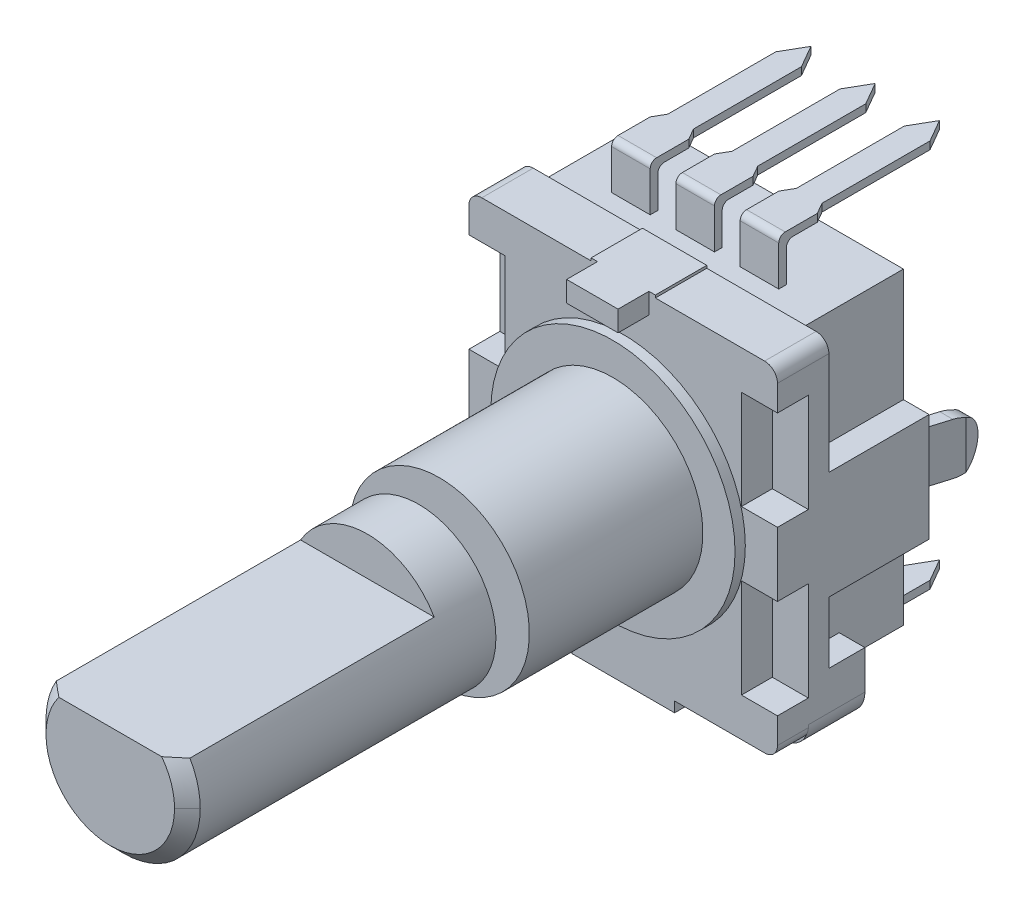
ISO-10303-21;
HEADER;
FILE_DESCRIPTION(('STEP AP214'),'2;1');
FILE_NAME('part.step','',(''),(''),'','','');
FILE_SCHEMA(('AUTOMOTIVE_DESIGN { 1 0 10303 214 1 1 1 1 }'));
ENDSEC;
DATA;
#1=APPLICATION_CONTEXT('core data for automotive mechanical design processes');
#2=APPLICATION_PROTOCOL_DEFINITION('international standard','automotive_design',2000,#1);
#3=PRODUCT_CONTEXT('',#1,'mechanical');
#4=PRODUCT('Part','Part','',(#3));
#5=PRODUCT_RELATED_PRODUCT_CATEGORY('part','',(#4));
#6=PRODUCT_DEFINITION_FORMATION('','',#4);
#7=PRODUCT_DEFINITION_CONTEXT('part definition',#1,'design');
#8=PRODUCT_DEFINITION('design','',#6,#7);
#9=PRODUCT_DEFINITION_SHAPE('','',#8);
#10=(LENGTH_UNIT() NAMED_UNIT(*) SI_UNIT(.MILLI.,.METRE.));
#11=(NAMED_UNIT(*) PLANE_ANGLE_UNIT() SI_UNIT($,.RADIAN.));
#12=(NAMED_UNIT(*) SI_UNIT($,.STERADIAN.) SOLID_ANGLE_UNIT());
#13=UNCERTAINTY_MEASURE_WITH_UNIT(LENGTH_MEASURE(1.E-05),#10,'distance_accuracy_value','');
#14=(GEOMETRIC_REPRESENTATION_CONTEXT(3) GLOBAL_UNCERTAINTY_ASSIGNED_CONTEXT((#13)) GLOBAL_UNIT_ASSIGNED_CONTEXT((#10,
#11,#12)) REPRESENTATION_CONTEXT('',''));
#15=CARTESIAN_POINT('',(0.,0.,0.));
#16=DIRECTION('',(0.,0.,1.));
#17=DIRECTION('',(1.,0.,0.));
#18=AXIS2_PLACEMENT_3D('',#15,#16,#17);
#19=CARTESIAN_POINT('',(0.,0.,12.));
#20=DIRECTION('',(0.,0.,1.));
#21=DIRECTION('',(1.,0.,0.));
#22=AXIS2_PLACEMENT_3D('',#19,#20,#21);
#23=PLANE('',#22);
#24=CARTESIAN_POINT('',(-3.98480438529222E-13,1.01548399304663E-13,11.9999999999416));
#25=DIRECTION('',(7.98261919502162E-13,-2.03540887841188E-13,-1.));
#26=DIRECTION('',(-1.,0.,-7.98261919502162E-13));
#27=AXIS2_PLACEMENT_3D('',#24,#25,#26);
#28=CIRCLE('',#27,2.50000000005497);
#29=CARTESIAN_POINT('',(2.00000000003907,1.5,11.9999999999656));
#30=VERTEX_POINT('',#29);
#31=CARTESIAN_POINT('',(2.50000000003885,0.,11.99999999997));
#32=VERTEX_POINT('',#31);
#33=EDGE_CURVE('E18',#30,#32,#28,.T.);
#34=ORIENTED_EDGE('',*,*,#33,.F.);
#35=DIRECTION('',(1.,0.,0.));
#36=VECTOR('',#35,1.);
#37=CARTESIAN_POINT('',(0.,1.5,12.));
#38=LINE('',#37,#36);
#39=CARTESIAN_POINT('',(-1.99999999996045,1.5,12.0000000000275));
#40=VERTEX_POINT('',#39);
#41=EDGE_CURVE('E755',#40,#30,#38,.T.);
#42=ORIENTED_EDGE('',*,*,#41,.F.);
#43=CARTESIAN_POINT('',(-3.98480438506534E-13,1.01548399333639E-13,12.0000000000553));
#44=DIRECTION('',(7.98261919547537E-13,-2.03540887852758E-13,-1.));
#45=DIRECTION('',(-1.,0.,-7.98261919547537E-13));
#46=AXIS2_PLACEMENT_3D('',#43,#44,#45);
#47=CIRCLE('',#46,2.49999999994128);
#48=CARTESIAN_POINT('',(-2.49999999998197,-6.83318722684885E-08,12.000000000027));
#49=VERTEX_POINT('',#48);
#50=EDGE_CURVE('E761',#49,#40,#47,.T.);
#51=ORIENTED_EDGE('',*,*,#50,.F.);
#52=CARTESIAN_POINT('',(4.35162941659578E-13,0.,11.9999999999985));
#53=DIRECTION('',(-8.70759564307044E-13,1.44830133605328E-13,-1.));
#54=DIRECTION('',(-1.,0.,8.70759564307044E-13));
#55=AXIS2_PLACEMENT_3D('',#52,#53,#54);
#56=CIRCLE('',#55,2.5000000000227);
#57=EDGE_CURVE('E758',#32,#49,#56,.T.);
#58=ORIENTED_EDGE('',*,*,#57,.F.);
#59=EDGE_LOOP('',(#34,#42,#51,#58));
#60=FACE_BOUND('',#59,.T.);
#61=ADVANCED_FACE('F15',(#60),#23,.T.);
#62=CARTESIAN_POINT('',(0.,0.,11.4999999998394));
#63=DIRECTION('',(7.98261919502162E-13,-2.03540887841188E-13,-1.));
#64=DIRECTION('',(-1.,0.,-7.98261919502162E-13));
#65=AXIS2_PLACEMENT_3D('',#62,#63,#64);
#66=CONICAL_SURFACE('',#65,3.00000000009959,0.785398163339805);
#67=CARTESIAN_POINT('',(3.00000000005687,0.,11.5000000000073));
#68=CARTESIAN_POINT('',(2.97916666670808,-5.50373967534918E-11,11.520833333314));
#69=CARTESIAN_POINT('',(2.95833333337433,-5.36435641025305E-11,11.5416666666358));
#70=CARTESIAN_POINT('',(2.91666666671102,-2.44518896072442E-11,11.5833333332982));
#71=CARTESIAN_POINT('',(2.89583333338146,3.34595224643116E-12,11.6041666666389));
#72=CARTESIAN_POINT('',(2.85416666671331,-1.11102819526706E-12,11.6458333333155));
#73=CARTESIAN_POINT('',(2.83333333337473,-3.33658504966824E-11,11.6666666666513));
#74=CARTESIAN_POINT('',(2.79166666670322,-4.32401349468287E-11,11.7083333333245));
#75=CARTESIAN_POINT('',(2.77083333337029,-2.08595971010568E-11,11.7291666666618));
#76=CARTESIAN_POINT('',(2.72916666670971,2.38393593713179E-11,11.7708333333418));
#77=CARTESIAN_POINT('',(2.70833333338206,4.61577779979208E-11,11.7916666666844));
#78=CARTESIAN_POINT('',(2.66666666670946,3.60347664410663E-11,11.8333333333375));
#79=CARTESIAN_POINT('',(2.6458333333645,3.59333627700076E-12,11.8541666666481));
#80=CARTESIAN_POINT('',(2.60416666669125,-1.36059797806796E-12,11.8958333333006));
#81=CARTESIAN_POINT('',(2.58333333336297,2.61268979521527E-11,11.9166666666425));
#82=CARTESIAN_POINT('',(2.54166666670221,5.45735587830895E-11,11.9583333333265));
#83=CARTESIAN_POINT('',(2.52083333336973,5.55327236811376E-11,11.9791666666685));
#84=CARTESIAN_POINT('',(2.50000000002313,0.,11.9999999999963));
#85=B_SPLINE_CURVE_WITH_KNOTS('',3,(#67,#68,#69,#70,#71,#72,#73,#74,#75,#76,#77,#78,#79,#80,#81,
#82,#83,#84),.UNSPECIFIED.,.F.,.F.,(4,2,2,2,2,2,2,2,4),(0.,0.0883883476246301,0.176776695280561,
0.265165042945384,0.353553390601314,0.441941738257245,0.530330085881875,0.618718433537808,
0.70710678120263),.UNSPECIFIED.);
#86=CARTESIAN_POINT('',(3.00000000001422,0.,11.5000000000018));
#87=VERTEX_POINT('',#86);
#88=EDGE_CURVE('E1013',#87,#32,#85,.T.);
#89=ORIENTED_EDGE('',*,*,#88,.F.);
#90=CARTESIAN_POINT('',(0.,0.,11.5));
#91=DIRECTION('',(0.,0.,1.));
#92=DIRECTION('',(1.,0.,0.));
#93=AXIS2_PLACEMENT_3D('',#90,#91,#92);
#94=CIRCLE('',#93,3.);
#95=CARTESIAN_POINT('',(2.59807621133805,1.5,11.4999999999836));
#96=VERTEX_POINT('',#95);
#97=EDGE_CURVE('E766',#96,#87,#94,.F.);
#98=ORIENTED_EDGE('',*,*,#97,.F.);
#99=CARTESIAN_POINT('',(2.00000000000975,1.5,11.9999999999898));
#100=CARTESIAN_POINT('',(2.05073096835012,1.5,11.9594091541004));
#101=CARTESIAN_POINT('',(2.10119559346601,1.5,11.9184877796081));
#102=CARTESIAN_POINT('',(2.20165596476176,1.5,11.8360826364));
#103=CARTESIAN_POINT('',(2.2516517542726,1.5,11.7945989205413));
#104=CARTESIAN_POINT('',(2.35124649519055,1.5,11.711161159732));
#105=CARTESIAN_POINT('',(2.40084545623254,1.5,11.6692071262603));
#106=CARTESIAN_POINT('',(2.49970382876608,1.5,11.584891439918));
#107=CARTESIAN_POINT('',(2.54896320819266,1.5,11.5425297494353));
#108=CARTESIAN_POINT('',(2.59807621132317,1.5,11.499999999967));
#109=B_SPLINE_CURVE_WITH_KNOTS('',3,(#99,#100,#101,#102,#103,#104,#105,#106,#107,#108),
.UNSPECIFIED.,.F.,.F.,(4,2,2,2,4),(0.,0.194909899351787,0.389801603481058,0.584688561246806,
0.779593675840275),.UNSPECIFIED.);
#110=EDGE_CURVE('E763',#30,#96,#109,.T.);
#111=ORIENTED_EDGE('',*,*,#110,.F.);
#112=ORIENTED_EDGE('',*,*,#33,.T.);
#113=EDGE_LOOP('',(#89,#98,#111,#112));
#114=FACE_BOUND('',#113,.T.);
#115=ADVANCED_FACE('F764',(#114),#66,.T.);
#116=CARTESIAN_POINT('',(0.,0.,11.5000000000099));
#117=DIRECTION('',(7.98261919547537E-13,-2.03540887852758E-13,-1.));
#118=DIRECTION('',(-1.,0.,-7.98261919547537E-13));
#119=AXIS2_PLACEMENT_3D('',#116,#117,#118);
#120=CONICAL_SURFACE('',#119,2.99999999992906,0.785398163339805);
#121=CARTESIAN_POINT('',(-2.50000000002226,-6.83318718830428E-08,12.0000000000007));
#122=CARTESIAN_POINT('',(-2.52083333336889,-6.61096738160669E-08,11.9791666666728));
#123=CARTESIAN_POINT('',(-2.54166666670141,-6.37598058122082E-08,11.9583333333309));
#124=CARTESIAN_POINT('',(-2.58333333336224,-5.88911844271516E-08,11.916666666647));
#125=CARTESIAN_POINT('',(-2.60416666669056,-5.63724310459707E-08,11.8958333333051));
#126=CARTESIAN_POINT('',(-2.64583333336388,-5.12524934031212E-08,11.8541666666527));
#127=CARTESIAN_POINT('',(-2.66666666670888,-4.86513091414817E-08,11.8333333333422));
#128=CARTESIAN_POINT('',(-2.70833333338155,-4.3251823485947E-08,11.7916666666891));
#129=CARTESIAN_POINT('',(-2.72916666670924,-4.04535220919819E-08,11.7708333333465));
#130=CARTESIAN_POINT('',(-2.77083333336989,-3.47145012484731E-08,11.7291666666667));
#131=CARTESIAN_POINT('',(-2.79166666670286,-3.17737817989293E-08,11.7083333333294));
#132=CARTESIAN_POINT('',(-2.83333333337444,-2.58046183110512E-08,11.6666666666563));
#133=CARTESIAN_POINT('',(-2.85416666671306,-2.2776174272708E-08,11.6458333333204));
#134=CARTESIAN_POINT('',(-2.89583333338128,-1.65168761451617E-08,11.6041666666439));
#135=CARTESIAN_POINT('',(-2.91666666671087,-1.32860220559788E-08,11.5833333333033));
#136=CARTESIAN_POINT('',(-2.95833333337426,-6.70836120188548E-09,11.5416666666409));
#137=CARTESIAN_POINT('',(-2.97916666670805,-3.36155443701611E-09,11.5208333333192));
#138=CARTESIAN_POINT('',(-3.00000000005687,0.,11.5000000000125));
#139=B_SPLINE_CURVE_WITH_KNOTS('',3,(#121,#122,#123,#124,#125,#126,#127,#128,#129,#130,#131,
#132,#133,#134,#135,#136,#137,#138),.UNSPECIFIED.,.F.,.F.,(4,2,2,2,2,2,2,2,4),(0.,
0.0883883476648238,0.176776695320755,0.265165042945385,0.353553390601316,0.441941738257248,
0.530330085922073,0.618718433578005,0.707106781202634),.UNSPECIFIED.);
#140=CARTESIAN_POINT('',(-3.00000000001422,0.,11.5000000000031));
#141=VERTEX_POINT('',#140);
#142=EDGE_CURVE('E770',#49,#141,#139,.T.);
#143=ORIENTED_EDGE('',*,*,#142,.F.);
#144=ORIENTED_EDGE('',*,*,#50,.T.);
#145=CARTESIAN_POINT('',(-2.59807621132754,1.50000000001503,11.4999999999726));
#146=CARTESIAN_POINT('',(-2.5489632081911,1.50000000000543,11.5425297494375));
#147=CARTESIAN_POINT('',(-2.49970382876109,1.50000000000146,11.5848914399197));
#148=CARTESIAN_POINT('',(-2.4008454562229,1.49999999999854,11.6692071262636));
#149=CARTESIAN_POINT('',(-2.35124649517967,1.49999999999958,11.7111611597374));
#150=CARTESIAN_POINT('',(-2.25165175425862,1.50000000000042,11.7945989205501));
#151=CARTESIAN_POINT('',(-2.20165596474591,1.50000000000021,11.8360826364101));
#152=CARTESIAN_POINT('',(-2.1011955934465,1.49999999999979,11.9184877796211));
#153=CARTESIAN_POINT('',(-2.05073096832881,1.49999999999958,11.9594091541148));
#154=CARTESIAN_POINT('',(-1.999999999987,1.5,12.0000000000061));
#155=B_SPLINE_CURVE_WITH_KNOTS('',3,(#145,#146,#147,#148,#149,#150,#151,#152,#153,#154),
.UNSPECIFIED.,.F.,.F.,(4,2,2,2,4),(0.,0.194905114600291,0.389792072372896,0.584683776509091,
0.779593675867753),.UNSPECIFIED.);
#156=CARTESIAN_POINT('',(-2.59807621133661,1.50000000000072,11.4999999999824));
#157=VERTEX_POINT('',#156);
#158=EDGE_CURVE('E774',#157,#40,#155,.T.);
#159=ORIENTED_EDGE('',*,*,#158,.F.);
#160=CARTESIAN_POINT('',(0.,0.,11.5));
#161=DIRECTION('',(0.,0.,1.));
#162=DIRECTION('',(1.,0.,0.));
#163=AXIS2_PLACEMENT_3D('',#160,#161,#162);
#164=CIRCLE('',#163,3.);
#165=EDGE_CURVE('E792',#141,#157,#164,.F.);
#166=ORIENTED_EDGE('',*,*,#165,.F.);
#167=EDGE_LOOP('',(#143,#144,#159,#166));
#168=FACE_BOUND('',#167,.T.);
#169=ADVANCED_FACE('F1029',(#168),#120,.T.);
#170=CARTESIAN_POINT('',(0.,16.6200466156,2.));
#171=DIRECTION('',(0.,0.,-1.));
#172=DIRECTION('',(-1.,0.,0.));
#173=AXIS2_PLACEMENT_3D('',#170,#171,#172);
#174=PLANE('',#173);
#175=DIRECTION('',(1.,0.,0.));
#176=VECTOR('',#175,1.);
#177=CARTESIAN_POINT('',(0.,1.5,2.));
#178=LINE('',#177,#176);
#179=CARTESIAN_POINT('',(2.5980762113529,1.50000000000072,2.));
#180=VERTEX_POINT('',#179);
#181=CARTESIAN_POINT('',(-2.5980762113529,1.50000000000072,2.));
#182=VERTEX_POINT('',#181);
#183=EDGE_CURVE('E776',#180,#182,#178,.F.);
#184=ORIENTED_EDGE('',*,*,#183,.F.);
#185=CARTESIAN_POINT('',(0.,0.,2.));
#186=DIRECTION('',(0.,0.,1.));
#187=DIRECTION('',(1.,0.,0.));
#188=AXIS2_PLACEMENT_3D('',#185,#186,#187);
#189=CIRCLE('',#188,3.);
#190=EDGE_CURVE('E787',#182,#180,#189,.F.);
#191=ORIENTED_EDGE('',*,*,#190,.F.);
#192=EDGE_LOOP('',(#184,#191));
#193=FACE_BOUND('',#192,.T.);
#194=ADVANCED_FACE('F1032',(#193),#174,.F.);
#195=CARTESIAN_POINT('',(0.,1.5,16.9777884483));
#196=DIRECTION('',(0.,1.,0.));
#197=DIRECTION('',(0.,0.,1.));
#198=AXIS2_PLACEMENT_3D('',#195,#196,#197);
#199=PLANE('',#198);
#200=ORIENTED_EDGE('',*,*,#110,.T.);
#201=DIRECTION('',(0.,0.,1.));
#202=VECTOR('',#201,1.);
#203=CARTESIAN_POINT('',(2.59807621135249,1.50000000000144,6.));
#204=LINE('',#203,#202);
#205=EDGE_CURVE('E784',#180,#96,#204,.T.);
#206=ORIENTED_EDGE('',*,*,#205,.F.);
#207=ORIENTED_EDGE('',*,*,#183,.T.);
#208=DIRECTION('',(0.,0.,1.));
#209=VECTOR('',#208,1.);
#210=CARTESIAN_POINT('',(-2.59807621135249,1.50000000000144,6.));
#211=LINE('',#210,#209);
#212=EDGE_CURVE('E789',#157,#182,#211,.F.);
#213=ORIENTED_EDGE('',*,*,#212,.F.);
#214=ORIENTED_EDGE('',*,*,#158,.T.);
#215=ORIENTED_EDGE('',*,*,#41,.T.);
#216=EDGE_LOOP('',(#200,#206,#207,#213,#214,#215));
#217=FACE_BOUND('',#216,.T.);
#218=ADVANCED_FACE('F772',(#217),#199,.T.);
#219=CARTESIAN_POINT('',(0.,0.,11.5000000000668));
#220=DIRECTION('',(-8.70759564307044E-13,1.44830133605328E-13,-1.));
#221=DIRECTION('',(-1.,0.,8.70759564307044E-13));
#222=AXIS2_PLACEMENT_3D('',#219,#220,#221);
#223=CONICAL_SURFACE('',#222,2.99999999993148,0.785398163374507);
#224=ORIENTED_EDGE('',*,*,#88,.T.);
#225=ORIENTED_EDGE('',*,*,#57,.T.);
#226=ORIENTED_EDGE('',*,*,#142,.T.);
#227=CARTESIAN_POINT('',(0.,0.,11.5));
#228=DIRECTION('',(0.,0.,1.));
#229=DIRECTION('',(1.,0.,0.));
#230=AXIS2_PLACEMENT_3D('',#227,#228,#229);
#231=CIRCLE('',#230,3.);
#232=EDGE_CURVE('E786',#87,#141,#231,.F.);
#233=ORIENTED_EDGE('',*,*,#232,.F.);
#234=EDGE_LOOP('',(#224,#225,#226,#233));
#235=FACE_BOUND('',#234,.T.);
#236=ADVANCED_FACE('F1040',(#235),#223,.T.);
#237=CARTESIAN_POINT('',(0.,0.,6.));
#238=DIRECTION('',(0.,0.,1.));
#239=DIRECTION('',(1.,0.,0.));
#240=AXIS2_PLACEMENT_3D('',#237,#238,#239);
#241=CYLINDRICAL_SURFACE('',#240,3.);
#242=CARTESIAN_POINT('',(0.,0.,0.));
#243=DIRECTION('',(0.,0.,1.));
#244=DIRECTION('',(1.,0.,0.));
#245=AXIS2_PLACEMENT_3D('',#242,#243,#244);
#246=CIRCLE('',#245,3.);
#247=CARTESIAN_POINT('',(3.,0.,0.));
#248=VERTEX_POINT('',#247);
#249=EDGE_CURVE('E1008',#248,#248,#246,.T.);
#250=ORIENTED_EDGE('',*,*,#249,.T.);
#251=EDGE_LOOP('',(#250));
#252=FACE_BOUND('',#251,.T.);
#253=ORIENTED_EDGE('',*,*,#232,.T.);
#254=ORIENTED_EDGE('',*,*,#165,.T.);
#255=ORIENTED_EDGE('',*,*,#212,.T.);
#256=ORIENTED_EDGE('',*,*,#190,.T.);
#257=ORIENTED_EDGE('',*,*,#205,.T.);
#258=ORIENTED_EDGE('',*,*,#97,.T.);
#259=EDGE_LOOP('',(#253,#254,#255,#256,#257,#258));
#260=FACE_BOUND('',#259,.T.);
#261=ADVANCED_FACE('F1643',(#252,#260),#241,.T.);
#262=CARTESIAN_POINT('',(0.,0.,0.));
#263=DIRECTION('',(0.,0.,1.));
#264=DIRECTION('',(1.,0.,0.));
#265=AXIS2_PLACEMENT_3D('',#262,#263,#264);
#266=PLANE('',#265);
#267=CARTESIAN_POINT('',(0.,0.,0.));
#268=DIRECTION('',(0.,0.,-1.));
#269=DIRECTION('',(-1.,0.,0.));
#270=AXIS2_PLACEMENT_3D('',#267,#268,#269);
#271=CIRCLE('',#270,1.5);
#272=CARTESIAN_POINT('',(-1.5,0.,0.));
#273=VERTEX_POINT('',#272);
#274=EDGE_CURVE('E1005',#273,#273,#271,.T.);
#275=ORIENTED_EDGE('',*,*,#274,.F.);
#276=EDGE_LOOP('',(#275));
#277=FACE_BOUND('',#276,.T.);
#278=ORIENTED_EDGE('',*,*,#249,.F.);
#279=EDGE_LOOP('',(#278));
#280=FACE_BOUND('',#279,.T.);
#281=ADVANCED_FACE('F1639',(#277,#280),#266,.F.);
#282=CARTESIAN_POINT('',(0.,0.,-0.4));
#283=DIRECTION('',(0.,0.,-1.));
#284=DIRECTION('',(-1.,0.,0.));
#285=AXIS2_PLACEMENT_3D('',#282,#283,#284);
#286=CYLINDRICAL_SURFACE('',#285,1.5);
#287=ORIENTED_EDGE('',*,*,#274,.T.);
#288=EDGE_LOOP('',(#287));
#289=FACE_BOUND('',#288,.T.);
#290=CARTESIAN_POINT('',(0.,0.,-0.8));
#291=DIRECTION('',(0.,0.,-1.));
#292=DIRECTION('',(-1.,0.,0.));
#293=AXIS2_PLACEMENT_3D('',#290,#291,#292);
#294=CIRCLE('',#293,1.5);
#295=CARTESIAN_POINT('',(-1.5,0.,-0.8));
#296=VERTEX_POINT('',#295);
#297=EDGE_CURVE('E1002',#296,#296,#294,.F.);
#298=ORIENTED_EDGE('',*,*,#297,.T.);
#299=EDGE_LOOP('',(#298));
#300=FACE_BOUND('',#299,.T.);
#301=ADVANCED_FACE('F1635',(#289,#300),#286,.T.);
#302=CARTESIAN_POINT('',(0.,0.,-0.8));
#303=DIRECTION('',(0.,0.,-1.));
#304=DIRECTION('',(-1.,0.,0.));
#305=AXIS2_PLACEMENT_3D('',#302,#303,#304);
#306=PLANE('',#305);
#307=ORIENTED_EDGE('',*,*,#297,.F.);
#308=EDGE_LOOP('',(#307));
#309=FACE_BOUND('',#308,.T.);
#310=CARTESIAN_POINT('',(0.,0.,-0.8));
#311=DIRECTION('',(0.,0.,-1.));
#312=DIRECTION('',(-1.,0.,0.));
#313=AXIS2_PLACEMENT_3D('',#310,#311,#312);
#314=CIRCLE('',#313,3.5);
#315=CARTESIAN_POINT('',(-3.5,0.,-0.8));
#316=VERTEX_POINT('',#315);
#317=EDGE_CURVE('E998',#316,#316,#314,.T.);
#318=ORIENTED_EDGE('',*,*,#317,.F.);
#319=EDGE_LOOP('',(#318));
#320=FACE_BOUND('',#319,.T.);
#321=ADVANCED_FACE('F1631',(#309,#320),#306,.F.);
#322=CARTESIAN_POINT('',(0.,0.,-4.05));
#323=DIRECTION('',(0.,0.,-1.));
#324=DIRECTION('',(-1.,0.,0.));
#325=AXIS2_PLACEMENT_3D('',#322,#323,#324);
#326=CYLINDRICAL_SURFACE('',#325,3.5);
#327=ORIENTED_EDGE('',*,*,#317,.T.);
#328=EDGE_LOOP('',(#327));
#329=FACE_BOUND('',#328,.T.);
#330=CARTESIAN_POINT('',(0.,0.,-7.55));
#331=DIRECTION('',(0.,0.,-1.));
#332=DIRECTION('',(-1.,0.,0.));
#333=AXIS2_PLACEMENT_3D('',#330,#331,#332);
#334=CIRCLE('',#333,3.5);
#335=CARTESIAN_POINT('',(-3.5,0.,-7.55));
#336=VERTEX_POINT('',#335);
#337=EDGE_CURVE('E993',#336,#336,#334,.F.);
#338=ORIENTED_EDGE('',*,*,#337,.T.);
#339=EDGE_LOOP('',(#338));
#340=FACE_BOUND('',#339,.T.);
#341=ADVANCED_FACE('F1627',(#329,#340),#326,.T.);
#342=CARTESIAN_POINT('',(0.,8.3,0.));
#343=DIRECTION('',(0.,1.,0.));
#344=DIRECTION('',(0.,0.,1.));
#345=AXIS2_PLACEMENT_3D('',#342,#343,#344);
#346=PLANE('',#345);
#347=DIRECTION('',(0.,0.,1.));
#348=VECTOR('',#347,1.);
#349=CARTESIAN_POINT('',(1.75,8.3,0.));
#350=LINE('',#349,#348);
#351=CARTESIAN_POINT('',(1.75,8.3,-12.25));
#352=VERTEX_POINT('',#351);
#353=CARTESIAN_POINT('',(1.75,8.3,-11.));
#354=VERTEX_POINT('',#353);
#355=EDGE_CURVE('E2665',#352,#354,#350,.T.);
#356=ORIENTED_EDGE('',*,*,#355,.T.);
#357=DIRECTION('',(1.,0.,0.));
#358=VECTOR('',#357,1.);
#359=CARTESIAN_POINT('',(0.,8.3,-11.));
#360=LINE('',#359,#358);
#361=CARTESIAN_POINT('',(3.25,8.3,-11.));
#362=VERTEX_POINT('',#361);
#363=EDGE_CURVE('E2661',#354,#362,#360,.T.);
#364=ORIENTED_EDGE('',*,*,#363,.T.);
#365=DIRECTION('',(0.,0.,1.));
#366=VECTOR('',#365,1.);
#367=CARTESIAN_POINT('',(3.25,8.3,0.));
#368=LINE('',#367,#366);
#369=CARTESIAN_POINT('',(3.25,8.3,-12.25));
#370=VERTEX_POINT('',#369);
#371=EDGE_CURVE('E1001',#362,#370,#368,.F.);
#372=ORIENTED_EDGE('',*,*,#371,.T.);
#373=DIRECTION('',(-0.499999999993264,0.,-0.866025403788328));
#374=VECTOR('',#373,1.);
#375=CARTESIAN_POINT('',(3.25,8.3,-12.25));
#376=LINE('',#375,#374);
#377=CARTESIAN_POINT('',(2.99999999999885,8.3,-12.6830127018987));
#378=VERTEX_POINT('',#377);
#379=EDGE_CURVE('E2660',#370,#378,#376,.T.);
#380=ORIENTED_EDGE('',*,*,#379,.T.);
#381=DIRECTION('',(0.,0.,-1.));
#382=VECTOR('',#381,1.);
#383=CARTESIAN_POINT('',(3.,8.3,-12.6830127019));
#384=LINE('',#383,#382);
#385=CARTESIAN_POINT('',(3.,8.3,-16.8839745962));
#386=VERTEX_POINT('',#385);
#387=EDGE_CURVE('E2788',#386,#378,#384,.F.);
#388=ORIENTED_EDGE('',*,*,#387,.F.);
#389=DIRECTION('',(-0.50000000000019,0.,-0.866025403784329));
#390=VECTOR('',#389,1.);
#391=CARTESIAN_POINT('',(3.,8.3,-16.8839745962));
#392=LINE('',#391,#390);
#393=CARTESIAN_POINT('',(2.50000000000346,8.3,-17.749999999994));
#394=VERTEX_POINT('',#393);
#395=EDGE_CURVE('E2706',#394,#386,#392,.F.);
#396=ORIENTED_EDGE('',*,*,#395,.F.);
#397=DIRECTION('',(0.50000000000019,0.,-0.866025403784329));
#398=VECTOR('',#397,1.);
#399=CARTESIAN_POINT('',(2.,8.3,-16.8839745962));
#400=LINE('',#399,#398);
#401=CARTESIAN_POINT('',(2.,8.3,-16.8839745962));
#402=VERTEX_POINT('',#401);
#403=EDGE_CURVE('E2709',#394,#402,#400,.F.);
#404=ORIENTED_EDGE('',*,*,#403,.T.);
#405=DIRECTION('',(0.,0.,1.));
#406=VECTOR('',#405,1.);
#407=CARTESIAN_POINT('',(2.,8.3,-7.95));
#408=LINE('',#407,#406);
#409=CARTESIAN_POINT('',(2.00000000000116,8.3,-12.6830127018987));
#410=VERTEX_POINT('',#409);
#411=EDGE_CURVE('E2802',#410,#402,#408,.F.);
#412=ORIENTED_EDGE('',*,*,#411,.F.);
#413=DIRECTION('',(-0.499999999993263,0.,0.866025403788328));
#414=VECTOR('',#413,1.);
#415=CARTESIAN_POINT('',(2.,8.3,-12.6830127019));
#416=LINE('',#415,#414);
#417=EDGE_CURVE('E2670',#410,#352,#416,.T.);
#418=ORIENTED_EDGE('',*,*,#417,.T.);
#419=EDGE_LOOP('',(#356,#364,#372,#380,#388,#396,#404,#412,#418));
#420=FACE_BOUND('',#419,.T.);
#421=ADVANCED_FACE('F1623',(#420),#346,.T.);
#422=CARTESIAN_POINT('',(0.,8.3,0.));
#423=DIRECTION('',(0.,1.,0.));
#424=DIRECTION('',(0.,0.,1.));
#425=AXIS2_PLACEMENT_3D('',#422,#423,#424);
#426=PLANE('',#425);
#427=DIRECTION('',(0.,0.,1.));
#428=VECTOR('',#427,1.);
#429=CARTESIAN_POINT('',(-0.75,8.3,0.));
#430=LINE('',#429,#428);
#431=CARTESIAN_POINT('',(-0.75,8.3,-12.25));
#432=VERTEX_POINT('',#431);
#433=CARTESIAN_POINT('',(-0.75,8.3,-11.));
#434=VERTEX_POINT('',#433);
#435=EDGE_CURVE('E2680',#432,#434,#430,.T.);
#436=ORIENTED_EDGE('',*,*,#435,.T.);
#437=DIRECTION('',(1.,0.,0.));
#438=VECTOR('',#437,1.);
#439=CARTESIAN_POINT('',(0.,8.3,-11.));
#440=LINE('',#439,#438);
#441=CARTESIAN_POINT('',(0.75,8.3,-11.));
#442=VERTEX_POINT('',#441);
#443=EDGE_CURVE('E2676',#434,#442,#440,.T.);
#444=ORIENTED_EDGE('',*,*,#443,.T.);
#445=DIRECTION('',(0.,0.,1.));
#446=VECTOR('',#445,1.);
#447=CARTESIAN_POINT('',(0.75,8.3,0.));
#448=LINE('',#447,#446);
#449=CARTESIAN_POINT('',(0.749999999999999,8.3,-12.25));
#450=VERTEX_POINT('',#449);
#451=EDGE_CURVE('E2664',#442,#450,#448,.F.);
#452=ORIENTED_EDGE('',*,*,#451,.T.);
#453=DIRECTION('',(-0.499999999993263,0.,-0.866025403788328));
#454=VECTOR('',#453,1.);
#455=CARTESIAN_POINT('',(0.75,8.3,-12.25));
#456=LINE('',#455,#454);
#457=CARTESIAN_POINT('',(0.499999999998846,8.3,-12.6830127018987));
#458=VERTEX_POINT('',#457);
#459=EDGE_CURVE('E2675',#450,#458,#456,.T.);
#460=ORIENTED_EDGE('',*,*,#459,.T.);
#461=DIRECTION('',(0.,0.,-1.));
#462=VECTOR('',#461,1.);
#463=CARTESIAN_POINT('',(0.5,8.3,-12.6830127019));
#464=LINE('',#463,#462);
#465=CARTESIAN_POINT('',(0.5,8.3,-16.8839745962));
#466=VERTEX_POINT('',#465);
#467=EDGE_CURVE('E2805',#466,#458,#464,.F.);
#468=ORIENTED_EDGE('',*,*,#467,.F.);
#469=DIRECTION('',(-0.50000000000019,0.,-0.866025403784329));
#470=VECTOR('',#469,1.);
#471=CARTESIAN_POINT('',(0.5,8.3,-16.8839745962));
#472=LINE('',#471,#470);
#473=CARTESIAN_POINT('',(3.46395366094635E-12,8.3,-17.749999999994));
#474=VERTEX_POINT('',#473);
#475=EDGE_CURVE('E2724',#474,#466,#472,.F.);
#476=ORIENTED_EDGE('',*,*,#475,.F.);
#477=DIRECTION('',(0.50000000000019,0.,-0.866025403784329));
#478=VECTOR('',#477,1.);
#479=CARTESIAN_POINT('',(-0.5,8.3,-16.8839745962));
#480=LINE('',#479,#478);
#481=CARTESIAN_POINT('',(-0.5,8.3,-16.8839745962));
#482=VERTEX_POINT('',#481);
#483=EDGE_CURVE('E2727',#474,#482,#480,.F.);
#484=ORIENTED_EDGE('',*,*,#483,.T.);
#485=DIRECTION('',(0.,0.,-1.));
#486=VECTOR('',#485,1.);
#487=CARTESIAN_POINT('',(-0.5,8.3,-12.6830127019));
#488=LINE('',#487,#486);
#489=CARTESIAN_POINT('',(-0.499999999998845,8.3,-12.6830127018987));
#490=VERTEX_POINT('',#489);
#491=EDGE_CURVE('E2853',#482,#490,#488,.F.);
#492=ORIENTED_EDGE('',*,*,#491,.T.);
#493=DIRECTION('',(-0.499999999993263,0.,0.866025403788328));
#494=VECTOR('',#493,1.);
#495=CARTESIAN_POINT('',(-0.5,8.3,-12.6830127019));
#496=LINE('',#495,#494);
#497=EDGE_CURVE('E2685',#490,#432,#496,.T.);
#498=ORIENTED_EDGE('',*,*,#497,.T.);
#499=EDGE_LOOP('',(#436,#444,#452,#460,#468,#476,#484,#492,#498));
#500=FACE_BOUND('',#499,.T.);
#501=ADVANCED_FACE('F1619',(#500),#426,.T.);
#502=CARTESIAN_POINT('',(0.,8.3,0.));
#503=DIRECTION('',(0.,1.,0.));
#504=DIRECTION('',(0.,0.,1.));
#505=AXIS2_PLACEMENT_3D('',#502,#503,#504);
#506=PLANE('',#505);
#507=DIRECTION('',(0.,0.,1.));
#508=VECTOR('',#507,1.);
#509=CARTESIAN_POINT('',(-3.25,8.3,0.));
#510=LINE('',#509,#508);
#511=CARTESIAN_POINT('',(-3.25,8.3,-12.25));
#512=VERTEX_POINT('',#511);
#513=CARTESIAN_POINT('',(-3.25,8.3,-11.));
#514=VERTEX_POINT('',#513);
#515=EDGE_CURVE('E2695',#512,#514,#510,.T.);
#516=ORIENTED_EDGE('',*,*,#515,.T.);
#517=DIRECTION('',(1.,0.,0.));
#518=VECTOR('',#517,1.);
#519=CARTESIAN_POINT('',(0.,8.3,-11.));
#520=LINE('',#519,#518);
#521=CARTESIAN_POINT('',(-1.75,8.3,-11.));
#522=VERTEX_POINT('',#521);
#523=EDGE_CURVE('E2691',#514,#522,#520,.T.);
#524=ORIENTED_EDGE('',*,*,#523,.T.);
#525=DIRECTION('',(0.,0.,1.));
#526=VECTOR('',#525,1.);
#527=CARTESIAN_POINT('',(-1.75,8.3,0.));
#528=LINE('',#527,#526);
#529=CARTESIAN_POINT('',(-1.75,8.3,-12.25));
#530=VERTEX_POINT('',#529);
#531=EDGE_CURVE('E2679',#522,#530,#528,.F.);
#532=ORIENTED_EDGE('',*,*,#531,.T.);
#533=DIRECTION('',(-0.499999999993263,0.,-0.866025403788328));
#534=VECTOR('',#533,1.);
#535=CARTESIAN_POINT('',(-1.75,8.3,-12.25));
#536=LINE('',#535,#534);
#537=CARTESIAN_POINT('',(-2.00000000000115,8.3,-12.6830127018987));
#538=VERTEX_POINT('',#537);
#539=EDGE_CURVE('E2690',#530,#538,#536,.T.);
#540=ORIENTED_EDGE('',*,*,#539,.T.);
#541=DIRECTION('',(0.,0.,1.));
#542=VECTOR('',#541,1.);
#543=CARTESIAN_POINT('',(-2.,8.3,-7.95));
#544=LINE('',#543,#542);
#545=CARTESIAN_POINT('',(-2.,8.3,-16.8839745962));
#546=VERTEX_POINT('',#545);
#547=EDGE_CURVE('E2893',#538,#546,#544,.F.);
#548=ORIENTED_EDGE('',*,*,#547,.T.);
#549=DIRECTION('',(-0.50000000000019,0.,-0.866025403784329));
#550=VECTOR('',#549,1.);
#551=CARTESIAN_POINT('',(-2.,8.3,-16.8839745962));
#552=LINE('',#551,#550);
#553=CARTESIAN_POINT('',(-2.49999999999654,8.3,-17.749999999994));
#554=VERTEX_POINT('',#553);
#555=EDGE_CURVE('E2742',#554,#546,#552,.F.);
#556=ORIENTED_EDGE('',*,*,#555,.F.);
#557=DIRECTION('',(0.50000000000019,0.,-0.866025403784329));
#558=VECTOR('',#557,1.);
#559=CARTESIAN_POINT('',(-3.,8.3,-16.8839745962));
#560=LINE('',#559,#558);
#561=CARTESIAN_POINT('',(-3.,8.3,-16.8839745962));
#562=VERTEX_POINT('',#561);
#563=EDGE_CURVE('E2745',#554,#562,#560,.F.);
#564=ORIENTED_EDGE('',*,*,#563,.T.);
#565=DIRECTION('',(0.,0.,-1.));
#566=VECTOR('',#565,1.);
#567=CARTESIAN_POINT('',(-3.,8.3,-12.6830127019));
#568=LINE('',#567,#566);
#569=CARTESIAN_POINT('',(-2.99999999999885,8.3,-12.6830127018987));
#570=VERTEX_POINT('',#569);
#571=EDGE_CURVE('E2904',#562,#570,#568,.F.);
#572=ORIENTED_EDGE('',*,*,#571,.T.);
#573=DIRECTION('',(-0.499999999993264,0.,0.866025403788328));
#574=VECTOR('',#573,1.);
#575=CARTESIAN_POINT('',(-3.,8.3,-12.6830127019));
#576=LINE('',#575,#574);
#577=EDGE_CURVE('E2700',#570,#512,#576,.T.);
#578=ORIENTED_EDGE('',*,*,#577,.T.);
#579=EDGE_LOOP('',(#516,#524,#532,#540,#548,#556,#564,#572,#578));
#580=FACE_BOUND('',#579,.T.);
#581=ADVANCED_FACE('F1615',(#580),#506,.T.);
#582=CARTESIAN_POINT('',(0.,0.,-9.15));
#583=DIRECTION('',(0.,0.,-1.));
#584=DIRECTION('',(-1.,0.,0.));
#585=AXIS2_PLACEMENT_3D('',#582,#583,#584);
#586=PLANE('',#585);
#587=DIRECTION('',(1.,0.,0.));
#588=VECTOR('',#587,1.);
#589=CARTESIAN_POINT('',(2.,-6.59669589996,-9.15));
#590=LINE('',#589,#588);
#591=CARTESIAN_POINT('',(2.,-6.59669589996,-9.15));
#592=VERTEX_POINT('',#591);
#593=CARTESIAN_POINT('',(4.5,-6.59669589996,-9.15));
#594=VERTEX_POINT('',#593);
#595=EDGE_CURVE('E2960',#592,#594,#590,.T.);
#596=ORIENTED_EDGE('',*,*,#595,.T.);
#597=DIRECTION('',(0.,1.,0.));
#598=VECTOR('',#597,1.);
#599=CARTESIAN_POINT('',(4.5,0.,-9.15));
#600=LINE('',#599,#598);
#601=CARTESIAN_POINT('',(4.5,-6.6,-9.15));
#602=VERTEX_POINT('',#601);
#603=EDGE_CURVE('E997',#594,#602,#600,.F.);
#604=ORIENTED_EDGE('',*,*,#603,.T.);
#605=DIRECTION('',(1.,0.,0.));
#606=VECTOR('',#605,1.);
#607=CARTESIAN_POINT('',(-2.,-6.6,-9.15));
#608=LINE('',#607,#606);
#609=CARTESIAN_POINT('',(2.,-6.6,-9.15));
#610=VERTEX_POINT('',#609);
#611=EDGE_CURVE('E2768',#610,#602,#608,.T.);
#612=ORIENTED_EDGE('',*,*,#611,.F.);
#613=DIRECTION('',(0.,1.,0.));
#614=VECTOR('',#613,1.);
#615=CARTESIAN_POINT('',(2.,0.,-9.15));
#616=LINE('',#615,#614);
#617=EDGE_CURVE('E2694',#610,#592,#616,.T.);
#618=ORIENTED_EDGE('',*,*,#617,.T.);
#619=EDGE_LOOP('',(#596,#604,#612,#618));
#620=FACE_BOUND('',#619,.T.);
#621=ADVANCED_FACE('F1611',(#620),#586,.T.);
#622=CARTESIAN_POINT('',(0.,0.,-7.55));
#623=DIRECTION('',(0.,0.,-1.));
#624=DIRECTION('',(-1.,0.,0.));
#625=AXIS2_PLACEMENT_3D('',#622,#623,#624);
#626=PLANE('',#625);
#627=ORIENTED_EDGE('',*,*,#337,.F.);
#628=EDGE_LOOP('',(#627));
#629=FACE_BOUND('',#628,.T.);
#630=CARTESIAN_POINT('',(0.,0.,-7.55));
#631=DIRECTION('',(0.,0.,-1.));
#632=DIRECTION('',(-1.,0.,0.));
#633=AXIS2_PLACEMENT_3D('',#630,#631,#632);
#634=CIRCLE('',#633,4.75);
#635=CARTESIAN_POINT('',(-4.75,0.,-7.55));
#636=VERTEX_POINT('',#635);
#637=EDGE_CURVE('E988',#636,#636,#634,.T.);
#638=ORIENTED_EDGE('',*,*,#637,.F.);
#639=EDGE_LOOP('',(#638));
#640=FACE_BOUND('',#639,.T.);
#641=ADVANCED_FACE('F1607',(#629,#640),#626,.F.);
#642=CARTESIAN_POINT('',(0.,0.,-9.15));
#643=DIRECTION('',(0.,0.,-1.));
#644=DIRECTION('',(-1.,0.,0.));
#645=AXIS2_PLACEMENT_3D('',#642,#643,#644);
#646=PLANE('',#645);
#647=DIRECTION('',(1.,0.,0.));
#648=VECTOR('',#647,1.);
#649=CARTESIAN_POINT('',(2.,-6.59669589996,-9.15));
#650=LINE('',#649,#648);
#651=CARTESIAN_POINT('',(-4.5,-6.59669589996,-9.15));
#652=VERTEX_POINT('',#651);
#653=CARTESIAN_POINT('',(-2.,-6.59669589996,-9.15));
#654=VERTEX_POINT('',#653);
#655=EDGE_CURVE('E3094',#652,#654,#650,.T.);
#656=ORIENTED_EDGE('',*,*,#655,.T.);
#657=DIRECTION('',(0.,1.,0.));
#658=VECTOR('',#657,1.);
#659=CARTESIAN_POINT('',(-2.,0.,-9.15));
#660=LINE('',#659,#658);
#661=CARTESIAN_POINT('',(-2.,-6.6,-9.15));
#662=VERTEX_POINT('',#661);
#663=EDGE_CURVE('E2784',#654,#662,#660,.F.);
#664=ORIENTED_EDGE('',*,*,#663,.T.);
#665=DIRECTION('',(1.,0.,0.));
#666=VECTOR('',#665,1.);
#667=CARTESIAN_POINT('',(-2.,-6.6,-9.15));
#668=LINE('',#667,#666);
#669=CARTESIAN_POINT('',(-4.5,-6.6,-9.15));
#670=VERTEX_POINT('',#669);
#671=EDGE_CURVE('E2771',#670,#662,#668,.T.);
#672=ORIENTED_EDGE('',*,*,#671,.F.);
#673=DIRECTION('',(0.,1.,0.));
#674=VECTOR('',#673,1.);
#675=CARTESIAN_POINT('',(-4.5,0.,-9.15));
#676=LINE('',#675,#674);
#677=EDGE_CURVE('E996',#670,#652,#676,.T.);
#678=ORIENTED_EDGE('',*,*,#677,.T.);
#679=EDGE_LOOP('',(#656,#664,#672,#678));
#680=FACE_BOUND('',#679,.T.);
#681=ADVANCED_FACE('F1603',(#680),#646,.T.);
#682=CARTESIAN_POINT('',(3.,8.,-12.6830127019));
#683=DIRECTION('',(1.,0.,0.));
#684=DIRECTION('',(0.,0.,-1.));
#685=AXIS2_PLACEMENT_3D('',#682,#683,#684);
#686=PLANE('',#685);
#687=DIRECTION('',(0.,1.,0.));
#688=VECTOR('',#687,1.);
#689=CARTESIAN_POINT('',(3.,8.,-16.8839745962));
#690=LINE('',#689,#688);
#691=CARTESIAN_POINT('',(3.,8.,-16.8839745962));
#692=VERTEX_POINT('',#691);
#693=EDGE_CURVE('E2710',#386,#692,#690,.F.);
#694=ORIENTED_EDGE('',*,*,#693,.F.);
#695=ORIENTED_EDGE('',*,*,#387,.T.);
#696=DIRECTION('',(0.,1.,0.));
#697=VECTOR('',#696,1.);
#698=CARTESIAN_POINT('',(2.99999999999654,8.,-12.683012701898));
#699=LINE('',#698,#697);
#700=CARTESIAN_POINT('',(2.99999999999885,8.,-12.6830127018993));
#701=VERTEX_POINT('',#700);
#702=EDGE_CURVE('E2813',#701,#378,#699,.T.);
#703=ORIENTED_EDGE('',*,*,#702,.F.);
#704=DIRECTION('',(0.,0.,1.));
#705=VECTOR('',#704,1.);
#706=CARTESIAN_POINT('',(3.,8.,0.));
#707=LINE('',#706,#705);
#708=EDGE_CURVE('E2820',#701,#692,#707,.F.);
#709=ORIENTED_EDGE('',*,*,#708,.T.);
#710=EDGE_LOOP('',(#694,#695,#703,#709));
#711=FACE_BOUND('',#710,.T.);
#712=ADVANCED_FACE('F1599',(#711),#686,.T.);
#713=CARTESIAN_POINT('',(3.,8.,-16.8839745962));
#714=DIRECTION('',(0.866025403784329,0.,-0.50000000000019));
#715=DIRECTION('',(-0.50000000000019,0.,-0.866025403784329));
#716=AXIS2_PLACEMENT_3D('',#713,#714,#715);
#717=PLANE('',#716);
#718=DIRECTION('',(0.,1.,0.));
#719=VECTOR('',#718,1.);
#720=CARTESIAN_POINT('',(2.50000000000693,8.,-17.749999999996));
#721=LINE('',#720,#719);
#722=CARTESIAN_POINT('',(2.50000000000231,8.,-17.7499999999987));
#723=VERTEX_POINT('',#722);
#724=EDGE_CURVE('E2714',#723,#394,#721,.T.);
#725=ORIENTED_EDGE('',*,*,#724,.T.);
#726=ORIENTED_EDGE('',*,*,#395,.T.);
#727=ORIENTED_EDGE('',*,*,#693,.T.);
#728=DIRECTION('',(-0.499999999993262,0.,-0.866025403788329));
#729=VECTOR('',#728,1.);
#730=CARTESIAN_POINT('',(3.,8.,-16.8839745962));
#731=LINE('',#730,#729);
#732=EDGE_CURVE('E2822',#692,#723,#731,.T.);
#733=ORIENTED_EDGE('',*,*,#732,.T.);
#734=EDGE_LOOP('',(#725,#726,#727,#733));
#735=FACE_BOUND('',#734,.T.);
#736=ADVANCED_FACE('F1595',(#735),#717,.T.);
#737=CARTESIAN_POINT('',(2.,8.,-16.8839745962));
#738=DIRECTION('',(0.866025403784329,0.,0.50000000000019));
#739=DIRECTION('',(0.50000000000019,0.,-0.866025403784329));
#740=AXIS2_PLACEMENT_3D('',#737,#738,#739);
#741=PLANE('',#740);
#742=DIRECTION('',(-0.499999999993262,0.,0.866025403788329));
#743=VECTOR('',#742,1.);
#744=CARTESIAN_POINT('',(2.5,8.,-17.75));
#745=LINE('',#744,#743);
#746=CARTESIAN_POINT('',(2.,8.,-16.8839745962));
#747=VERTEX_POINT('',#746);
#748=EDGE_CURVE('E2830',#723,#747,#745,.T.);
#749=ORIENTED_EDGE('',*,*,#748,.T.);
#750=DIRECTION('',(0.,1.,0.));
#751=VECTOR('',#750,1.);
#752=CARTESIAN_POINT('',(2.,-7.,-16.8839745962));
#753=LINE('',#752,#751);
#754=EDGE_CURVE('E2806',#402,#747,#753,.F.);
#755=ORIENTED_EDGE('',*,*,#754,.F.);
#756=ORIENTED_EDGE('',*,*,#403,.F.);
#757=ORIENTED_EDGE('',*,*,#724,.F.);
#758=EDGE_LOOP('',(#749,#755,#756,#757));
#759=FACE_BOUND('',#758,.T.);
#760=ADVANCED_FACE('F1591',(#759),#741,.F.);
#761=CARTESIAN_POINT('',(2.,-7.,-7.95));
#762=DIRECTION('',(-1.,0.,0.));
#763=DIRECTION('',(0.,0.,1.));
#764=AXIS2_PLACEMENT_3D('',#761,#762,#763);
#765=PLANE('',#764);
#766=DIRECTION('',(0.,1.,0.));
#767=VECTOR('',#766,1.);
#768=CARTESIAN_POINT('',(2.00000000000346,8.,-12.683012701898));
#769=LINE('',#768,#767);
#770=CARTESIAN_POINT('',(2.00000000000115,8.,-12.6830127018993));
#771=VERTEX_POINT('',#770);
#772=EDGE_CURVE('E2817',#771,#410,#769,.T.);
#773=ORIENTED_EDGE('',*,*,#772,.T.);
#774=ORIENTED_EDGE('',*,*,#411,.T.);
#775=ORIENTED_EDGE('',*,*,#754,.T.);
#776=DIRECTION('',(0.,0.,1.));
#777=VECTOR('',#776,1.);
#778=CARTESIAN_POINT('',(2.,8.,0.));
#779=LINE('',#778,#777);
#780=EDGE_CURVE('E2838',#747,#771,#779,.T.);
#781=ORIENTED_EDGE('',*,*,#780,.T.);
#782=EDGE_LOOP('',(#773,#774,#775,#781));
#783=FACE_BOUND('',#782,.T.);
#784=ADVANCED_FACE('F1587',(#783),#765,.T.);
#785=CARTESIAN_POINT('',(0.5,8.,-12.6830127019));
#786=DIRECTION('',(1.,0.,0.));
#787=DIRECTION('',(0.,0.,-1.));
#788=AXIS2_PLACEMENT_3D('',#785,#786,#787);
#789=PLANE('',#788);
#790=DIRECTION('',(0.,1.,0.));
#791=VECTOR('',#790,1.);
#792=CARTESIAN_POINT('',(0.5,8.,-16.8839745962));
#793=LINE('',#792,#791);
#794=CARTESIAN_POINT('',(0.499999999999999,8.,-16.8839745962));
#795=VERTEX_POINT('',#794);
#796=EDGE_CURVE('E2728',#466,#795,#793,.F.);
#797=ORIENTED_EDGE('',*,*,#796,.F.);
#798=ORIENTED_EDGE('',*,*,#467,.T.);
#799=DIRECTION('',(0.,1.,0.));
#800=VECTOR('',#799,1.);
#801=CARTESIAN_POINT('',(0.499999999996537,8.,-12.683012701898));
#802=LINE('',#801,#800);
#803=CARTESIAN_POINT('',(0.499999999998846,8.,-12.6830127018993));
#804=VERTEX_POINT('',#803);
#805=EDGE_CURVE('E2863',#804,#458,#802,.T.);
#806=ORIENTED_EDGE('',*,*,#805,.F.);
#807=DIRECTION('',(0.,0.,1.));
#808=VECTOR('',#807,1.);
#809=CARTESIAN_POINT('',(0.5,8.,0.));
#810=LINE('',#809,#808);
#811=EDGE_CURVE('E2870',#804,#795,#810,.F.);
#812=ORIENTED_EDGE('',*,*,#811,.T.);
#813=EDGE_LOOP('',(#797,#798,#806,#812));
#814=FACE_BOUND('',#813,.T.);
#815=ADVANCED_FACE('F1583',(#814),#789,.T.);
#816=CARTESIAN_POINT('',(0.5,8.,-16.8839745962));
#817=DIRECTION('',(0.866025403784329,0.,-0.50000000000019));
#818=DIRECTION('',(-0.50000000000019,0.,-0.866025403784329));
#819=AXIS2_PLACEMENT_3D('',#816,#817,#818);
#820=PLANE('',#819);
#821=DIRECTION('',(0.,1.,0.));
#822=VECTOR('',#821,1.);
#823=CARTESIAN_POINT('',(6.92794346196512E-12,8.,-17.749999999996));
#824=LINE('',#823,#822);
#825=CARTESIAN_POINT('',(2.30875307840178E-12,8.,-17.7499999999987));
#826=VERTEX_POINT('',#825);
#827=EDGE_CURVE('E2736',#826,#474,#824,.T.);
#828=ORIENTED_EDGE('',*,*,#827,.T.);
#829=ORIENTED_EDGE('',*,*,#475,.T.);
#830=ORIENTED_EDGE('',*,*,#796,.T.);
#831=DIRECTION('',(-0.499999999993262,0.,-0.866025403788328));
#832=VECTOR('',#831,1.);
#833=CARTESIAN_POINT('',(0.5,8.,-16.8839745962));
#834=LINE('',#833,#832);
#835=EDGE_CURVE('E2872',#795,#826,#834,.T.);
#836=ORIENTED_EDGE('',*,*,#835,.T.);
#837=EDGE_LOOP('',(#828,#829,#830,#836));
#838=FACE_BOUND('',#837,.T.);
#839=ADVANCED_FACE('F1579',(#838),#820,.T.);
#840=CARTESIAN_POINT('',(-0.5,8.,-16.8839745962));
#841=DIRECTION('',(0.866025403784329,0.,0.50000000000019));
#842=DIRECTION('',(0.50000000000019,0.,-0.866025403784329));
#843=AXIS2_PLACEMENT_3D('',#840,#841,#842);
#844=PLANE('',#843);
#845=DIRECTION('',(-0.499999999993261,0.,0.866025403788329));
#846=VECTOR('',#845,1.);
#847=CARTESIAN_POINT('',(0.,8.,-17.75));
#848=LINE('',#847,#846);
#849=CARTESIAN_POINT('',(-0.5,8.,-16.8839745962));
#850=VERTEX_POINT('',#849);
#851=EDGE_CURVE('E2880',#826,#850,#848,.T.);
#852=ORIENTED_EDGE('',*,*,#851,.T.);
#853=DIRECTION('',(0.,1.,0.));
#854=VECTOR('',#853,1.);
#855=CARTESIAN_POINT('',(-0.5,8.,-16.8839745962));
#856=LINE('',#855,#854);
#857=EDGE_CURVE('E2856',#850,#482,#856,.T.);
#858=ORIENTED_EDGE('',*,*,#857,.T.);
#859=ORIENTED_EDGE('',*,*,#483,.F.);
#860=ORIENTED_EDGE('',*,*,#827,.F.);
#861=EDGE_LOOP('',(#852,#858,#859,#860));
#862=FACE_BOUND('',#861,.T.);
#863=ADVANCED_FACE('F1575',(#862),#844,.F.);
#864=CARTESIAN_POINT('',(-0.5,8.,-12.6830127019));
#865=DIRECTION('',(1.,0.,0.));
#866=DIRECTION('',(0.,0.,-1.));
#867=AXIS2_PLACEMENT_3D('',#864,#865,#866);
#868=PLANE('',#867);
#869=DIRECTION('',(0.,0.,1.));
#870=VECTOR('',#869,1.);
#871=CARTESIAN_POINT('',(-0.5,8.,0.));
#872=LINE('',#871,#870);
#873=CARTESIAN_POINT('',(-0.499999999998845,8.,-12.6830127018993));
#874=VERTEX_POINT('',#873);
#875=EDGE_CURVE('E2888',#850,#874,#872,.T.);
#876=ORIENTED_EDGE('',*,*,#875,.T.);
#877=DIRECTION('',(0.,1.,0.));
#878=VECTOR('',#877,1.);
#879=CARTESIAN_POINT('',(-0.499999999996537,8.,-12.683012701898));
#880=LINE('',#879,#878);
#881=EDGE_CURVE('E2867',#874,#490,#880,.T.);
#882=ORIENTED_EDGE('',*,*,#881,.T.);
#883=ORIENTED_EDGE('',*,*,#491,.F.);
#884=ORIENTED_EDGE('',*,*,#857,.F.);
#885=EDGE_LOOP('',(#876,#882,#883,#884));
#886=FACE_BOUND('',#885,.T.);
#887=ADVANCED_FACE('F1571',(#886),#868,.F.);
#888=CARTESIAN_POINT('',(-2.,-7.,-7.95));
#889=DIRECTION('',(-1.,0.,0.));
#890=DIRECTION('',(0.,0.,1.));
#891=AXIS2_PLACEMENT_3D('',#888,#889,#890);
#892=PLANE('',#891);
#893=DIRECTION('',(0.,0.,1.));
#894=VECTOR('',#893,1.);
#895=CARTESIAN_POINT('',(-2.,8.,0.));
#896=LINE('',#895,#894);
#897=CARTESIAN_POINT('',(-2.00000000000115,8.,-12.6830127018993));
#898=VERTEX_POINT('',#897);
#899=CARTESIAN_POINT('',(-2.,8.,-16.8839745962));
#900=VERTEX_POINT('',#899);
#901=EDGE_CURVE('E2920',#898,#900,#896,.F.);
#902=ORIENTED_EDGE('',*,*,#901,.T.);
#903=DIRECTION('',(0.,1.,0.));
#904=VECTOR('',#903,1.);
#905=CARTESIAN_POINT('',(-2.,8.,-16.8839745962));
#906=LINE('',#905,#904);
#907=EDGE_CURVE('E2746',#546,#900,#906,.F.);
#908=ORIENTED_EDGE('',*,*,#907,.F.);
#909=ORIENTED_EDGE('',*,*,#547,.F.);
#910=DIRECTION('',(0.,1.,0.));
#911=VECTOR('',#910,1.);
#912=CARTESIAN_POINT('',(-2.00000000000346,8.,-12.683012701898));
#913=LINE('',#912,#911);
#914=EDGE_CURVE('E2913',#898,#538,#913,.T.);
#915=ORIENTED_EDGE('',*,*,#914,.F.);
#916=EDGE_LOOP('',(#902,#908,#909,#915));
#917=FACE_BOUND('',#916,.T.);
#918=ADVANCED_FACE('F1567',(#917),#892,.F.);
#919=CARTESIAN_POINT('',(-2.,8.,-16.8839745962));
#920=DIRECTION('',(0.866025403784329,0.,-0.50000000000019));
#921=DIRECTION('',(-0.50000000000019,0.,-0.866025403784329));
#922=AXIS2_PLACEMENT_3D('',#919,#920,#921);
#923=PLANE('',#922);
#924=DIRECTION('',(0.,1.,0.));
#925=VECTOR('',#924,1.);
#926=CARTESIAN_POINT('',(-2.49999999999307,8.,-17.749999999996));
#927=LINE('',#926,#925);
#928=CARTESIAN_POINT('',(-2.49999999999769,8.,-17.7499999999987));
#929=VERTEX_POINT('',#928);
#930=EDGE_CURVE('E2754',#929,#554,#927,.T.);
#931=ORIENTED_EDGE('',*,*,#930,.T.);
#932=ORIENTED_EDGE('',*,*,#555,.T.);
#933=ORIENTED_EDGE('',*,*,#907,.T.);
#934=DIRECTION('',(-0.499999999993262,0.,-0.866025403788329));
#935=VECTOR('',#934,1.);
#936=CARTESIAN_POINT('',(-2.,8.,-16.8839745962));
#937=LINE('',#936,#935);
#938=EDGE_CURVE('E2922',#900,#929,#937,.T.);
#939=ORIENTED_EDGE('',*,*,#938,.T.);
#940=EDGE_LOOP('',(#931,#932,#933,#939));
#941=FACE_BOUND('',#940,.T.);
#942=ADVANCED_FACE('F1563',(#941),#923,.T.);
#943=CARTESIAN_POINT('',(-3.,8.,-16.8839745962));
#944=DIRECTION('',(0.866025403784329,0.,0.50000000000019));
#945=DIRECTION('',(0.50000000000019,0.,-0.866025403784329));
#946=AXIS2_PLACEMENT_3D('',#943,#944,#945);
#947=PLANE('',#946);
#948=DIRECTION('',(-0.499999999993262,0.,0.866025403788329));
#949=VECTOR('',#948,1.);
#950=CARTESIAN_POINT('',(-2.5,8.,-17.75));
#951=LINE('',#950,#949);
#952=CARTESIAN_POINT('',(-3.,8.,-16.8839745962));
#953=VERTEX_POINT('',#952);
#954=EDGE_CURVE('E2930',#929,#953,#951,.T.);
#955=ORIENTED_EDGE('',*,*,#954,.T.);
#956=DIRECTION('',(0.,1.,0.));
#957=VECTOR('',#956,1.);
#958=CARTESIAN_POINT('',(-3.,8.,-16.8839745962));
#959=LINE('',#958,#957);
#960=EDGE_CURVE('E2907',#953,#562,#959,.T.);
#961=ORIENTED_EDGE('',*,*,#960,.T.);
#962=ORIENTED_EDGE('',*,*,#563,.F.);
#963=ORIENTED_EDGE('',*,*,#930,.F.);
#964=EDGE_LOOP('',(#955,#961,#962,#963));
#965=FACE_BOUND('',#964,.T.);
#966=ADVANCED_FACE('F1559',(#965),#947,.F.);
#967=CARTESIAN_POINT('',(-3.,8.,-12.6830127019));
#968=DIRECTION('',(1.,0.,0.));
#969=DIRECTION('',(0.,0.,-1.));
#970=AXIS2_PLACEMENT_3D('',#967,#968,#969);
#971=PLANE('',#970);
#972=DIRECTION('',(0.,0.,1.));
#973=VECTOR('',#972,1.);
#974=CARTESIAN_POINT('',(-3.,8.,0.));
#975=LINE('',#974,#973);
#976=CARTESIAN_POINT('',(-2.99999999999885,8.,-12.6830127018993));
#977=VERTEX_POINT('',#976);
#978=EDGE_CURVE('E2938',#953,#977,#975,.T.);
#979=ORIENTED_EDGE('',*,*,#978,.T.);
#980=DIRECTION('',(0.,1.,0.));
#981=VECTOR('',#980,1.);
#982=CARTESIAN_POINT('',(-2.99999999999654,8.,-12.683012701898));
#983=LINE('',#982,#981);
#984=EDGE_CURVE('E2917',#977,#570,#983,.T.);
#985=ORIENTED_EDGE('',*,*,#984,.T.);
#986=ORIENTED_EDGE('',*,*,#571,.F.);
#987=ORIENTED_EDGE('',*,*,#960,.F.);
#988=EDGE_LOOP('',(#979,#985,#986,#987));
#989=FACE_BOUND('',#988,.T.);
#990=ADVANCED_FACE('F1555',(#989),#971,.F.);
#991=CARTESIAN_POINT('',(2.,-6.59669589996,-9.15));
#992=DIRECTION('',(0.,1.,0.));
#993=DIRECTION('',(0.,0.,1.));
#994=AXIS2_PLACEMENT_3D('',#991,#992,#993);
#995=PLANE('',#994);
#996=ORIENTED_EDGE('',*,*,#595,.F.);
#997=DIRECTION('',(0.,0.,1.));
#998=VECTOR('',#997,1.);
#999=CARTESIAN_POINT('',(2.,-6.59669589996,-9.15));
#1000=LINE('',#999,#998);
#1001=CARTESIAN_POINT('',(2.,-6.59669589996,-9.95));
#1002=VERTEX_POINT('',#1001);
#1003=EDGE_CURVE('E2943',#1002,#592,#1000,.T.);
#1004=ORIENTED_EDGE('',*,*,#1003,.F.);
#1005=DIRECTION('',(-1.,0.,0.));
#1006=VECTOR('',#1005,1.);
#1007=CARTESIAN_POINT('',(0.,-6.59669589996,-9.95));
#1008=LINE('',#1007,#1006);
#1009=CARTESIAN_POINT('',(4.5,-6.59669589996,-9.95));
#1010=VERTEX_POINT('',#1009);
#1011=EDGE_CURVE('E2971',#1002,#1010,#1008,.F.);
#1012=ORIENTED_EDGE('',*,*,#1011,.T.);
#1013=DIRECTION('',(0.,0.,-1.));
#1014=VECTOR('',#1013,1.);
#1015=CARTESIAN_POINT('',(4.5,-6.59669589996,-9.15));
#1016=LINE('',#1015,#1014);
#1017=EDGE_CURVE('E2968',#1010,#594,#1016,.F.);
#1018=ORIENTED_EDGE('',*,*,#1017,.T.);
#1019=EDGE_LOOP('',(#996,#1004,#1012,#1018));
#1020=FACE_BOUND('',#1019,.T.);
#1021=ADVANCED_FACE('F1551',(#1020),#995,.F.);
#1022=CARTESIAN_POINT('',(1.,5.9,-7.95));
#1023=DIRECTION('',(0.,1.,0.));
#1024=DIRECTION('',(0.,0.,1.));
#1025=AXIS2_PLACEMENT_3D('',#1022,#1023,#1024);
#1026=PLANE('',#1025);
#1027=DIRECTION('',(-1.,0.,0.));
#1028=VECTOR('',#1027,1.);
#1029=CARTESIAN_POINT('',(0.,5.9,-7.95));
#1030=LINE('',#1029,#1028);
#1031=CARTESIAN_POINT('',(-1.,5.9,-7.95));
#1032=VERTEX_POINT('',#1031);
#1033=CARTESIAN_POINT('',(1.,5.9,-7.95));
#1034=VERTEX_POINT('',#1033);
#1035=EDGE_CURVE('E3323',#1032,#1034,#1030,.F.);
#1036=ORIENTED_EDGE('',*,*,#1035,.T.);
#1037=DIRECTION('',(0.,0.,-1.));
#1038=VECTOR('',#1037,1.);
#1039=CARTESIAN_POINT('',(1.,5.9,-7.95));
#1040=LINE('',#1039,#1038);
#1041=CARTESIAN_POINT('',(1.,5.9,-6.75));
#1042=VERTEX_POINT('',#1041);
#1043=EDGE_CURVE('E3239',#1042,#1034,#1040,.T.);
#1044=ORIENTED_EDGE('',*,*,#1043,.F.);
#1045=DIRECTION('',(1.,0.,0.));
#1046=VECTOR('',#1045,1.);
#1047=CARTESIAN_POINT('',(0.,5.9,-6.75));
#1048=LINE('',#1047,#1046);
#1049=CARTESIAN_POINT('',(-1.,5.9,-6.75));
#1050=VERTEX_POINT('',#1049);
#1051=EDGE_CURVE('E3224',#1050,#1042,#1048,.T.);
#1052=ORIENTED_EDGE('',*,*,#1051,.F.);
#1053=DIRECTION('',(0.,0.,1.));
#1054=VECTOR('',#1053,1.);
#1055=CARTESIAN_POINT('',(-1.,5.9,-7.95));
#1056=LINE('',#1055,#1054);
#1057=EDGE_CURVE('E3247',#1032,#1050,#1056,.T.);
#1058=ORIENTED_EDGE('',*,*,#1057,.F.);
#1059=EDGE_LOOP('',(#1036,#1044,#1052,#1058));
#1060=FACE_BOUND('',#1059,.T.);
#1061=ADVANCED_FACE('F1547',(#1060),#1026,.F.);
#1062=CARTESIAN_POINT('',(-2.,-6.6,-7.95));
#1063=DIRECTION('',(0.,-1.,0.));
#1064=DIRECTION('',(0.,0.,-1.));
#1065=AXIS2_PLACEMENT_3D('',#1062,#1063,#1064);
#1066=PLANE('',#1065);
#1067=DIRECTION('',(1.,0.,0.));
#1068=VECTOR('',#1067,1.);
#1069=CARTESIAN_POINT('',(-2.,-6.6,-9.15));
#1070=LINE('',#1069,#1068);
#1071=CARTESIAN_POINT('',(5.5,-6.6,-9.15));
#1072=VERTEX_POINT('',#1071);
#1073=EDGE_CURVE('E2764',#602,#1072,#1070,.T.);
#1074=ORIENTED_EDGE('',*,*,#1073,.T.);
#1075=DIRECTION('',(0.,0.,-1.));
#1076=VECTOR('',#1075,1.);
#1077=CARTESIAN_POINT('',(5.5,-6.6,-7.95));
#1078=LINE('',#1077,#1076);
#1079=CARTESIAN_POINT('',(5.5,-6.6,-7.95));
#1080=VERTEX_POINT('',#1079);
#1081=EDGE_CURVE('E2767',#1072,#1080,#1078,.F.);
#1082=ORIENTED_EDGE('',*,*,#1081,.T.);
#1083=DIRECTION('',(-1.,0.,0.));
#1084=VECTOR('',#1083,1.);
#1085=CARTESIAN_POINT('',(0.,-6.6,-7.95));
#1086=LINE('',#1085,#1084);
#1087=CARTESIAN_POINT('',(2.,-6.6,-7.95));
#1088=VERTEX_POINT('',#1087);
#1089=EDGE_CURVE('E969',#1080,#1088,#1086,.T.);
#1090=ORIENTED_EDGE('',*,*,#1089,.T.);
#1091=DIRECTION('',(0.,0.,1.));
#1092=VECTOR('',#1091,1.);
#1093=CARTESIAN_POINT('',(2.,-6.6,-7.95));
#1094=LINE('',#1093,#1092);
#1095=EDGE_CURVE('E3083',#1088,#610,#1094,.F.);
#1096=ORIENTED_EDGE('',*,*,#1095,.T.);
#1097=ORIENTED_EDGE('',*,*,#611,.T.);
#1098=EDGE_LOOP('',(#1074,#1082,#1090,#1096,#1097));
#1099=FACE_BOUND('',#1098,.T.);
#1100=ADVANCED_FACE('F1543',(#1099),#1066,.T.);
#1101=CARTESIAN_POINT('',(-2.,-6.6,-7.95));
#1102=DIRECTION('',(0.,-1.,0.));
#1103=DIRECTION('',(0.,0.,-1.));
#1104=AXIS2_PLACEMENT_3D('',#1101,#1102,#1103);
#1105=PLANE('',#1104);
#1106=DIRECTION('',(-1.,0.,0.));
#1107=VECTOR('',#1106,1.);
#1108=CARTESIAN_POINT('',(0.,-6.6,-7.95));
#1109=LINE('',#1108,#1107);
#1110=CARTESIAN_POINT('',(-2.,-6.6,-7.95));
#1111=VERTEX_POINT('',#1110);
#1112=CARTESIAN_POINT('',(-5.5,-6.6,-7.95));
#1113=VERTEX_POINT('',#1112);
#1114=EDGE_CURVE('E966',#1111,#1113,#1109,.T.);
#1115=ORIENTED_EDGE('',*,*,#1114,.T.);
#1116=DIRECTION('',(0.,0.,-1.));
#1117=VECTOR('',#1116,1.);
#1118=CARTESIAN_POINT('',(-5.5,-6.6,-7.95));
#1119=LINE('',#1118,#1117);
#1120=CARTESIAN_POINT('',(-5.5,-6.6,-9.15));
#1121=VERTEX_POINT('',#1120);
#1122=EDGE_CURVE('E992',#1113,#1121,#1119,.T.);
#1123=ORIENTED_EDGE('',*,*,#1122,.T.);
#1124=DIRECTION('',(1.,0.,0.));
#1125=VECTOR('',#1124,1.);
#1126=CARTESIAN_POINT('',(-2.,-6.6,-9.15));
#1127=LINE('',#1126,#1125);
#1128=EDGE_CURVE('E2775',#1121,#670,#1127,.T.);
#1129=ORIENTED_EDGE('',*,*,#1128,.T.);
#1130=ORIENTED_EDGE('',*,*,#671,.T.);
#1131=DIRECTION('',(0.,0.,-1.));
#1132=VECTOR('',#1131,1.);
#1133=CARTESIAN_POINT('',(-2.,-6.6,-7.95));
#1134=LINE('',#1133,#1132);
#1135=EDGE_CURVE('E2774',#662,#1111,#1134,.F.);
#1136=ORIENTED_EDGE('',*,*,#1135,.T.);
#1137=EDGE_LOOP('',(#1115,#1123,#1129,#1130,#1136));
#1138=FACE_BOUND('',#1137,.T.);
#1139=ADVANCED_FACE('F1539',(#1138),#1105,.T.);
#1140=CARTESIAN_POINT('',(0.,0.,-7.75));
#1141=DIRECTION('',(0.,0.,-1.));
#1142=DIRECTION('',(-1.,0.,0.));
#1143=AXIS2_PLACEMENT_3D('',#1140,#1141,#1142);
#1144=CYLINDRICAL_SURFACE('',#1143,4.75);
#1145=ORIENTED_EDGE('',*,*,#637,.T.);
#1146=EDGE_LOOP('',(#1145));
#1147=FACE_BOUND('',#1146,.T.);
#1148=CARTESIAN_POINT('',(0.,0.,-7.95));
#1149=DIRECTION('',(0.,0.,-1.));
#1150=DIRECTION('',(-1.,0.,0.));
#1151=AXIS2_PLACEMENT_3D('',#1148,#1149,#1150);
#1152=CIRCLE('',#1151,4.75);
#1153=CARTESIAN_POINT('',(-4.75,0.,-7.95));
#1154=VERTEX_POINT('',#1153);
#1155=EDGE_CURVE('E960',#1154,#1154,#1152,.F.);
#1156=ORIENTED_EDGE('',*,*,#1155,.T.);
#1157=EDGE_LOOP('',(#1156));
#1158=FACE_BOUND('',#1157,.T.);
#1159=ADVANCED_FACE('F1535',(#1147,#1158),#1144,.T.);
#1160=CARTESIAN_POINT('',(2.,-6.59669589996,-9.15));
#1161=DIRECTION('',(0.,1.,0.));
#1162=DIRECTION('',(0.,0.,1.));
#1163=AXIS2_PLACEMENT_3D('',#1160,#1161,#1162);
#1164=PLANE('',#1163);
#1165=ORIENTED_EDGE('',*,*,#655,.F.);
#1166=DIRECTION('',(0.,0.,1.));
#1167=VECTOR('',#1166,1.);
#1168=CARTESIAN_POINT('',(-4.5,-6.59669589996,-9.15));
#1169=LINE('',#1168,#1167);
#1170=CARTESIAN_POINT('',(-4.5,-6.59669589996,-9.95));
#1171=VERTEX_POINT('',#1170);
#1172=EDGE_CURVE('E991',#1171,#652,#1169,.T.);
#1173=ORIENTED_EDGE('',*,*,#1172,.F.);
#1174=DIRECTION('',(-1.,0.,0.));
#1175=VECTOR('',#1174,1.);
#1176=CARTESIAN_POINT('',(0.,-6.59669589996,-9.95));
#1177=LINE('',#1176,#1175);
#1178=CARTESIAN_POINT('',(-2.,-6.59669589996,-9.95));
#1179=VERTEX_POINT('',#1178);
#1180=EDGE_CURVE('E3105',#1171,#1179,#1177,.F.);
#1181=ORIENTED_EDGE('',*,*,#1180,.T.);
#1182=DIRECTION('',(0.,0.,1.));
#1183=VECTOR('',#1182,1.);
#1184=CARTESIAN_POINT('',(-2.,-6.59669589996,-7.95));
#1185=LINE('',#1184,#1183);
#1186=EDGE_CURVE('E3102',#654,#1179,#1185,.F.);
#1187=ORIENTED_EDGE('',*,*,#1186,.F.);
#1188=EDGE_LOOP('',(#1165,#1173,#1181,#1187));
#1189=FACE_BOUND('',#1188,.T.);
#1190=ADVANCED_FACE('F1531',(#1189),#1164,.F.);
#1191=CARTESIAN_POINT('',(-2.,8.,-16.8839745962));
#1192=DIRECTION('',(0.866025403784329,0.,-0.50000000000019));
#1193=DIRECTION('',(-0.50000000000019,0.,-0.866025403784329));
#1194=AXIS2_PLACEMENT_3D('',#1191,#1192,#1193);
#1195=PLANE('',#1194);
#1196=DIRECTION('',(0.,1.,0.));
#1197=VECTOR('',#1196,1.);
#1198=CARTESIAN_POINT('',(-2.,-7.,-16.8839745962));
#1199=LINE('',#1198,#1197);
#1200=CARTESIAN_POINT('',(-2.,-6.5,-16.8839745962));
#1201=VERTEX_POINT('',#1200);
#1202=CARTESIAN_POINT('',(-2.,-6.8,-16.8839745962));
#1203=VERTEX_POINT('',#1202);
#1204=EDGE_CURVE('E987',#1201,#1203,#1199,.F.);
#1205=ORIENTED_EDGE('',*,*,#1204,.T.);
#1206=DIRECTION('',(0.499999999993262,0.,0.866025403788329));
#1207=VECTOR('',#1206,1.);
#1208=CARTESIAN_POINT('',(-2.5,-6.8,-17.75));
#1209=LINE('',#1208,#1207);
#1210=CARTESIAN_POINT('',(-2.49999999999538,-6.8,-17.7499999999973));
#1211=VERTEX_POINT('',#1210);
#1212=EDGE_CURVE('E958',#1211,#1203,#1209,.T.);
#1213=ORIENTED_EDGE('',*,*,#1212,.F.);
#1214=DIRECTION('',(0.,1.,0.));
#1215=VECTOR('',#1214,1.);
#1216=CARTESIAN_POINT('',(-2.49999999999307,8.,-17.749999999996));
#1217=LINE('',#1216,#1215);
#1218=CARTESIAN_POINT('',(-2.49999999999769,-6.5,-17.7499999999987));
#1219=VERTEX_POINT('',#1218);
#1220=EDGE_CURVE('E3117',#1211,#1219,#1217,.T.);
#1221=ORIENTED_EDGE('',*,*,#1220,.T.);
#1222=DIRECTION('',(0.499999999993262,0.,0.866025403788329));
#1223=VECTOR('',#1222,1.);
#1224=CARTESIAN_POINT('',(-2.5,-6.5,-17.75));
#1225=LINE('',#1224,#1223);
#1226=EDGE_CURVE('E3123',#1219,#1201,#1225,.T.);
#1227=ORIENTED_EDGE('',*,*,#1226,.T.);
#1228=EDGE_LOOP('',(#1205,#1213,#1221,#1227));
#1229=FACE_BOUND('',#1228,.T.);
#1230=ADVANCED_FACE('F1527',(#1229),#1195,.T.);
#1231=CARTESIAN_POINT('',(-2.,-7.,-7.95));
#1232=DIRECTION('',(-1.,0.,0.));
#1233=DIRECTION('',(0.,0.,1.));
#1234=AXIS2_PLACEMENT_3D('',#1231,#1232,#1233);
#1235=PLANE('',#1234);
#1236=DIRECTION('',(0.,0.,1.));
#1237=VECTOR('',#1236,1.);
#1238=CARTESIAN_POINT('',(-2.,-5.5,-7.95));
#1239=LINE('',#1238,#1237);
#1240=CARTESIAN_POINT('',(-2.,-5.5,-11.75));
#1241=VERTEX_POINT('',#1240);
#1242=CARTESIAN_POINT('',(-2.,-5.5,-12.05));
#1243=VERTEX_POINT('',#1242);
#1244=EDGE_CURVE('E2791',#1241,#1243,#1239,.F.);
#1245=ORIENTED_EDGE('',*,*,#1244,.F.);
#1246=DIRECTION('',(0.,1.,0.));
#1247=VECTOR('',#1246,1.);
#1248=CARTESIAN_POINT('',(-2.,-7.,-11.75));
#1249=LINE('',#1248,#1247);
#1250=CARTESIAN_POINT('',(-2.,-6.55,-11.75));
#1251=VERTEX_POINT('',#1250);
#1252=EDGE_CURVE('E986',#1251,#1241,#1249,.T.);
#1253=ORIENTED_EDGE('',*,*,#1252,.F.);
#1254=CARTESIAN_POINT('',(-2.,-6.55,-12.));
#1255=DIRECTION('',(1.,0.,0.));
#1256=DIRECTION('',(0.,0.,-1.));
#1257=AXIS2_PLACEMENT_3D('',#1254,#1255,#1256);
#1258=CIRCLE('',#1257,0.25);
#1259=CARTESIAN_POINT('',(-2.,-6.8,-12.));
#1260=VERTEX_POINT('',#1259);
#1261=EDGE_CURVE('E984',#1260,#1251,#1258,.F.);
#1262=ORIENTED_EDGE('',*,*,#1261,.F.);
#1263=DIRECTION('',(0.,0.,-1.));
#1264=VECTOR('',#1263,1.);
#1265=CARTESIAN_POINT('',(-2.,-6.8,0.));
#1266=LINE('',#1265,#1264);
#1267=EDGE_CURVE('E3114',#1203,#1260,#1266,.F.);
#1268=ORIENTED_EDGE('',*,*,#1267,.F.);
#1269=ORIENTED_EDGE('',*,*,#1204,.F.);
#1270=DIRECTION('',(0.,0.,-1.));
#1271=VECTOR('',#1270,1.);
#1272=CARTESIAN_POINT('',(-2.,-6.5,0.));
#1273=LINE('',#1272,#1271);
#1274=CARTESIAN_POINT('',(-2.,-6.5,-12.3));
#1275=VERTEX_POINT('',#1274);
#1276=EDGE_CURVE('E3125',#1201,#1275,#1273,.F.);
#1277=ORIENTED_EDGE('',*,*,#1276,.T.);
#1278=CARTESIAN_POINT('',(-2.,-6.25,-12.3));
#1279=DIRECTION('',(1.,0.,0.));
#1280=DIRECTION('',(0.,0.,-1.));
#1281=AXIS2_PLACEMENT_3D('',#1278,#1279,#1280);
#1282=CIRCLE('',#1281,0.25);
#1283=CARTESIAN_POINT('',(-2.,-6.25,-12.05));
#1284=VERTEX_POINT('',#1283);
#1285=EDGE_CURVE('E955',#1275,#1284,#1282,.F.);
#1286=ORIENTED_EDGE('',*,*,#1285,.T.);
#1287=DIRECTION('',(0.,1.,0.));
#1288=VECTOR('',#1287,1.);
#1289=CARTESIAN_POINT('',(-2.,-7.,-12.05));
#1290=LINE('',#1289,#1288);
#1291=EDGE_CURVE('E2793',#1243,#1284,#1290,.F.);
#1292=ORIENTED_EDGE('',*,*,#1291,.F.);
#1293=EDGE_LOOP('',(#1245,#1253,#1262,#1268,#1269,#1277,#1286,#1292));
#1294=FACE_BOUND('',#1293,.T.);
#1295=ADVANCED_FACE('F1523',(#1294),#1235,.F.);
#1296=CARTESIAN_POINT('',(3.,8.,-16.8839745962));
#1297=DIRECTION('',(0.866025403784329,0.,-0.50000000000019));
#1298=DIRECTION('',(-0.50000000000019,0.,-0.866025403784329));
#1299=AXIS2_PLACEMENT_3D('',#1296,#1297,#1298);
#1300=PLANE('',#1299);
#1301=DIRECTION('',(0.,1.,0.));
#1302=VECTOR('',#1301,1.);
#1303=CARTESIAN_POINT('',(3.,8.,-16.8839745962));
#1304=LINE('',#1303,#1302);
#1305=CARTESIAN_POINT('',(3.,-6.8,-16.8839745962));
#1306=VERTEX_POINT('',#1305);
#1307=CARTESIAN_POINT('',(3.,-6.5,-16.8839745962));
#1308=VERTEX_POINT('',#1307);
#1309=EDGE_CURVE('E982',#1306,#1308,#1304,.T.);
#1310=ORIENTED_EDGE('',*,*,#1309,.F.);
#1311=DIRECTION('',(0.499999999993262,0.,0.866025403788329));
#1312=VECTOR('',#1311,1.);
#1313=CARTESIAN_POINT('',(2.5,-6.8,-17.75));
#1314=LINE('',#1313,#1312);
#1315=CARTESIAN_POINT('',(2.50000000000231,-6.8,-17.7499999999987));
#1316=VERTEX_POINT('',#1315);
#1317=EDGE_CURVE('E3158',#1316,#1306,#1314,.T.);
#1318=ORIENTED_EDGE('',*,*,#1317,.F.);
#1319=DIRECTION('',(0.,1.,0.));
#1320=VECTOR('',#1319,1.);
#1321=CARTESIAN_POINT('',(2.50000000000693,8.,-17.749999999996));
#1322=LINE('',#1321,#1320);
#1323=CARTESIAN_POINT('',(2.50000000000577,-6.5,-17.7499999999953));
#1324=VERTEX_POINT('',#1323);
#1325=EDGE_CURVE('E3153',#1316,#1324,#1322,.T.);
#1326=ORIENTED_EDGE('',*,*,#1325,.T.);
#1327=DIRECTION('',(0.499999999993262,0.,0.866025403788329));
#1328=VECTOR('',#1327,1.);
#1329=CARTESIAN_POINT('',(2.5,-6.5,-17.75));
#1330=LINE('',#1329,#1328);
#1331=EDGE_CURVE('E953',#1324,#1308,#1330,.T.);
#1332=ORIENTED_EDGE('',*,*,#1331,.T.);
#1333=EDGE_LOOP('',(#1310,#1318,#1326,#1332));
#1334=FACE_BOUND('',#1333,.T.);
#1335=ADVANCED_FACE('F1519',(#1334),#1300,.T.);
#1336=CARTESIAN_POINT('',(3.,8.,-12.6830127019));
#1337=DIRECTION('',(1.,0.,0.));
#1338=DIRECTION('',(0.,0.,-1.));
#1339=AXIS2_PLACEMENT_3D('',#1336,#1337,#1338);
#1340=PLANE('',#1339);
#1341=ORIENTED_EDGE('',*,*,#1309,.T.);
#1342=DIRECTION('',(0.,0.,-1.));
#1343=VECTOR('',#1342,1.);
#1344=CARTESIAN_POINT('',(3.,-6.5,0.));
#1345=LINE('',#1344,#1343);
#1346=CARTESIAN_POINT('',(3.,-6.5,-12.3));
#1347=VERTEX_POINT('',#1346);
#1348=EDGE_CURVE('E3145',#1308,#1347,#1345,.F.);
#1349=ORIENTED_EDGE('',*,*,#1348,.T.);
#1350=CARTESIAN_POINT('',(3.,-6.25,-12.3));
#1351=DIRECTION('',(1.,0.,0.));
#1352=DIRECTION('',(0.,0.,-1.));
#1353=AXIS2_PLACEMENT_3D('',#1350,#1351,#1352);
#1354=CIRCLE('',#1353,0.25);
#1355=CARTESIAN_POINT('',(3.,-6.25,-12.05));
#1356=VERTEX_POINT('',#1355);
#1357=EDGE_CURVE('E950',#1347,#1356,#1354,.F.);
#1358=ORIENTED_EDGE('',*,*,#1357,.T.);
#1359=DIRECTION('',(0.,1.,0.));
#1360=VECTOR('',#1359,1.);
#1361=CARTESIAN_POINT('',(3.,8.,-12.05));
#1362=LINE('',#1361,#1360);
#1363=CARTESIAN_POINT('',(3.,-5.5,-12.05));
#1364=VERTEX_POINT('',#1363);
#1365=EDGE_CURVE('E2799',#1356,#1364,#1362,.T.);
#1366=ORIENTED_EDGE('',*,*,#1365,.T.);
#1367=DIRECTION('',(0.,0.,-1.));
#1368=VECTOR('',#1367,1.);
#1369=CARTESIAN_POINT('',(3.,-5.5,-12.6830127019));
#1370=LINE('',#1369,#1368);
#1371=CARTESIAN_POINT('',(3.,-5.5,-11.75));
#1372=VERTEX_POINT('',#1371);
#1373=EDGE_CURVE('E2796',#1364,#1372,#1370,.F.);
#1374=ORIENTED_EDGE('',*,*,#1373,.T.);
#1375=DIRECTION('',(0.,1.,0.));
#1376=VECTOR('',#1375,1.);
#1377=CARTESIAN_POINT('',(3.,8.,-11.75));
#1378=LINE('',#1377,#1376);
#1379=CARTESIAN_POINT('',(3.,-6.55,-11.75));
#1380=VERTEX_POINT('',#1379);
#1381=EDGE_CURVE('E983',#1372,#1380,#1378,.F.);
#1382=ORIENTED_EDGE('',*,*,#1381,.T.);
#1383=CARTESIAN_POINT('',(3.,-6.55,-12.));
#1384=DIRECTION('',(1.,0.,0.));
#1385=DIRECTION('',(0.,0.,-1.));
#1386=AXIS2_PLACEMENT_3D('',#1383,#1384,#1385);
#1387=CIRCLE('',#1386,0.25);
#1388=CARTESIAN_POINT('',(3.,-6.8,-12.));
#1389=VERTEX_POINT('',#1388);
#1390=EDGE_CURVE('E980',#1380,#1389,#1387,.T.);
#1391=ORIENTED_EDGE('',*,*,#1390,.T.);
#1392=DIRECTION('',(0.,0.,-1.));
#1393=VECTOR('',#1392,1.);
#1394=CARTESIAN_POINT('',(3.,-6.8,0.));
#1395=LINE('',#1394,#1393);
#1396=EDGE_CURVE('E3161',#1306,#1389,#1395,.F.);
#1397=ORIENTED_EDGE('',*,*,#1396,.F.);
#1398=EDGE_LOOP('',(#1341,#1349,#1358,#1366,#1374,#1382,#1391,#1397));
#1399=FACE_BOUND('',#1398,.T.);
#1400=ADVANCED_FACE('F1515',(#1399),#1340,.T.);
#1401=CARTESIAN_POINT('',(1.75,8.,-12.25));
#1402=DIRECTION('',(0.866025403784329,0.,0.50000000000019));
#1403=DIRECTION('',(0.50000000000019,0.,-0.866025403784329));
#1404=AXIS2_PLACEMENT_3D('',#1401,#1402,#1403);
#1405=PLANE('',#1404);
#1406=DIRECTION('',(-0.499999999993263,0.,0.866025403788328));
#1407=VECTOR('',#1406,1.);
#1408=CARTESIAN_POINT('',(2.,8.,-12.6830127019));
#1409=LINE('',#1408,#1407);
#1410=CARTESIAN_POINT('',(1.75,8.,-12.25));
#1411=VERTEX_POINT('',#1410);
#1412=EDGE_CURVE('E2846',#771,#1411,#1409,.T.);
#1413=ORIENTED_EDGE('',*,*,#1412,.T.);
#1414=DIRECTION('',(0.,1.,0.));
#1415=VECTOR('',#1414,1.);
#1416=CARTESIAN_POINT('',(1.75,6.5,-12.25));
#1417=LINE('',#1416,#1415);
#1418=EDGE_CURVE('E948',#352,#1411,#1417,.F.);
#1419=ORIENTED_EDGE('',*,*,#1418,.F.);
#1420=ORIENTED_EDGE('',*,*,#417,.F.);
#1421=ORIENTED_EDGE('',*,*,#772,.F.);
#1422=EDGE_LOOP('',(#1413,#1419,#1420,#1421));
#1423=FACE_BOUND('',#1422,.T.);
#1424=ADVANCED_FACE('F1511',(#1423),#1405,.F.);
#1425=CARTESIAN_POINT('',(3.25,8.,-12.25));
#1426=DIRECTION('',(0.866025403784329,0.,-0.50000000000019));
#1427=DIRECTION('',(-0.50000000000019,0.,-0.866025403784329));
#1428=AXIS2_PLACEMENT_3D('',#1425,#1426,#1427);
#1429=PLANE('',#1428);
#1430=ORIENTED_EDGE('',*,*,#702,.T.);
#1431=ORIENTED_EDGE('',*,*,#379,.F.);
#1432=DIRECTION('',(0.,1.,0.));
#1433=VECTOR('',#1432,1.);
#1434=CARTESIAN_POINT('',(3.25,6.5,-12.25));
#1435=LINE('',#1434,#1433);
#1436=CARTESIAN_POINT('',(3.25,8.,-12.25));
#1437=VERTEX_POINT('',#1436);
#1438=EDGE_CURVE('E944',#1437,#370,#1435,.T.);
#1439=ORIENTED_EDGE('',*,*,#1438,.F.);
#1440=DIRECTION('',(-0.499999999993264,0.,-0.866025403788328));
#1441=VECTOR('',#1440,1.);
#1442=CARTESIAN_POINT('',(3.25,8.,-12.25));
#1443=LINE('',#1442,#1441);
#1444=EDGE_CURVE('E2816',#1437,#701,#1443,.T.);
#1445=ORIENTED_EDGE('',*,*,#1444,.T.);
#1446=EDGE_LOOP('',(#1430,#1431,#1439,#1445));
#1447=FACE_BOUND('',#1446,.T.);
#1448=ADVANCED_FACE('F1507',(#1447),#1429,.T.);
#1449=CARTESIAN_POINT('',(0.,8.,0.));
#1450=DIRECTION('',(0.,1.,0.));
#1451=DIRECTION('',(0.,0.,1.));
#1452=AXIS2_PLACEMENT_3D('',#1449,#1450,#1451);
#1453=PLANE('',#1452);
#1454=DIRECTION('',(0.,0.,1.));
#1455=VECTOR('',#1454,1.);
#1456=CARTESIAN_POINT('',(1.75,8.,-11.05));
#1457=LINE('',#1456,#1455);
#1458=CARTESIAN_POINT('',(1.75,8.,-11.3));
#1459=VERTEX_POINT('',#1458);
#1460=EDGE_CURVE('E3184',#1411,#1459,#1457,.T.);
#1461=ORIENTED_EDGE('',*,*,#1460,.F.);
#1462=ORIENTED_EDGE('',*,*,#1412,.F.);
#1463=ORIENTED_EDGE('',*,*,#780,.F.);
#1464=ORIENTED_EDGE('',*,*,#748,.F.);
#1465=ORIENTED_EDGE('',*,*,#732,.F.);
#1466=ORIENTED_EDGE('',*,*,#708,.F.);
#1467=ORIENTED_EDGE('',*,*,#1444,.F.);
#1468=DIRECTION('',(0.,0.,-1.));
#1469=VECTOR('',#1468,1.);
#1470=CARTESIAN_POINT('',(3.25,8.,-10.75));
#1471=LINE('',#1470,#1469);
#1472=CARTESIAN_POINT('',(3.25,8.,-11.3));
#1473=VERTEX_POINT('',#1472);
#1474=EDGE_CURVE('E3192',#1473,#1437,#1471,.T.);
#1475=ORIENTED_EDGE('',*,*,#1474,.F.);
#1476=DIRECTION('',(-1.,0.,0.));
#1477=VECTOR('',#1476,1.);
#1478=CARTESIAN_POINT('',(2.5,8.,-11.3));
#1479=LINE('',#1478,#1477);
#1480=EDGE_CURVE('E937',#1473,#1459,#1479,.T.);
#1481=ORIENTED_EDGE('',*,*,#1480,.T.);
#1482=EDGE_LOOP('',(#1461,#1462,#1463,#1464,#1465,#1466,#1467,#1475,#1481));
#1483=FACE_BOUND('',#1482,.T.);
#1484=ADVANCED_FACE('F1503',(#1483),#1453,.F.);
#1485=CARTESIAN_POINT('',(-0.75,8.,-12.25));
#1486=DIRECTION('',(0.866025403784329,0.,0.50000000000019));
#1487=DIRECTION('',(0.50000000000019,0.,-0.866025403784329));
#1488=AXIS2_PLACEMENT_3D('',#1485,#1486,#1487);
#1489=PLANE('',#1488);
#1490=DIRECTION('',(-0.499999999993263,0.,0.866025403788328));
#1491=VECTOR('',#1490,1.);
#1492=CARTESIAN_POINT('',(-0.5,8.,-12.6830127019));
#1493=LINE('',#1492,#1491);
#1494=CARTESIAN_POINT('',(-0.75,8.,-12.25));
#1495=VERTEX_POINT('',#1494);
#1496=EDGE_CURVE('E2897',#874,#1495,#1493,.T.);
#1497=ORIENTED_EDGE('',*,*,#1496,.T.);
#1498=DIRECTION('',(0.,1.,0.));
#1499=VECTOR('',#1498,1.);
#1500=CARTESIAN_POINT('',(-0.75,6.5,-12.25));
#1501=LINE('',#1500,#1499);
#1502=EDGE_CURVE('E933',#432,#1495,#1501,.F.);
#1503=ORIENTED_EDGE('',*,*,#1502,.F.);
#1504=ORIENTED_EDGE('',*,*,#497,.F.);
#1505=ORIENTED_EDGE('',*,*,#881,.F.);
#1506=EDGE_LOOP('',(#1497,#1503,#1504,#1505));
#1507=FACE_BOUND('',#1506,.T.);
#1508=ADVANCED_FACE('F1499',(#1507),#1489,.F.);
#1509=CARTESIAN_POINT('',(0.75,8.,-12.25));
#1510=DIRECTION('',(0.866025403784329,0.,-0.50000000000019));
#1511=DIRECTION('',(-0.50000000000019,0.,-0.866025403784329));
#1512=AXIS2_PLACEMENT_3D('',#1509,#1510,#1511);
#1513=PLANE('',#1512);
#1514=ORIENTED_EDGE('',*,*,#805,.T.);
#1515=ORIENTED_EDGE('',*,*,#459,.F.);
#1516=DIRECTION('',(0.,1.,0.));
#1517=VECTOR('',#1516,1.);
#1518=CARTESIAN_POINT('',(0.75,6.5,-12.25));
#1519=LINE('',#1518,#1517);
#1520=CARTESIAN_POINT('',(0.75,8.,-12.25));
#1521=VERTEX_POINT('',#1520);
#1522=EDGE_CURVE('E929',#1521,#450,#1519,.T.);
#1523=ORIENTED_EDGE('',*,*,#1522,.F.);
#1524=DIRECTION('',(-0.499999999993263,0.,-0.866025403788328));
#1525=VECTOR('',#1524,1.);
#1526=CARTESIAN_POINT('',(0.75,8.,-12.25));
#1527=LINE('',#1526,#1525);
#1528=EDGE_CURVE('E2866',#1521,#804,#1527,.T.);
#1529=ORIENTED_EDGE('',*,*,#1528,.T.);
#1530=EDGE_LOOP('',(#1514,#1515,#1523,#1529));
#1531=FACE_BOUND('',#1530,.T.);
#1532=ADVANCED_FACE('F1495',(#1531),#1513,.T.);
#1533=CARTESIAN_POINT('',(0.,8.,0.));
#1534=DIRECTION('',(0.,1.,0.));
#1535=DIRECTION('',(0.,0.,1.));
#1536=AXIS2_PLACEMENT_3D('',#1533,#1534,#1535);
#1537=PLANE('',#1536);
#1538=DIRECTION('',(0.,0.,1.));
#1539=VECTOR('',#1538,1.);
#1540=CARTESIAN_POINT('',(-0.75,8.,-11.05));
#1541=LINE('',#1540,#1539);
#1542=CARTESIAN_POINT('',(-0.75,8.,-11.3));
#1543=VERTEX_POINT('',#1542);
#1544=EDGE_CURVE('E3202',#1495,#1543,#1541,.T.);
#1545=ORIENTED_EDGE('',*,*,#1544,.F.);
#1546=ORIENTED_EDGE('',*,*,#1496,.F.);
#1547=ORIENTED_EDGE('',*,*,#875,.F.);
#1548=ORIENTED_EDGE('',*,*,#851,.F.);
#1549=ORIENTED_EDGE('',*,*,#835,.F.);
#1550=ORIENTED_EDGE('',*,*,#811,.F.);
#1551=ORIENTED_EDGE('',*,*,#1528,.F.);
#1552=DIRECTION('',(0.,0.,-1.));
#1553=VECTOR('',#1552,1.);
#1554=CARTESIAN_POINT('',(0.75,8.,-10.75));
#1555=LINE('',#1554,#1553);
#1556=CARTESIAN_POINT('',(0.75,8.,-11.3));
#1557=VERTEX_POINT('',#1556);
#1558=EDGE_CURVE('E3210',#1557,#1521,#1555,.T.);
#1559=ORIENTED_EDGE('',*,*,#1558,.F.);
#1560=DIRECTION('',(-1.,0.,0.));
#1561=VECTOR('',#1560,1.);
#1562=CARTESIAN_POINT('',(0.,8.,-11.3));
#1563=LINE('',#1562,#1561);
#1564=EDGE_CURVE('E922',#1557,#1543,#1563,.T.);
#1565=ORIENTED_EDGE('',*,*,#1564,.T.);
#1566=EDGE_LOOP('',(#1545,#1546,#1547,#1548,#1549,#1550,#1551,#1559,#1565));
#1567=FACE_BOUND('',#1566,.T.);
#1568=ADVANCED_FACE('F1491',(#1567),#1537,.F.);
#1569=CARTESIAN_POINT('',(-3.25,8.,-12.25));
#1570=DIRECTION('',(0.866025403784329,0.,0.50000000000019));
#1571=DIRECTION('',(0.50000000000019,0.,-0.866025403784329));
#1572=AXIS2_PLACEMENT_3D('',#1569,#1570,#1571);
#1573=PLANE('',#1572);
#1574=DIRECTION('',(-0.499999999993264,0.,0.866025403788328));
#1575=VECTOR('',#1574,1.);
#1576=CARTESIAN_POINT('',(-3.,8.,-12.6830127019));
#1577=LINE('',#1576,#1575);
#1578=CARTESIAN_POINT('',(-3.25,8.,-12.25));
#1579=VERTEX_POINT('',#1578);
#1580=EDGE_CURVE('E2947',#977,#1579,#1577,.T.);
#1581=ORIENTED_EDGE('',*,*,#1580,.T.);
#1582=DIRECTION('',(0.,1.,0.));
#1583=VECTOR('',#1582,1.);
#1584=CARTESIAN_POINT('',(-3.25,6.5,-12.25));
#1585=LINE('',#1584,#1583);
#1586=EDGE_CURVE('E918',#512,#1579,#1585,.F.);
#1587=ORIENTED_EDGE('',*,*,#1586,.F.);
#1588=ORIENTED_EDGE('',*,*,#577,.F.);
#1589=ORIENTED_EDGE('',*,*,#984,.F.);
#1590=EDGE_LOOP('',(#1581,#1587,#1588,#1589));
#1591=FACE_BOUND('',#1590,.T.);
#1592=ADVANCED_FACE('F1487',(#1591),#1573,.F.);
#1593=CARTESIAN_POINT('',(-1.75,8.,-12.25));
#1594=DIRECTION('',(0.866025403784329,0.,-0.50000000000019));
#1595=DIRECTION('',(-0.50000000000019,0.,-0.866025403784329));
#1596=AXIS2_PLACEMENT_3D('',#1593,#1594,#1595);
#1597=PLANE('',#1596);
#1598=ORIENTED_EDGE('',*,*,#914,.T.);
#1599=ORIENTED_EDGE('',*,*,#539,.F.);
#1600=DIRECTION('',(0.,1.,0.));
#1601=VECTOR('',#1600,1.);
#1602=CARTESIAN_POINT('',(-1.75,6.5,-12.25));
#1603=LINE('',#1602,#1601);
#1604=CARTESIAN_POINT('',(-1.75,8.,-12.25));
#1605=VERTEX_POINT('',#1604);
#1606=EDGE_CURVE('E914',#1605,#530,#1603,.T.);
#1607=ORIENTED_EDGE('',*,*,#1606,.F.);
#1608=DIRECTION('',(-0.499999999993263,0.,-0.866025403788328));
#1609=VECTOR('',#1608,1.);
#1610=CARTESIAN_POINT('',(-1.75,8.,-12.25));
#1611=LINE('',#1610,#1609);
#1612=EDGE_CURVE('E2916',#1605,#898,#1611,.T.);
#1613=ORIENTED_EDGE('',*,*,#1612,.T.);
#1614=EDGE_LOOP('',(#1598,#1599,#1607,#1613));
#1615=FACE_BOUND('',#1614,.T.);
#1616=ADVANCED_FACE('F1483',(#1615),#1597,.T.);
#1617=CARTESIAN_POINT('',(0.,8.,0.));
#1618=DIRECTION('',(0.,1.,0.));
#1619=DIRECTION('',(0.,0.,1.));
#1620=AXIS2_PLACEMENT_3D('',#1617,#1618,#1619);
#1621=PLANE('',#1620);
#1622=DIRECTION('',(0.,0.,1.));
#1623=VECTOR('',#1622,1.);
#1624=CARTESIAN_POINT('',(-3.25,8.,-11.05));
#1625=LINE('',#1624,#1623);
#1626=CARTESIAN_POINT('',(-3.25,8.,-11.3));
#1627=VERTEX_POINT('',#1626);
#1628=EDGE_CURVE('E3220',#1579,#1627,#1625,.T.);
#1629=ORIENTED_EDGE('',*,*,#1628,.F.);
#1630=ORIENTED_EDGE('',*,*,#1580,.F.);
#1631=ORIENTED_EDGE('',*,*,#978,.F.);
#1632=ORIENTED_EDGE('',*,*,#954,.F.);
#1633=ORIENTED_EDGE('',*,*,#938,.F.);
#1634=ORIENTED_EDGE('',*,*,#901,.F.);
#1635=ORIENTED_EDGE('',*,*,#1612,.F.);
#1636=DIRECTION('',(0.,0.,-1.));
#1637=VECTOR('',#1636,1.);
#1638=CARTESIAN_POINT('',(-1.75,8.,-10.75));
#1639=LINE('',#1638,#1637);
#1640=CARTESIAN_POINT('',(-1.75,8.,-11.3));
#1641=VERTEX_POINT('',#1640);
#1642=EDGE_CURVE('E3229',#1641,#1605,#1639,.T.);
#1643=ORIENTED_EDGE('',*,*,#1642,.F.);
#1644=DIRECTION('',(-1.,0.,0.));
#1645=VECTOR('',#1644,1.);
#1646=CARTESIAN_POINT('',(-2.5,8.,-11.3));
#1647=LINE('',#1646,#1645);
#1648=EDGE_CURVE('E907',#1641,#1627,#1647,.T.);
#1649=ORIENTED_EDGE('',*,*,#1648,.T.);
#1650=EDGE_LOOP('',(#1629,#1630,#1631,#1632,#1633,#1634,#1635,#1643,#1649));
#1651=FACE_BOUND('',#1650,.T.);
#1652=ADVANCED_FACE('F1479',(#1651),#1621,.F.);
#1653=CARTESIAN_POINT('',(0.,0.,-6.75));
#1654=DIRECTION('',(0.,0.,1.));
#1655=DIRECTION('',(1.,0.,0.));
#1656=AXIS2_PLACEMENT_3D('',#1653,#1654,#1655);
#1657=PLANE('',#1656);
#1658=DIRECTION('',(0.,1.,0.));
#1659=VECTOR('',#1658,1.);
#1660=CARTESIAN_POINT('',(1.,5.9,-6.75));
#1661=LINE('',#1660,#1659);
#1662=CARTESIAN_POINT('',(1.,6.7,-6.75));
#1663=VERTEX_POINT('',#1662);
#1664=EDGE_CURVE('E3254',#1663,#1042,#1661,.F.);
#1665=ORIENTED_EDGE('',*,*,#1664,.F.);
#1666=DIRECTION('',(1.,0.,0.));
#1667=VECTOR('',#1666,1.);
#1668=CARTESIAN_POINT('',(1.25,6.7,-6.75));
#1669=LINE('',#1668,#1667);
#1670=CARTESIAN_POINT('',(-1.,6.7,-6.75));
#1671=VERTEX_POINT('',#1670);
#1672=EDGE_CURVE('E3506',#1663,#1671,#1669,.F.);
#1673=ORIENTED_EDGE('',*,*,#1672,.T.);
#1674=DIRECTION('',(0.,1.,0.));
#1675=VECTOR('',#1674,1.);
#1676=CARTESIAN_POINT('',(-1.,6.7,-6.75));
#1677=LINE('',#1676,#1675);
#1678=EDGE_CURVE('E3240',#1050,#1671,#1677,.T.);
#1679=ORIENTED_EDGE('',*,*,#1678,.F.);
#1680=ORIENTED_EDGE('',*,*,#1051,.T.);
#1681=EDGE_LOOP('',(#1665,#1673,#1679,#1680));
#1682=FACE_BOUND('',#1681,.T.);
#1683=ADVANCED_FACE('F1475',(#1682),#1657,.T.);
#1684=CARTESIAN_POINT('',(-1.,6.7,-7.95));
#1685=DIRECTION('',(-1.,0.,0.));
#1686=DIRECTION('',(0.,0.,1.));
#1687=AXIS2_PLACEMENT_3D('',#1684,#1685,#1686);
#1688=PLANE('',#1687);
#1689=ORIENTED_EDGE('',*,*,#1057,.T.);
#1690=ORIENTED_EDGE('',*,*,#1678,.T.);
#1691=DIRECTION('',(0.,0.,-1.));
#1692=VECTOR('',#1691,1.);
#1693=CARTESIAN_POINT('',(-1.,6.7,-7.95));
#1694=LINE('',#1693,#1692);
#1695=CARTESIAN_POINT('',(-1.,6.7,-7.95));
#1696=VERTEX_POINT('',#1695);
#1697=EDGE_CURVE('E3029',#1671,#1696,#1694,.T.);
#1698=ORIENTED_EDGE('',*,*,#1697,.T.);
#1699=DIRECTION('',(0.,1.,0.));
#1700=VECTOR('',#1699,1.);
#1701=CARTESIAN_POINT('',(-1.,0.,-7.95));
#1702=LINE('',#1701,#1700);
#1703=EDGE_CURVE('E3244',#1696,#1032,#1702,.F.);
#1704=ORIENTED_EDGE('',*,*,#1703,.T.);
#1705=EDGE_LOOP('',(#1689,#1690,#1698,#1704));
#1706=FACE_BOUND('',#1705,.T.);
#1707=ADVANCED_FACE('F1471',(#1706),#1688,.T.);
#1708=CARTESIAN_POINT('',(-1.25,6.6,-7.95));
#1709=DIRECTION('',(-1.,0.,0.));
#1710=DIRECTION('',(0.,0.,1.));
#1711=AXIS2_PLACEMENT_3D('',#1708,#1709,#1710);
#1712=PLANE('',#1711);
#1713=DIRECTION('',(0.,0.,-1.));
#1714=VECTOR('',#1713,1.);
#1715=CARTESIAN_POINT('',(-1.25,6.7,-7.95));
#1716=LINE('',#1715,#1714);
#1717=CARTESIAN_POINT('',(-1.25,6.7,-7.95));
#1718=VERTEX_POINT('',#1717);
#1719=CARTESIAN_POINT('',(-1.25,6.7,-9.95));
#1720=VERTEX_POINT('',#1719);
#1721=EDGE_CURVE('E3020',#1718,#1720,#1716,.T.);
#1722=ORIENTED_EDGE('',*,*,#1721,.T.);
#1723=DIRECTION('',(0.,1.,0.));
#1724=VECTOR('',#1723,1.);
#1725=CARTESIAN_POINT('',(-1.25,6.6,-9.95));
#1726=LINE('',#1725,#1724);
#1727=CARTESIAN_POINT('',(-1.25,6.6,-9.95));
#1728=VERTEX_POINT('',#1727);
#1729=EDGE_CURVE('E3237',#1720,#1728,#1726,.F.);
#1730=ORIENTED_EDGE('',*,*,#1729,.T.);
#1731=DIRECTION('',(0.,0.,-1.));
#1732=VECTOR('',#1731,1.);
#1733=CARTESIAN_POINT('',(-1.25,6.6,-7.95));
#1734=LINE('',#1733,#1732);
#1735=CARTESIAN_POINT('',(-1.25,6.6,-7.95));
#1736=VERTEX_POINT('',#1735);
#1737=EDGE_CURVE('E906',#1728,#1736,#1734,.F.);
#1738=ORIENTED_EDGE('',*,*,#1737,.T.);
#1739=DIRECTION('',(0.,1.,0.));
#1740=VECTOR('',#1739,1.);
#1741=CARTESIAN_POINT('',(-1.25,0.,-7.95));
#1742=LINE('',#1741,#1740);
#1743=EDGE_CURVE('E978',#1736,#1718,#1742,.T.);
#1744=ORIENTED_EDGE('',*,*,#1743,.T.);
#1745=EDGE_LOOP('',(#1722,#1730,#1738,#1744));
#1746=FACE_BOUND('',#1745,.T.);
#1747=ADVANCED_FACE('F1467',(#1746),#1712,.T.);
#1748=CARTESIAN_POINT('',(1.,5.9,-7.95));
#1749=DIRECTION('',(1.,0.,0.));
#1750=DIRECTION('',(0.,0.,-1.));
#1751=AXIS2_PLACEMENT_3D('',#1748,#1749,#1750);
#1752=PLANE('',#1751);
#1753=DIRECTION('',(0.,0.,-1.));
#1754=VECTOR('',#1753,1.);
#1755=CARTESIAN_POINT('',(1.,6.7,-7.95));
#1756=LINE('',#1755,#1754);
#1757=CARTESIAN_POINT('',(1.,6.7,-7.95));
#1758=VERTEX_POINT('',#1757);
#1759=EDGE_CURVE('E3035',#1758,#1663,#1756,.F.);
#1760=ORIENTED_EDGE('',*,*,#1759,.T.);
#1761=ORIENTED_EDGE('',*,*,#1664,.T.);
#1762=ORIENTED_EDGE('',*,*,#1043,.T.);
#1763=DIRECTION('',(0.,1.,0.));
#1764=VECTOR('',#1763,1.);
#1765=CARTESIAN_POINT('',(1.,0.,-7.95));
#1766=LINE('',#1765,#1764);
#1767=EDGE_CURVE('E3260',#1034,#1758,#1766,.T.);
#1768=ORIENTED_EDGE('',*,*,#1767,.T.);
#1769=EDGE_LOOP('',(#1760,#1761,#1762,#1768));
#1770=FACE_BOUND('',#1769,.T.);
#1771=ADVANCED_FACE('F1463',(#1770),#1752,.T.);
#1772=CARTESIAN_POINT('',(1.25,6.7,-7.95));
#1773=DIRECTION('',(1.,0.,0.));
#1774=DIRECTION('',(0.,0.,-1.));
#1775=AXIS2_PLACEMENT_3D('',#1772,#1773,#1774);
#1776=PLANE('',#1775);
#1777=DIRECTION('',(0.,0.,-1.));
#1778=VECTOR('',#1777,1.);
#1779=CARTESIAN_POINT('',(1.25,6.6,-7.95));
#1780=LINE('',#1779,#1778);
#1781=CARTESIAN_POINT('',(1.25,6.6,-7.95));
#1782=VERTEX_POINT('',#1781);
#1783=CARTESIAN_POINT('',(1.25,6.6,-9.95));
#1784=VERTEX_POINT('',#1783);
#1785=EDGE_CURVE('E3266',#1782,#1784,#1780,.T.);
#1786=ORIENTED_EDGE('',*,*,#1785,.T.);
#1787=DIRECTION('',(0.,1.,0.));
#1788=VECTOR('',#1787,1.);
#1789=CARTESIAN_POINT('',(1.25,6.7,-9.95));
#1790=LINE('',#1789,#1788);
#1791=CARTESIAN_POINT('',(1.25,6.7,-9.95));
#1792=VERTEX_POINT('',#1791);
#1793=EDGE_CURVE('E2972',#1784,#1792,#1790,.T.);
#1794=ORIENTED_EDGE('',*,*,#1793,.T.);
#1795=DIRECTION('',(0.,0.,-1.));
#1796=VECTOR('',#1795,1.);
#1797=CARTESIAN_POINT('',(1.25,6.7,-7.95));
#1798=LINE('',#1797,#1796);
#1799=CARTESIAN_POINT('',(1.25,6.7,-7.95));
#1800=VERTEX_POINT('',#1799);
#1801=EDGE_CURVE('E3023',#1792,#1800,#1798,.F.);
#1802=ORIENTED_EDGE('',*,*,#1801,.T.);
#1803=DIRECTION('',(0.,1.,0.));
#1804=VECTOR('',#1803,1.);
#1805=CARTESIAN_POINT('',(1.25,0.,-7.95));
#1806=LINE('',#1805,#1804);
#1807=EDGE_CURVE('E974',#1800,#1782,#1806,.F.);
#1808=ORIENTED_EDGE('',*,*,#1807,.T.);
#1809=EDGE_LOOP('',(#1786,#1794,#1802,#1808));
#1810=FACE_BOUND('',#1809,.T.);
#1811=ADVANCED_FACE('F1459',(#1810),#1776,.T.);
#1812=CARTESIAN_POINT('',(4.5,-6.59669589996,-9.15));
#1813=DIRECTION('',(1.,0.,0.));
#1814=DIRECTION('',(0.,0.,-1.));
#1815=AXIS2_PLACEMENT_3D('',#1812,#1813,#1814);
#1816=PLANE('',#1815);
#1817=DIRECTION('',(0.,1.,0.));
#1818=VECTOR('',#1817,1.);
#1819=CARTESIAN_POINT('',(4.5,0.,-9.15));
#1820=LINE('',#1819,#1818);
#1821=CARTESIAN_POINT('',(4.5,-7.,-9.15));
#1822=VERTEX_POINT('',#1821);
#1823=EDGE_CURVE('E3066',#1822,#602,#1820,.T.);
#1824=ORIENTED_EDGE('',*,*,#1823,.T.);
#1825=ORIENTED_EDGE('',*,*,#603,.F.);
#1826=ORIENTED_EDGE('',*,*,#1017,.F.);
#1827=DIRECTION('',(0.,1.,0.));
#1828=VECTOR('',#1827,1.);
#1829=CARTESIAN_POINT('',(4.5,0.,-9.95));
#1830=LINE('',#1829,#1828);
#1831=CARTESIAN_POINT('',(4.5,-7.,-9.95));
#1832=VERTEX_POINT('',#1831);
#1833=EDGE_CURVE('E2976',#1010,#1832,#1830,.F.);
#1834=ORIENTED_EDGE('',*,*,#1833,.T.);
#1835=DIRECTION('',(0.,0.,-1.));
#1836=VECTOR('',#1835,1.);
#1837=CARTESIAN_POINT('',(4.5,-7.,-7.95));
#1838=LINE('',#1837,#1836);
#1839=EDGE_CURVE('E3283',#1822,#1832,#1838,.T.);
#1840=ORIENTED_EDGE('',*,*,#1839,.F.);
#1841=EDGE_LOOP('',(#1824,#1825,#1826,#1834,#1840));
#1842=FACE_BOUND('',#1841,.T.);
#1843=ADVANCED_FACE('F1455',(#1842),#1816,.F.);
#1844=CARTESIAN_POINT('',(0.,0.,-9.95));
#1845=DIRECTION('',(0.,0.,-1.));
#1846=DIRECTION('',(-1.,0.,0.));
#1847=AXIS2_PLACEMENT_3D('',#1844,#1845,#1846);
#1848=PLANE('',#1847);
#1849=ORIENTED_EDGE('',*,*,#1011,.F.);
#1850=DIRECTION('',(0.,1.,0.));
#1851=VECTOR('',#1850,1.);
#1852=CARTESIAN_POINT('',(2.,-7.,-9.95));
#1853=LINE('',#1852,#1851);
#1854=CARTESIAN_POINT('',(2.,-7.,-9.95));
#1855=VERTEX_POINT('',#1854);
#1856=EDGE_CURVE('E3086',#1002,#1855,#1853,.F.);
#1857=ORIENTED_EDGE('',*,*,#1856,.T.);
#1858=DIRECTION('',(1.,0.,0.));
#1859=VECTOR('',#1858,1.);
#1860=CARTESIAN_POINT('',(2.,-7.,-9.95));
#1861=LINE('',#1860,#1859);
#1862=EDGE_CURVE('E3286',#1832,#1855,#1861,.F.);
#1863=ORIENTED_EDGE('',*,*,#1862,.F.);
#1864=ORIENTED_EDGE('',*,*,#1833,.F.);
#1865=EDGE_LOOP('',(#1849,#1857,#1863,#1864));
#1866=FACE_BOUND('',#1865,.T.);
#1867=ADVANCED_FACE('F1451',(#1866),#1848,.F.);
#1868=CARTESIAN_POINT('',(2.,-7.,-7.95));
#1869=DIRECTION('',(-1.,0.,0.));
#1870=DIRECTION('',(0.,0.,1.));
#1871=AXIS2_PLACEMENT_3D('',#1868,#1869,#1870);
#1872=PLANE('',#1871);
#1873=ORIENTED_EDGE('',*,*,#617,.F.);
#1874=ORIENTED_EDGE('',*,*,#1095,.F.);
#1875=DIRECTION('',(0.,1.,0.));
#1876=VECTOR('',#1875,1.);
#1877=CARTESIAN_POINT('',(2.,0.,-7.95));
#1878=LINE('',#1877,#1876);
#1879=CARTESIAN_POINT('',(2.,-7.,-7.95));
#1880=VERTEX_POINT('',#1879);
#1881=EDGE_CURVE('E3305',#1088,#1880,#1878,.F.);
#1882=ORIENTED_EDGE('',*,*,#1881,.T.);
#1883=DIRECTION('',(0.,0.,-1.));
#1884=VECTOR('',#1883,1.);
#1885=CARTESIAN_POINT('',(2.,-7.,-7.95));
#1886=LINE('',#1885,#1884);
#1887=EDGE_CURVE('E3294',#1855,#1880,#1886,.F.);
#1888=ORIENTED_EDGE('',*,*,#1887,.F.);
#1889=ORIENTED_EDGE('',*,*,#1856,.F.);
#1890=ORIENTED_EDGE('',*,*,#1003,.T.);
#1891=EDGE_LOOP('',(#1873,#1874,#1882,#1888,#1889,#1890));
#1892=FACE_BOUND('',#1891,.T.);
#1893=ADVANCED_FACE('F1447',(#1892),#1872,.F.);
#1894=CARTESIAN_POINT('',(0.,0.,-7.95));
#1895=DIRECTION('',(0.,0.,-1.));
#1896=DIRECTION('',(-1.,0.,0.));
#1897=AXIS2_PLACEMENT_3D('',#1894,#1895,#1896);
#1898=PLANE('',#1897);
#1899=ORIENTED_EDGE('',*,*,#1155,.F.);
#1900=EDGE_LOOP('',(#1899));
#1901=FACE_BOUND('',#1900,.T.);
#1902=ORIENTED_EDGE('',*,*,#1114,.F.);
#1903=DIRECTION('',(0.,1.,0.));
#1904=VECTOR('',#1903,1.);
#1905=CARTESIAN_POINT('',(-2.,-7.,-7.95));
#1906=LINE('',#1905,#1904);
#1907=CARTESIAN_POINT('',(-2.,-7.,-7.95));
#1908=VERTEX_POINT('',#1907);
#1909=EDGE_CURVE('E963',#1908,#1111,#1906,.T.);
#1910=ORIENTED_EDGE('',*,*,#1909,.F.);
#1911=DIRECTION('',(1.,0.,0.));
#1912=VECTOR('',#1911,1.);
#1913=CARTESIAN_POINT('',(2.,-7.,-7.95));
#1914=LINE('',#1913,#1912);
#1915=EDGE_CURVE('E3302',#1880,#1908,#1914,.F.);
#1916=ORIENTED_EDGE('',*,*,#1915,.F.);
#1917=ORIENTED_EDGE('',*,*,#1881,.F.);
#1918=ORIENTED_EDGE('',*,*,#1089,.F.);
#1919=CARTESIAN_POINT('',(5.5,-6.1,-7.95));
#1920=DIRECTION('',(0.,0.,-1.));
#1921=DIRECTION('',(-1.,0.,0.));
#1922=AXIS2_PLACEMENT_3D('',#1919,#1920,#1921);
#1923=CIRCLE('',#1922,0.5);
#1924=CARTESIAN_POINT('',(6.,-6.1,-7.95));
#1925=VERTEX_POINT('',#1924);
#1926=EDGE_CURVE('E967',#1925,#1080,#1923,.T.);
#1927=ORIENTED_EDGE('',*,*,#1926,.F.);
#1928=DIRECTION('',(0.,1.,0.));
#1929=VECTOR('',#1928,1.);
#1930=CARTESIAN_POINT('',(6.,0.,-7.95));
#1931=LINE('',#1930,#1929);
#1932=CARTESIAN_POINT('',(6.,-5.1,-7.95));
#1933=VERTEX_POINT('',#1932);
#1934=EDGE_CURVE('E970',#1933,#1925,#1931,.F.);
#1935=ORIENTED_EDGE('',*,*,#1934,.F.);
#1936=DIRECTION('',(-1.,0.,0.));
#1937=VECTOR('',#1936,1.);
#1938=CARTESIAN_POINT('',(0.,-5.1,-7.95));
#1939=LINE('',#1938,#1937);
#1940=CARTESIAN_POINT('',(4.6,-5.1,-7.95));
#1941=VERTEX_POINT('',#1940);
#1942=EDGE_CURVE('E3069',#1941,#1933,#1939,.F.);
#1943=ORIENTED_EDGE('',*,*,#1942,.F.);
#1944=DIRECTION('',(0.,1.,0.));
#1945=VECTOR('',#1944,1.);
#1946=CARTESIAN_POINT('',(4.6,5.1,-7.95));
#1947=LINE('',#1946,#1945);
#1948=CARTESIAN_POINT('',(4.6,-1.25,-7.95));
#1949=VERTEX_POINT('',#1948);
#1950=EDGE_CURVE('E3057',#1949,#1941,#1947,.F.);
#1951=ORIENTED_EDGE('',*,*,#1950,.F.);
#1952=DIRECTION('',(-1.,0.,0.));
#1953=VECTOR('',#1952,1.);
#1954=CARTESIAN_POINT('',(0.,-1.25,-7.95));
#1955=LINE('',#1954,#1953);
#1956=CARTESIAN_POINT('',(6.,-1.25,-7.95));
#1957=VERTEX_POINT('',#1956);
#1958=EDGE_CURVE('E3071',#1957,#1949,#1955,.T.);
#1959=ORIENTED_EDGE('',*,*,#1958,.F.);
#1960=DIRECTION('',(0.,1.,0.));
#1961=VECTOR('',#1960,1.);
#1962=CARTESIAN_POINT('',(6.,0.,-7.95));
#1963=LINE('',#1962,#1961);
#1964=CARTESIAN_POINT('',(6.,1.25,-7.95));
#1965=VERTEX_POINT('',#1964);
#1966=EDGE_CURVE('E3331',#1965,#1957,#1963,.F.);
#1967=ORIENTED_EDGE('',*,*,#1966,.F.);
#1968=DIRECTION('',(-1.,0.,0.));
#1969=VECTOR('',#1968,1.);
#1970=CARTESIAN_POINT('',(0.,1.25,-7.95));
#1971=LINE('',#1970,#1969);
#1972=CARTESIAN_POINT('',(4.6,1.25,-7.95));
#1973=VERTEX_POINT('',#1972);
#1974=EDGE_CURVE('E3044',#1973,#1965,#1971,.F.);
#1975=ORIENTED_EDGE('',*,*,#1974,.F.);
#1976=DIRECTION('',(0.,1.,0.));
#1977=VECTOR('',#1976,1.);
#1978=CARTESIAN_POINT('',(4.6,5.1,-7.95));
#1979=LINE('',#1978,#1977);
#1980=CARTESIAN_POINT('',(4.6,5.1,-7.95));
#1981=VERTEX_POINT('',#1980);
#1982=EDGE_CURVE('E3275',#1981,#1973,#1979,.F.);
#1983=ORIENTED_EDGE('',*,*,#1982,.F.);
#1984=DIRECTION('',(-1.,0.,0.));
#1985=VECTOR('',#1984,1.);
#1986=CARTESIAN_POINT('',(0.,5.1,-7.95));
#1987=LINE('',#1986,#1985);
#1988=CARTESIAN_POINT('',(6.,5.1,-7.95));
#1989=VERTEX_POINT('',#1988);
#1990=EDGE_CURVE('E3041',#1989,#1981,#1987,.T.);
#1991=ORIENTED_EDGE('',*,*,#1990,.F.);
#1992=DIRECTION('',(0.,1.,0.));
#1993=VECTOR('',#1992,1.);
#1994=CARTESIAN_POINT('',(6.,0.,-7.95));
#1995=LINE('',#1994,#1993);
#1996=CARTESIAN_POINT('',(6.,6.1,-7.95));
#1997=VERTEX_POINT('',#1996);
#1998=EDGE_CURVE('E973',#1997,#1989,#1995,.F.);
#1999=ORIENTED_EDGE('',*,*,#1998,.F.);
#2000=CARTESIAN_POINT('',(5.5,6.1,-7.95));
#2001=DIRECTION('',(0.,0.,-1.));
#2002=DIRECTION('',(-1.,0.,0.));
#2003=AXIS2_PLACEMENT_3D('',#2000,#2001,#2002);
#2004=CIRCLE('',#2003,0.5);
#2005=CARTESIAN_POINT('',(5.5,6.6,-7.95));
#2006=VERTEX_POINT('',#2005);
#2007=EDGE_CURVE('E971',#2006,#1997,#2004,.T.);
#2008=ORIENTED_EDGE('',*,*,#2007,.F.);
#2009=DIRECTION('',(1.,0.,0.));
#2010=VECTOR('',#2009,1.);
#2011=CARTESIAN_POINT('',(-1.25,6.6,-7.95));
#2012=LINE('',#2011,#2010);
#2013=EDGE_CURVE('E3263',#2006,#1782,#2012,.F.);
#2014=ORIENTED_EDGE('',*,*,#2013,.T.);
#2015=ORIENTED_EDGE('',*,*,#1807,.F.);
#2016=DIRECTION('',(1.,0.,0.));
#2017=VECTOR('',#2016,1.);
#2018=CARTESIAN_POINT('',(1.25,6.7,-7.95));
#2019=LINE('',#2018,#2017);
#2020=EDGE_CURVE('E3032',#1800,#1758,#2019,.F.);
#2021=ORIENTED_EDGE('',*,*,#2020,.T.);
#2022=ORIENTED_EDGE('',*,*,#1767,.F.);
#2023=ORIENTED_EDGE('',*,*,#1035,.F.);
#2024=ORIENTED_EDGE('',*,*,#1703,.F.);
#2025=DIRECTION('',(1.,0.,0.));
#2026=VECTOR('',#2025,1.);
#2027=CARTESIAN_POINT('',(1.25,6.7,-7.95));
#2028=LINE('',#2027,#2026);
#2029=EDGE_CURVE('E3024',#1696,#1718,#2028,.F.);
#2030=ORIENTED_EDGE('',*,*,#2029,.T.);
#2031=ORIENTED_EDGE('',*,*,#1743,.F.);
#2032=DIRECTION('',(1.,0.,0.));
#2033=VECTOR('',#2032,1.);
#2034=CARTESIAN_POINT('',(-1.25,6.6,-7.95));
#2035=LINE('',#2034,#2033);
#2036=CARTESIAN_POINT('',(-5.5,6.6,-7.95));
#2037=VERTEX_POINT('',#2036);
#2038=EDGE_CURVE('E3503',#1736,#2037,#2035,.F.);
#2039=ORIENTED_EDGE('',*,*,#2038,.T.);
#2040=CARTESIAN_POINT('',(-5.5,6.1,-7.95));
#2041=DIRECTION('',(0.,0.,-1.));
#2042=DIRECTION('',(-1.,0.,0.));
#2043=AXIS2_PLACEMENT_3D('',#2040,#2041,#2042);
#2044=CIRCLE('',#2043,0.5);
#2045=CARTESIAN_POINT('',(-6.,6.1,-7.95));
#2046=VERTEX_POINT('',#2045);
#2047=EDGE_CURVE('E975',#2046,#2037,#2044,.T.);
#2048=ORIENTED_EDGE('',*,*,#2047,.F.);
#2049=DIRECTION('',(0.,1.,0.));
#2050=VECTOR('',#2049,1.);
#2051=CARTESIAN_POINT('',(-6.,0.,-7.95));
#2052=LINE('',#2051,#2050);
#2053=CARTESIAN_POINT('',(-6.,5.1,-7.95));
#2054=VERTEX_POINT('',#2053);
#2055=EDGE_CURVE('E979',#2054,#2046,#2052,.T.);
#2056=ORIENTED_EDGE('',*,*,#2055,.F.);
#2057=DIRECTION('',(-1.,0.,0.));
#2058=VECTOR('',#2057,1.);
#2059=CARTESIAN_POINT('',(0.,5.1,-7.95));
#2060=LINE('',#2059,#2058);
#2061=CARTESIAN_POINT('',(-4.6,5.1,-7.95));
#2062=VERTEX_POINT('',#2061);
#2063=EDGE_CURVE('E3008',#2062,#2054,#2060,.T.);
#2064=ORIENTED_EDGE('',*,*,#2063,.F.);
#2065=DIRECTION('',(0.,1.,0.));
#2066=VECTOR('',#2065,1.);
#2067=CARTESIAN_POINT('',(-4.6,-5.1,-7.95));
#2068=LINE('',#2067,#2066);
#2069=CARTESIAN_POINT('',(-4.6,1.25,-7.95));
#2070=VERTEX_POINT('',#2069);
#2071=EDGE_CURVE('E2997',#2070,#2062,#2068,.T.);
#2072=ORIENTED_EDGE('',*,*,#2071,.F.);
#2073=DIRECTION('',(-1.,0.,0.));
#2074=VECTOR('',#2073,1.);
#2075=CARTESIAN_POINT('',(0.,1.25,-7.95));
#2076=LINE('',#2075,#2074);
#2077=CARTESIAN_POINT('',(-6.,1.25,-7.95));
#2078=VERTEX_POINT('',#2077);
#2079=EDGE_CURVE('E3010',#2078,#2070,#2076,.F.);
#2080=ORIENTED_EDGE('',*,*,#2079,.F.);
#2081=DIRECTION('',(0.,1.,0.));
#2082=VECTOR('',#2081,1.);
#2083=CARTESIAN_POINT('',(-6.,0.,-7.95));
#2084=LINE('',#2083,#2082);
#2085=CARTESIAN_POINT('',(-6.,-1.25,-7.95));
#2086=VERTEX_POINT('',#2085);
#2087=EDGE_CURVE('E3313',#2086,#2078,#2084,.T.);
#2088=ORIENTED_EDGE('',*,*,#2087,.F.);
#2089=DIRECTION('',(-1.,0.,0.));
#2090=VECTOR('',#2089,1.);
#2091=CARTESIAN_POINT('',(0.,-1.25,-7.95));
#2092=LINE('',#2091,#2090);
#2093=CARTESIAN_POINT('',(-4.6,-1.25,-7.95));
#2094=VERTEX_POINT('',#2093);
#2095=EDGE_CURVE('E2986',#2094,#2086,#2092,.T.);
#2096=ORIENTED_EDGE('',*,*,#2095,.F.);
#2097=DIRECTION('',(0.,1.,0.));
#2098=VECTOR('',#2097,1.);
#2099=CARTESIAN_POINT('',(-4.6,-5.1,-7.95));
#2100=LINE('',#2099,#2098);
#2101=CARTESIAN_POINT('',(-4.6,-5.1,-7.95));
#2102=VERTEX_POINT('',#2101);
#2103=EDGE_CURVE('E3379',#2102,#2094,#2100,.T.);
#2104=ORIENTED_EDGE('',*,*,#2103,.F.);
#2105=DIRECTION('',(-1.,0.,0.));
#2106=VECTOR('',#2105,1.);
#2107=CARTESIAN_POINT('',(0.,-5.1,-7.95));
#2108=LINE('',#2107,#2106);
#2109=CARTESIAN_POINT('',(-6.,-5.1,-7.95));
#2110=VERTEX_POINT('',#2109);
#2111=EDGE_CURVE('E2983',#2110,#2102,#2108,.F.);
#2112=ORIENTED_EDGE('',*,*,#2111,.F.);
#2113=DIRECTION('',(0.,1.,0.));
#2114=VECTOR('',#2113,1.);
#2115=CARTESIAN_POINT('',(-6.,0.,-7.95));
#2116=LINE('',#2115,#2114);
#2117=CARTESIAN_POINT('',(-6.,-6.1,-7.95));
#2118=VERTEX_POINT('',#2117);
#2119=EDGE_CURVE('E2987',#2118,#2110,#2116,.T.);
#2120=ORIENTED_EDGE('',*,*,#2119,.F.);
#2121=CARTESIAN_POINT('',(-5.5,-6.1,-7.95));
#2122=DIRECTION('',(0.,0.,-1.));
#2123=DIRECTION('',(-1.,0.,0.));
#2124=AXIS2_PLACEMENT_3D('',#2121,#2122,#2123);
#2125=CIRCLE('',#2124,0.5);
#2126=EDGE_CURVE('E964',#1113,#2118,#2125,.T.);
#2127=ORIENTED_EDGE('',*,*,#2126,.F.);
#2128=EDGE_LOOP('',(#1902,#1910,#1916,#1917,#1918,#1927,#1935,#1943,#1951,#1959,#1967,#1975,
#1983,#1991,#1999,#2008,#2014,#2015,#2021,#2022,#2023,#2024,#2030,#2031,#2039,#2048,#2056,#2064,
#2072,#2080,#2088,#2096,#2104,#2112,#2120,#2127));
#2129=FACE_BOUND('',#2128,.T.);
#2130=ADVANCED_FACE('F1443',(#1901,#2129),#1898,.F.);
#2131=CARTESIAN_POINT('',(-2.,-7.,-7.95));
#2132=DIRECTION('',(-1.,0.,0.));
#2133=DIRECTION('',(0.,0.,1.));
#2134=AXIS2_PLACEMENT_3D('',#2131,#2132,#2133);
#2135=PLANE('',#2134);
#2136=ORIENTED_EDGE('',*,*,#1186,.T.);
#2137=DIRECTION('',(0.,1.,0.));
#2138=VECTOR('',#2137,1.);
#2139=CARTESIAN_POINT('',(-2.,0.,-9.95));
#2140=LINE('',#2139,#2138);
#2141=CARTESIAN_POINT('',(-2.,-7.,-9.95));
#2142=VERTEX_POINT('',#2141);
#2143=EDGE_CURVE('E3109',#1179,#2142,#2140,.F.);
#2144=ORIENTED_EDGE('',*,*,#2143,.T.);
#2145=DIRECTION('',(0.,0.,-1.));
#2146=VECTOR('',#2145,1.);
#2147=CARTESIAN_POINT('',(-2.,-7.,-7.95));
#2148=LINE('',#2147,#2146);
#2149=EDGE_CURVE('E3349',#1908,#2142,#2148,.T.);
#2150=ORIENTED_EDGE('',*,*,#2149,.F.);
#2151=ORIENTED_EDGE('',*,*,#1909,.T.);
#2152=ORIENTED_EDGE('',*,*,#1135,.F.);
#2153=ORIENTED_EDGE('',*,*,#663,.F.);
#2154=EDGE_LOOP('',(#2136,#2144,#2150,#2151,#2152,#2153));
#2155=FACE_BOUND('',#2154,.T.);
#2156=ADVANCED_FACE('F1439',(#2155),#2135,.T.);
#2157=CARTESIAN_POINT('',(0.,0.,-9.95));
#2158=DIRECTION('',(0.,0.,-1.));
#2159=DIRECTION('',(-1.,0.,0.));
#2160=AXIS2_PLACEMENT_3D('',#2157,#2158,#2159);
#2161=PLANE('',#2160);
#2162=ORIENTED_EDGE('',*,*,#1180,.F.);
#2163=DIRECTION('',(0.,1.,0.));
#2164=VECTOR('',#2163,1.);
#2165=CARTESIAN_POINT('',(-4.5,-7.,-9.95));
#2166=LINE('',#2165,#2164);
#2167=CARTESIAN_POINT('',(-4.5,-7.,-9.95));
#2168=VERTEX_POINT('',#2167);
#2169=EDGE_CURVE('E959',#1171,#2168,#2166,.F.);
#2170=ORIENTED_EDGE('',*,*,#2169,.T.);
#2171=DIRECTION('',(1.,0.,0.));
#2172=VECTOR('',#2171,1.);
#2173=CARTESIAN_POINT('',(2.,-7.,-9.95));
#2174=LINE('',#2173,#2172);
#2175=EDGE_CURVE('E3358',#2142,#2168,#2174,.F.);
#2176=ORIENTED_EDGE('',*,*,#2175,.F.);
#2177=ORIENTED_EDGE('',*,*,#2143,.F.);
#2178=EDGE_LOOP('',(#2162,#2170,#2176,#2177));
#2179=FACE_BOUND('',#2178,.T.);
#2180=ADVANCED_FACE('F1435',(#2179),#2161,.F.);
#2181=CARTESIAN_POINT('',(-4.5,-7.,-9.15));
#2182=DIRECTION('',(-1.,0.,0.));
#2183=DIRECTION('',(0.,0.,1.));
#2184=AXIS2_PLACEMENT_3D('',#2181,#2182,#2183);
#2185=PLANE('',#2184);
#2186=ORIENTED_EDGE('',*,*,#677,.F.);
#2187=DIRECTION('',(0.,1.,0.));
#2188=VECTOR('',#2187,1.);
#2189=CARTESIAN_POINT('',(-4.5,0.,-9.15));
#2190=LINE('',#2189,#2188);
#2191=CARTESIAN_POINT('',(-4.5,-7.,-9.15));
#2192=VERTEX_POINT('',#2191);
#2193=EDGE_CURVE('E3377',#670,#2192,#2190,.F.);
#2194=ORIENTED_EDGE('',*,*,#2193,.T.);
#2195=DIRECTION('',(0.,0.,-1.));
#2196=VECTOR('',#2195,1.);
#2197=CARTESIAN_POINT('',(-4.5,-7.,-7.95));
#2198=LINE('',#2197,#2196);
#2199=EDGE_CURVE('E3366',#2168,#2192,#2198,.F.);
#2200=ORIENTED_EDGE('',*,*,#2199,.F.);
#2201=ORIENTED_EDGE('',*,*,#2169,.F.);
#2202=ORIENTED_EDGE('',*,*,#1172,.T.);
#2203=EDGE_LOOP('',(#2186,#2194,#2200,#2201,#2202));
#2204=FACE_BOUND('',#2203,.T.);
#2205=ADVANCED_FACE('F1431',(#2204),#2185,.F.);
#2206=CARTESIAN_POINT('',(-2.5,-6.25,-12.3));
#2207=DIRECTION('',(1.,0.,0.));
#2208=DIRECTION('',(0.,0.,-1.));
#2209=AXIS2_PLACEMENT_3D('',#2206,#2207,#2208);
#2210=CYLINDRICAL_SURFACE('',#2209,0.25);
#2211=ORIENTED_EDGE('',*,*,#1285,.F.);
#2212=DIRECTION('',(1.,0.,0.));
#2213=VECTOR('',#2212,1.);
#2214=CARTESIAN_POINT('',(0.,-6.5,-12.3));
#2215=LINE('',#2214,#2213);
#2216=CARTESIAN_POINT('',(-3.,-6.5,-12.3));
#2217=VERTEX_POINT('',#2216);
#2218=EDGE_CURVE('E3138',#1275,#2217,#2215,.F.);
#2219=ORIENTED_EDGE('',*,*,#2218,.T.);
#2220=CARTESIAN_POINT('',(-3.,-6.25,-12.3));
#2221=DIRECTION('',(1.,0.,0.));
#2222=DIRECTION('',(0.,0.,-1.));
#2223=AXIS2_PLACEMENT_3D('',#2220,#2221,#2222);
#2224=CIRCLE('',#2223,0.25);
#2225=CARTESIAN_POINT('',(-3.,-6.25,-12.05));
#2226=VERTEX_POINT('',#2225);
#2227=EDGE_CURVE('E901',#2217,#2226,#2224,.F.);
#2228=ORIENTED_EDGE('',*,*,#2227,.T.);
#2229=DIRECTION('',(1.,0.,0.));
#2230=VECTOR('',#2229,1.);
#2231=CARTESIAN_POINT('',(-2.,-6.25,-12.05));
#2232=LINE('',#2231,#2230);
#2233=EDGE_CURVE('E903',#2226,#1284,#2232,.T.);
#2234=ORIENTED_EDGE('',*,*,#2233,.T.);
#2235=EDGE_LOOP('',(#2211,#2219,#2228,#2234));
#2236=FACE_BOUND('',#2235,.T.);
#2237=ADVANCED_FACE('F1427',(#2236),#2210,.F.);
#2238=CARTESIAN_POINT('',(0.,-6.8,0.));
#2239=DIRECTION('',(0.,-1.,0.));
#2240=DIRECTION('',(0.,0.,-1.));
#2241=AXIS2_PLACEMENT_3D('',#2238,#2239,#2240);
#2242=PLANE('',#2241);
#2243=ORIENTED_EDGE('',*,*,#1267,.T.);
#2244=DIRECTION('',(1.,0.,0.));
#2245=VECTOR('',#2244,1.);
#2246=CARTESIAN_POINT('',(-2.5,-6.8,-12.));
#2247=LINE('',#2246,#2245);
#2248=CARTESIAN_POINT('',(-3.,-6.8,-12.));
#2249=VERTEX_POINT('',#2248);
#2250=EDGE_CURVE('E954',#2249,#1260,#2247,.T.);
#2251=ORIENTED_EDGE('',*,*,#2250,.F.);
#2252=DIRECTION('',(0.,0.,-1.));
#2253=VECTOR('',#2252,1.);
#2254=CARTESIAN_POINT('',(-3.,-6.8,-12.6830127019));
#2255=LINE('',#2254,#2253);
#2256=CARTESIAN_POINT('',(-3.,-6.8,-16.8839745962));
#2257=VERTEX_POINT('',#2256);
#2258=EDGE_CURVE('E899',#2249,#2257,#2255,.T.);
#2259=ORIENTED_EDGE('',*,*,#2258,.T.);
#2260=DIRECTION('',(0.50000000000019,0.,-0.866025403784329));
#2261=VECTOR('',#2260,1.);
#2262=CARTESIAN_POINT('',(-3.,-6.8,-16.8839745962));
#2263=LINE('',#2262,#2261);
#2264=EDGE_CURVE('E3120',#2257,#1211,#2263,.T.);
#2265=ORIENTED_EDGE('',*,*,#2264,.T.);
#2266=ORIENTED_EDGE('',*,*,#1212,.T.);
#2267=EDGE_LOOP('',(#2243,#2251,#2259,#2265,#2266));
#2268=FACE_BOUND('',#2267,.T.);
#2269=ADVANCED_FACE('F1423',(#2268),#2242,.T.);
#2270=CARTESIAN_POINT('',(-3.,8.,-16.8839745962));
#2271=DIRECTION('',(0.866025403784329,0.,0.50000000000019));
#2272=DIRECTION('',(0.50000000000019,0.,-0.866025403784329));
#2273=AXIS2_PLACEMENT_3D('',#2270,#2271,#2272);
#2274=PLANE('',#2273);
#2275=DIRECTION('',(0.499999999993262,0.,-0.866025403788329));
#2276=VECTOR('',#2275,1.);
#2277=CARTESIAN_POINT('',(-3.,-6.5,-16.8839745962));
#2278=LINE('',#2277,#2276);
#2279=CARTESIAN_POINT('',(-3.,-6.5,-16.8839745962));
#2280=VERTEX_POINT('',#2279);
#2281=EDGE_CURVE('E3119',#2280,#1219,#2278,.T.);
#2282=ORIENTED_EDGE('',*,*,#2281,.T.);
#2283=ORIENTED_EDGE('',*,*,#1220,.F.);
#2284=ORIENTED_EDGE('',*,*,#2264,.F.);
#2285=DIRECTION('',(0.,1.,0.));
#2286=VECTOR('',#2285,1.);
#2287=CARTESIAN_POINT('',(-3.,8.,-16.8839745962));
#2288=LINE('',#2287,#2286);
#2289=EDGE_CURVE('E3425',#2257,#2280,#2288,.T.);
#2290=ORIENTED_EDGE('',*,*,#2289,.T.);
#2291=EDGE_LOOP('',(#2282,#2283,#2284,#2290));
#2292=FACE_BOUND('',#2291,.T.);
#2293=ADVANCED_FACE('F1419',(#2292),#2274,.F.);
#2294=CARTESIAN_POINT('',(0.,-6.5,0.));
#2295=DIRECTION('',(0.,-1.,0.));
#2296=DIRECTION('',(0.,0.,-1.));
#2297=AXIS2_PLACEMENT_3D('',#2294,#2295,#2296);
#2298=PLANE('',#2297);
#2299=ORIENTED_EDGE('',*,*,#1276,.F.);
#2300=ORIENTED_EDGE('',*,*,#1226,.F.);
#2301=ORIENTED_EDGE('',*,*,#2281,.F.);
#2302=DIRECTION('',(0.,0.,-1.));
#2303=VECTOR('',#2302,1.);
#2304=CARTESIAN_POINT('',(-3.,-6.5,-12.6830127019));
#2305=LINE('',#2304,#2303);
#2306=EDGE_CURVE('E3427',#2280,#2217,#2305,.F.);
#2307=ORIENTED_EDGE('',*,*,#2306,.T.);
#2308=ORIENTED_EDGE('',*,*,#2218,.F.);
#2309=EDGE_LOOP('',(#2299,#2300,#2301,#2307,#2308));
#2310=FACE_BOUND('',#2309,.T.);
#2311=ADVANCED_FACE('F1415',(#2310),#2298,.F.);
#2312=CARTESIAN_POINT('',(-2.5,-6.55,-12.));
#2313=DIRECTION('',(1.,0.,0.));
#2314=DIRECTION('',(0.,0.,-1.));
#2315=AXIS2_PLACEMENT_3D('',#2312,#2313,#2314);
#2316=CYLINDRICAL_SURFACE('',#2315,0.25);
#2317=ORIENTED_EDGE('',*,*,#1261,.T.);
#2318=DIRECTION('',(-1.,0.,0.));
#2319=VECTOR('',#2318,1.);
#2320=CARTESIAN_POINT('',(-3.,-6.55,-11.75));
#2321=LINE('',#2320,#2319);
#2322=CARTESIAN_POINT('',(-3.,-6.55,-11.75));
#2323=VERTEX_POINT('',#2322);
#2324=EDGE_CURVE('E3447',#1251,#2323,#2321,.T.);
#2325=ORIENTED_EDGE('',*,*,#2324,.T.);
#2326=CARTESIAN_POINT('',(-3.,-6.55,-12.));
#2327=DIRECTION('',(1.,0.,0.));
#2328=DIRECTION('',(0.,0.,-1.));
#2329=AXIS2_PLACEMENT_3D('',#2326,#2327,#2328);
#2330=CIRCLE('',#2329,0.25);
#2331=EDGE_CURVE('E896',#2323,#2249,#2330,.T.);
#2332=ORIENTED_EDGE('',*,*,#2331,.T.);
#2333=ORIENTED_EDGE('',*,*,#2250,.T.);
#2334=EDGE_LOOP('',(#2317,#2325,#2332,#2333));
#2335=FACE_BOUND('',#2334,.T.);
#2336=ADVANCED_FACE('F1411',(#2335),#2316,.T.);
#2337=CARTESIAN_POINT('',(2.5,-6.25,-12.3));
#2338=DIRECTION('',(1.,0.,0.));
#2339=DIRECTION('',(0.,0.,-1.));
#2340=AXIS2_PLACEMENT_3D('',#2337,#2338,#2339);
#2341=CYLINDRICAL_SURFACE('',#2340,0.25);
#2342=ORIENTED_EDGE('',*,*,#1357,.F.);
#2343=DIRECTION('',(1.,0.,0.));
#2344=VECTOR('',#2343,1.);
#2345=CARTESIAN_POINT('',(0.,-6.5,-12.3));
#2346=LINE('',#2345,#2344);
#2347=CARTESIAN_POINT('',(2.,-6.5,-12.3));
#2348=VERTEX_POINT('',#2347);
#2349=EDGE_CURVE('E3147',#1347,#2348,#2346,.F.);
#2350=ORIENTED_EDGE('',*,*,#2349,.T.);
#2351=CARTESIAN_POINT('',(2.,-6.25,-12.3));
#2352=DIRECTION('',(1.,0.,0.));
#2353=DIRECTION('',(0.,0.,-1.));
#2354=AXIS2_PLACEMENT_3D('',#2351,#2352,#2353);
#2355=CIRCLE('',#2354,0.25);
#2356=CARTESIAN_POINT('',(2.,-6.25,-12.05));
#2357=VERTEX_POINT('',#2356);
#2358=EDGE_CURVE('E891',#2357,#2348,#2355,.T.);
#2359=ORIENTED_EDGE('',*,*,#2358,.F.);
#2360=DIRECTION('',(1.,0.,0.));
#2361=VECTOR('',#2360,1.);
#2362=CARTESIAN_POINT('',(-2.,-6.25,-12.05));
#2363=LINE('',#2362,#2361);
#2364=EDGE_CURVE('E895',#2357,#1356,#2363,.T.);
#2365=ORIENTED_EDGE('',*,*,#2364,.T.);
#2366=EDGE_LOOP('',(#2342,#2350,#2359,#2365));
#2367=FACE_BOUND('',#2366,.T.);
#2368=ADVANCED_FACE('F1407',(#2367),#2341,.F.);
#2369=CARTESIAN_POINT('',(0.,-6.5,0.));
#2370=DIRECTION('',(0.,-1.,0.));
#2371=DIRECTION('',(0.,0.,-1.));
#2372=AXIS2_PLACEMENT_3D('',#2369,#2370,#2371);
#2373=PLANE('',#2372);
#2374=ORIENTED_EDGE('',*,*,#1348,.F.);
#2375=ORIENTED_EDGE('',*,*,#1331,.F.);
#2376=DIRECTION('',(0.50000000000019,0.,-0.866025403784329));
#2377=VECTOR('',#2376,1.);
#2378=CARTESIAN_POINT('',(2.,-6.5,-16.8839745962));
#2379=LINE('',#2378,#2377);
#2380=CARTESIAN_POINT('',(2.,-6.5,-16.8839745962));
#2381=VERTEX_POINT('',#2380);
#2382=EDGE_CURVE('E3155',#1324,#2381,#2379,.F.);
#2383=ORIENTED_EDGE('',*,*,#2382,.T.);
#2384=DIRECTION('',(0.,0.,1.));
#2385=VECTOR('',#2384,1.);
#2386=CARTESIAN_POINT('',(2.,-6.5,-7.95));
#2387=LINE('',#2386,#2385);
#2388=EDGE_CURVE('E894',#2348,#2381,#2387,.F.);
#2389=ORIENTED_EDGE('',*,*,#2388,.F.);
#2390=ORIENTED_EDGE('',*,*,#2349,.F.);
#2391=EDGE_LOOP('',(#2374,#2375,#2383,#2389,#2390));
#2392=FACE_BOUND('',#2391,.T.);
#2393=ADVANCED_FACE('F1403',(#2392),#2373,.F.);
#2394=CARTESIAN_POINT('',(2.,8.,-16.8839745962));
#2395=DIRECTION('',(0.866025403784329,0.,0.50000000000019));
#2396=DIRECTION('',(0.50000000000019,0.,-0.866025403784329));
#2397=AXIS2_PLACEMENT_3D('',#2394,#2395,#2396);
#2398=PLANE('',#2397);
#2399=ORIENTED_EDGE('',*,*,#2382,.F.);
#2400=ORIENTED_EDGE('',*,*,#1325,.F.);
#2401=DIRECTION('',(0.499999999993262,0.,-0.866025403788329));
#2402=VECTOR('',#2401,1.);
#2403=CARTESIAN_POINT('',(2.,-6.8,-16.8839745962));
#2404=LINE('',#2403,#2402);
#2405=CARTESIAN_POINT('',(2.,-6.8,-16.8839745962));
#2406=VERTEX_POINT('',#2405);
#2407=EDGE_CURVE('E3162',#2406,#1316,#2404,.T.);
#2408=ORIENTED_EDGE('',*,*,#2407,.F.);
#2409=DIRECTION('',(0.,1.,0.));
#2410=VECTOR('',#2409,1.);
#2411=CARTESIAN_POINT('',(2.,-7.,-16.8839745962));
#2412=LINE('',#2411,#2410);
#2413=EDGE_CURVE('E3456',#2381,#2406,#2412,.F.);
#2414=ORIENTED_EDGE('',*,*,#2413,.F.);
#2415=EDGE_LOOP('',(#2399,#2400,#2408,#2414));
#2416=FACE_BOUND('',#2415,.T.);
#2417=ADVANCED_FACE('F1399',(#2416),#2398,.F.);
#2418=CARTESIAN_POINT('',(0.,-6.8,0.));
#2419=DIRECTION('',(0.,-1.,0.));
#2420=DIRECTION('',(0.,0.,-1.));
#2421=AXIS2_PLACEMENT_3D('',#2418,#2419,#2420);
#2422=PLANE('',#2421);
#2423=ORIENTED_EDGE('',*,*,#1396,.T.);
#2424=DIRECTION('',(1.,0.,0.));
#2425=VECTOR('',#2424,1.);
#2426=CARTESIAN_POINT('',(2.5,-6.8,-12.));
#2427=LINE('',#2426,#2425);
#2428=CARTESIAN_POINT('',(2.,-6.8,-12.));
#2429=VERTEX_POINT('',#2428);
#2430=EDGE_CURVE('E3179',#2429,#1389,#2427,.T.);
#2431=ORIENTED_EDGE('',*,*,#2430,.F.);
#2432=DIRECTION('',(0.,0.,1.));
#2433=VECTOR('',#2432,1.);
#2434=CARTESIAN_POINT('',(2.,-6.8,-7.95));
#2435=LINE('',#2434,#2433);
#2436=EDGE_CURVE('E890',#2406,#2429,#2435,.T.);
#2437=ORIENTED_EDGE('',*,*,#2436,.F.);
#2438=ORIENTED_EDGE('',*,*,#2407,.T.);
#2439=ORIENTED_EDGE('',*,*,#1317,.T.);
#2440=EDGE_LOOP('',(#2423,#2431,#2437,#2438,#2439));
#2441=FACE_BOUND('',#2440,.T.);
#2442=ADVANCED_FACE('F1395',(#2441),#2422,.T.);
#2443=CARTESIAN_POINT('',(2.5,-6.55,-12.));
#2444=DIRECTION('',(1.,0.,0.));
#2445=DIRECTION('',(0.,0.,-1.));
#2446=AXIS2_PLACEMENT_3D('',#2443,#2444,#2445);
#2447=CYLINDRICAL_SURFACE('',#2446,0.25);
#2448=ORIENTED_EDGE('',*,*,#1390,.F.);
#2449=DIRECTION('',(-1.,0.,0.));
#2450=VECTOR('',#2449,1.);
#2451=CARTESIAN_POINT('',(-3.,-6.55,-11.75));
#2452=LINE('',#2451,#2450);
#2453=CARTESIAN_POINT('',(2.,-6.55,-11.75));
#2454=VERTEX_POINT('',#2453);
#2455=EDGE_CURVE('E3486',#1380,#2454,#2452,.T.);
#2456=ORIENTED_EDGE('',*,*,#2455,.T.);
#2457=CARTESIAN_POINT('',(2.,-6.55,-12.));
#2458=DIRECTION('',(1.,0.,0.));
#2459=DIRECTION('',(0.,0.,-1.));
#2460=AXIS2_PLACEMENT_3D('',#2457,#2458,#2459);
#2461=CIRCLE('',#2460,0.25);
#2462=EDGE_CURVE('E887',#2429,#2454,#2461,.F.);
#2463=ORIENTED_EDGE('',*,*,#2462,.F.);
#2464=ORIENTED_EDGE('',*,*,#2430,.T.);
#2465=EDGE_LOOP('',(#2448,#2456,#2463,#2464));
#2466=FACE_BOUND('',#2465,.T.);
#2467=ADVANCED_FACE('F1391',(#2466),#2447,.T.);
#2468=CARTESIAN_POINT('',(0.,0.,-9.15));
#2469=DIRECTION('',(0.,0.,-1.));
#2470=DIRECTION('',(-1.,0.,0.));
#2471=AXIS2_PLACEMENT_3D('',#2468,#2469,#2470);
#2472=PLANE('',#2471);
#2473=DIRECTION('',(1.,0.,0.));
#2474=VECTOR('',#2473,1.);
#2475=CARTESIAN_POINT('',(2.,-7.,-9.15));
#2476=LINE('',#2475,#2474);
#2477=CARTESIAN_POINT('',(-5.,-7.,-9.15));
#2478=VERTEX_POINT('',#2477);
#2479=EDGE_CURVE('E3374',#2192,#2478,#2476,.F.);
#2480=ORIENTED_EDGE('',*,*,#2479,.F.);
#2481=ORIENTED_EDGE('',*,*,#2193,.F.);
#2482=ORIENTED_EDGE('',*,*,#1128,.F.);
#2483=CARTESIAN_POINT('',(-5.5,-6.1,-9.15));
#2484=DIRECTION('',(0.,0.,-1.));
#2485=DIRECTION('',(-1.,0.,0.));
#2486=AXIS2_PLACEMENT_3D('',#2483,#2484,#2485);
#2487=CIRCLE('',#2486,0.5);
#2488=CARTESIAN_POINT('',(-5.94402550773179,-6.32987246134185,-9.15));
#2489=VERTEX_POINT('',#2488);
#2490=EDGE_CURVE('E871',#2489,#1121,#2487,.F.);
#2491=ORIENTED_EDGE('',*,*,#2490,.F.);
#2492=CARTESIAN_POINT('',(-5.,-6.,-9.15));
#2493=DIRECTION('',(0.,0.,-1.));
#2494=DIRECTION('',(-1.,0.,0.));
#2495=AXIS2_PLACEMENT_3D('',#2492,#2493,#2494);
#2496=CIRCLE('',#2495,1.);
#2497=EDGE_CURVE('E884',#2478,#2489,#2496,.T.);
#2498=ORIENTED_EDGE('',*,*,#2497,.F.);
#2499=EDGE_LOOP('',(#2480,#2481,#2482,#2491,#2498));
#2500=FACE_BOUND('',#2499,.T.);
#2501=ADVANCED_FACE('F1387',(#2500),#2472,.F.);
#2502=CARTESIAN_POINT('',(-4.6,-5.1,-7.95));
#2503=DIRECTION('',(-1.,0.,0.));
#2504=DIRECTION('',(0.,0.,1.));
#2505=AXIS2_PLACEMENT_3D('',#2502,#2503,#2504);
#2506=PLANE('',#2505);
#2507=DIRECTION('',(0.,0.,1.));
#2508=VECTOR('',#2507,1.);
#2509=CARTESIAN_POINT('',(-4.6,-1.25,-7.95));
#2510=LINE('',#2509,#2508);
#2511=CARTESIAN_POINT('',(-4.6,-1.25,-9.15));
#2512=VERTEX_POINT('',#2511);
#2513=EDGE_CURVE('E3001',#2094,#2512,#2510,.F.);
#2514=ORIENTED_EDGE('',*,*,#2513,.T.);
#2515=DIRECTION('',(0.,1.,0.));
#2516=VECTOR('',#2515,1.);
#2517=CARTESIAN_POINT('',(-4.6,0.,-9.15));
#2518=LINE('',#2517,#2516);
#2519=CARTESIAN_POINT('',(-4.6,-5.1,-9.15));
#2520=VERTEX_POINT('',#2519);
#2521=EDGE_CURVE('E3792',#2512,#2520,#2518,.F.);
#2522=ORIENTED_EDGE('',*,*,#2521,.T.);
#2523=DIRECTION('',(0.,0.,1.));
#2524=VECTOR('',#2523,1.);
#2525=CARTESIAN_POINT('',(-4.6,-5.1,-7.95));
#2526=LINE('',#2525,#2524);
#2527=EDGE_CURVE('E874',#2102,#2520,#2526,.F.);
#2528=ORIENTED_EDGE('',*,*,#2527,.F.);
#2529=ORIENTED_EDGE('',*,*,#2103,.T.);
#2530=EDGE_LOOP('',(#2514,#2522,#2528,#2529));
#2531=FACE_BOUND('',#2530,.T.);
#2532=ADVANCED_FACE('F1383',(#2531),#2506,.T.);
#2533=CARTESIAN_POINT('',(-4.6,-5.1,-7.95));
#2534=DIRECTION('',(-1.,0.,0.));
#2535=DIRECTION('',(0.,0.,1.));
#2536=AXIS2_PLACEMENT_3D('',#2533,#2534,#2535);
#2537=PLANE('',#2536);
#2538=DIRECTION('',(0.,0.,1.));
#2539=VECTOR('',#2538,1.);
#2540=CARTESIAN_POINT('',(-4.6,5.1,-7.95));
#2541=LINE('',#2540,#2539);
#2542=CARTESIAN_POINT('',(-4.6,5.1,-9.15));
#2543=VERTEX_POINT('',#2542);
#2544=EDGE_CURVE('E3000',#2062,#2543,#2541,.F.);
#2545=ORIENTED_EDGE('',*,*,#2544,.T.);
#2546=DIRECTION('',(0.,1.,0.));
#2547=VECTOR('',#2546,1.);
#2548=CARTESIAN_POINT('',(-4.6,0.,-9.15));
#2549=LINE('',#2548,#2547);
#2550=CARTESIAN_POINT('',(-4.6,1.25,-9.15));
#2551=VERTEX_POINT('',#2550);
#2552=EDGE_CURVE('E3804',#2543,#2551,#2549,.F.);
#2553=ORIENTED_EDGE('',*,*,#2552,.T.);
#2554=DIRECTION('',(0.,0.,-1.));
#2555=VECTOR('',#2554,1.);
#2556=CARTESIAN_POINT('',(-4.6,1.25,-7.95));
#2557=LINE('',#2556,#2555);
#2558=EDGE_CURVE('E3801',#2551,#2070,#2557,.F.);
#2559=ORIENTED_EDGE('',*,*,#2558,.T.);
#2560=ORIENTED_EDGE('',*,*,#2071,.T.);
#2561=EDGE_LOOP('',(#2545,#2553,#2559,#2560));
#2562=FACE_BOUND('',#2561,.T.);
#2563=ADVANCED_FACE('F1379',(#2562),#2537,.T.);
#2564=CARTESIAN_POINT('',(2.5,8.05,-11.));
#2565=DIRECTION('',(-1.,0.,0.));
#2566=DIRECTION('',(0.,0.,1.));
#2567=AXIS2_PLACEMENT_3D('',#2564,#2565,#2566);
#2568=CYLINDRICAL_SURFACE('',#2567,0.25);
#2569=CARTESIAN_POINT('',(1.75,8.05,-11.));
#2570=DIRECTION('',(-1.,0.,0.));
#2571=DIRECTION('',(0.,0.,1.));
#2572=AXIS2_PLACEMENT_3D('',#2569,#2570,#2571);
#2573=CIRCLE('',#2572,0.25);
#2574=CARTESIAN_POINT('',(1.75,8.05,-10.75));
#2575=VERTEX_POINT('',#2574);
#2576=EDGE_CURVE('E945',#2575,#354,#2573,.T.);
#2577=ORIENTED_EDGE('',*,*,#2576,.F.);
#2578=DIRECTION('',(-1.,0.,0.));
#2579=VECTOR('',#2578,1.);
#2580=CARTESIAN_POINT('',(3.25,8.05,-10.75));
#2581=LINE('',#2580,#2579);
#2582=CARTESIAN_POINT('',(3.25,8.05,-10.75));
#2583=VERTEX_POINT('',#2582);
#2584=EDGE_CURVE('E3521',#2575,#2583,#2581,.F.);
#2585=ORIENTED_EDGE('',*,*,#2584,.T.);
#2586=CARTESIAN_POINT('',(3.25,8.05,-11.));
#2587=DIRECTION('',(-1.,0.,0.));
#2588=DIRECTION('',(0.,0.,1.));
#2589=AXIS2_PLACEMENT_3D('',#2586,#2587,#2588);
#2590=CIRCLE('',#2589,0.25);
#2591=EDGE_CURVE('E942',#362,#2583,#2590,.F.);
#2592=ORIENTED_EDGE('',*,*,#2591,.F.);
#2593=ORIENTED_EDGE('',*,*,#363,.F.);
#2594=EDGE_LOOP('',(#2577,#2585,#2592,#2593));
#2595=FACE_BOUND('',#2594,.T.);
#2596=ADVANCED_FACE('F1375',(#2595),#2568,.T.);
#2597=CARTESIAN_POINT('',(1.75,6.5,-11.05));
#2598=DIRECTION('',(-1.,0.,0.));
#2599=DIRECTION('',(0.,0.,1.));
#2600=AXIS2_PLACEMENT_3D('',#2597,#2598,#2599);
#2601=PLANE('',#2600);
#2602=ORIENTED_EDGE('',*,*,#1418,.T.);
#2603=ORIENTED_EDGE('',*,*,#1460,.T.);
#2604=CARTESIAN_POINT('',(1.75,7.75,-11.3));
#2605=DIRECTION('',(-1.,0.,0.));
#2606=DIRECTION('',(0.,0.,1.));
#2607=AXIS2_PLACEMENT_3D('',#2604,#2605,#2606);
#2608=CIRCLE('',#2607,0.25);
#2609=CARTESIAN_POINT('',(1.75,7.75,-11.05));
#2610=VERTEX_POINT('',#2609);
#2611=EDGE_CURVE('E935',#1459,#2610,#2608,.F.);
#2612=ORIENTED_EDGE('',*,*,#2611,.T.);
#2613=DIRECTION('',(0.,1.,0.));
#2614=VECTOR('',#2613,1.);
#2615=CARTESIAN_POINT('',(1.75,6.5,-11.05));
#2616=LINE('',#2615,#2614);
#2617=CARTESIAN_POINT('',(1.75,6.5,-11.05));
#2618=VERTEX_POINT('',#2617);
#2619=EDGE_CURVE('E3524',#2610,#2618,#2616,.F.);
#2620=ORIENTED_EDGE('',*,*,#2619,.T.);
#2621=DIRECTION('',(0.,0.,1.));
#2622=VECTOR('',#2621,1.);
#2623=CARTESIAN_POINT('',(1.75,6.5,-11.05));
#2624=LINE('',#2623,#2622);
#2625=CARTESIAN_POINT('',(1.75,6.5,-10.75));
#2626=VERTEX_POINT('',#2625);
#2627=EDGE_CURVE('E949',#2618,#2626,#2624,.T.);
#2628=ORIENTED_EDGE('',*,*,#2627,.T.);
#2629=DIRECTION('',(0.,1.,0.));
#2630=VECTOR('',#2629,1.);
#2631=CARTESIAN_POINT('',(1.75,6.5,-10.75));
#2632=LINE('',#2631,#2630);
#2633=EDGE_CURVE('E3512',#2626,#2575,#2632,.T.);
#2634=ORIENTED_EDGE('',*,*,#2633,.T.);
#2635=ORIENTED_EDGE('',*,*,#2576,.T.);
#2636=ORIENTED_EDGE('',*,*,#355,.F.);
#2637=EDGE_LOOP('',(#2602,#2603,#2612,#2620,#2628,#2634,#2635,#2636));
#2638=FACE_BOUND('',#2637,.T.);
#2639=ADVANCED_FACE('F1371',(#2638),#2601,.T.);
#2640=CARTESIAN_POINT('',(3.25,6.5,-10.75));
#2641=DIRECTION('',(1.,0.,0.));
#2642=DIRECTION('',(0.,0.,-1.));
#2643=AXIS2_PLACEMENT_3D('',#2640,#2641,#2642);
#2644=PLANE('',#2643);
#2645=DIRECTION('',(0.,0.,-1.));
#2646=VECTOR('',#2645,1.);
#2647=CARTESIAN_POINT('',(3.25,6.5,-10.75));
#2648=LINE('',#2647,#2646);
#2649=CARTESIAN_POINT('',(3.25,6.5,-10.75));
#2650=VERTEX_POINT('',#2649);
#2651=CARTESIAN_POINT('',(3.25,6.5,-11.05));
#2652=VERTEX_POINT('',#2651);
#2653=EDGE_CURVE('E941',#2650,#2652,#2648,.T.);
#2654=ORIENTED_EDGE('',*,*,#2653,.T.);
#2655=DIRECTION('',(0.,1.,0.));
#2656=VECTOR('',#2655,1.);
#2657=CARTESIAN_POINT('',(3.25,6.5,-11.05));
#2658=LINE('',#2657,#2656);
#2659=CARTESIAN_POINT('',(3.25,7.75,-11.05));
#2660=VERTEX_POINT('',#2659);
#2661=EDGE_CURVE('E3536',#2652,#2660,#2658,.T.);
#2662=ORIENTED_EDGE('',*,*,#2661,.T.);
#2663=CARTESIAN_POINT('',(3.25,7.75,-11.3));
#2664=DIRECTION('',(-1.,0.,0.));
#2665=DIRECTION('',(0.,0.,1.));
#2666=AXIS2_PLACEMENT_3D('',#2663,#2664,#2665);
#2667=CIRCLE('',#2666,0.25);
#2668=EDGE_CURVE('E938',#2660,#1473,#2667,.T.);
#2669=ORIENTED_EDGE('',*,*,#2668,.T.);
#2670=ORIENTED_EDGE('',*,*,#1474,.T.);
#2671=ORIENTED_EDGE('',*,*,#1438,.T.);
#2672=ORIENTED_EDGE('',*,*,#371,.F.);
#2673=ORIENTED_EDGE('',*,*,#2591,.T.);
#2674=DIRECTION('',(0.,1.,0.));
#2675=VECTOR('',#2674,1.);
#2676=CARTESIAN_POINT('',(3.25,6.5,-10.75));
#2677=LINE('',#2676,#2675);
#2678=EDGE_CURVE('E3509',#2583,#2650,#2677,.F.);
#2679=ORIENTED_EDGE('',*,*,#2678,.T.);
#2680=EDGE_LOOP('',(#2654,#2662,#2669,#2670,#2671,#2672,#2673,#2679));
#2681=FACE_BOUND('',#2680,.T.);
#2682=ADVANCED_FACE('F1367',(#2681),#2644,.T.);
#2683=CARTESIAN_POINT('',(2.5,7.75,-11.3));
#2684=DIRECTION('',(-1.,0.,0.));
#2685=DIRECTION('',(0.,0.,1.));
#2686=AXIS2_PLACEMENT_3D('',#2683,#2684,#2685);
#2687=CYLINDRICAL_SURFACE('',#2686,0.25);
#2688=ORIENTED_EDGE('',*,*,#2611,.F.);
#2689=ORIENTED_EDGE('',*,*,#1480,.F.);
#2690=ORIENTED_EDGE('',*,*,#2668,.F.);
#2691=DIRECTION('',(1.,0.,0.));
#2692=VECTOR('',#2691,1.);
#2693=CARTESIAN_POINT('',(1.75,7.75,-11.05));
#2694=LINE('',#2693,#2692);
#2695=EDGE_CURVE('E3549',#2660,#2610,#2694,.F.);
#2696=ORIENTED_EDGE('',*,*,#2695,.T.);
#2697=EDGE_LOOP('',(#2688,#2689,#2690,#2696));
#2698=FACE_BOUND('',#2697,.T.);
#2699=ADVANCED_FACE('F1363',(#2698),#2687,.F.);
#2700=CARTESIAN_POINT('',(0.,8.05,-11.));
#2701=DIRECTION('',(-1.,0.,0.));
#2702=DIRECTION('',(0.,0.,1.));
#2703=AXIS2_PLACEMENT_3D('',#2700,#2701,#2702);
#2704=CYLINDRICAL_SURFACE('',#2703,0.25);
#2705=CARTESIAN_POINT('',(-0.75,8.05,-11.));
#2706=DIRECTION('',(-1.,0.,0.));
#2707=DIRECTION('',(0.,0.,1.));
#2708=AXIS2_PLACEMENT_3D('',#2705,#2706,#2707);
#2709=CIRCLE('',#2708,0.25);
#2710=CARTESIAN_POINT('',(-0.75,8.05,-10.75));
#2711=VERTEX_POINT('',#2710);
#2712=EDGE_CURVE('E930',#2711,#434,#2709,.T.);
#2713=ORIENTED_EDGE('',*,*,#2712,.F.);
#2714=DIRECTION('',(-1.,0.,0.));
#2715=VECTOR('',#2714,1.);
#2716=CARTESIAN_POINT('',(3.25,8.05,-10.75));
#2717=LINE('',#2716,#2715);
#2718=CARTESIAN_POINT('',(0.75,8.05,-10.75));
#2719=VERTEX_POINT('',#2718);
#2720=EDGE_CURVE('E3570',#2711,#2719,#2717,.F.);
#2721=ORIENTED_EDGE('',*,*,#2720,.T.);
#2722=CARTESIAN_POINT('',(0.75,8.05,-11.));
#2723=DIRECTION('',(-1.,0.,0.));
#2724=DIRECTION('',(0.,0.,1.));
#2725=AXIS2_PLACEMENT_3D('',#2722,#2723,#2724);
#2726=CIRCLE('',#2725,0.25);
#2727=EDGE_CURVE('E927',#442,#2719,#2726,.F.);
#2728=ORIENTED_EDGE('',*,*,#2727,.F.);
#2729=ORIENTED_EDGE('',*,*,#443,.F.);
#2730=EDGE_LOOP('',(#2713,#2721,#2728,#2729));
#2731=FACE_BOUND('',#2730,.T.);
#2732=ADVANCED_FACE('F1359',(#2731),#2704,.T.);
#2733=CARTESIAN_POINT('',(-0.75,6.5,-11.05));
#2734=DIRECTION('',(-1.,0.,0.));
#2735=DIRECTION('',(0.,0.,1.));
#2736=AXIS2_PLACEMENT_3D('',#2733,#2734,#2735);
#2737=PLANE('',#2736);
#2738=ORIENTED_EDGE('',*,*,#1502,.T.);
#2739=ORIENTED_EDGE('',*,*,#1544,.T.);
#2740=CARTESIAN_POINT('',(-0.75,7.75,-11.3));
#2741=DIRECTION('',(-1.,0.,0.));
#2742=DIRECTION('',(0.,0.,1.));
#2743=AXIS2_PLACEMENT_3D('',#2740,#2741,#2742);
#2744=CIRCLE('',#2743,0.25);
#2745=CARTESIAN_POINT('',(-0.75,7.75,-11.05));
#2746=VERTEX_POINT('',#2745);
#2747=EDGE_CURVE('E920',#1543,#2746,#2744,.F.);
#2748=ORIENTED_EDGE('',*,*,#2747,.T.);
#2749=DIRECTION('',(0.,1.,0.));
#2750=VECTOR('',#2749,1.);
#2751=CARTESIAN_POINT('',(-0.75,6.5,-11.05));
#2752=LINE('',#2751,#2750);
#2753=CARTESIAN_POINT('',(-0.75,6.5,-11.05));
#2754=VERTEX_POINT('',#2753);
#2755=EDGE_CURVE('E3573',#2746,#2754,#2752,.F.);
#2756=ORIENTED_EDGE('',*,*,#2755,.T.);
#2757=DIRECTION('',(0.,0.,1.));
#2758=VECTOR('',#2757,1.);
#2759=CARTESIAN_POINT('',(-0.75,6.5,-11.05));
#2760=LINE('',#2759,#2758);
#2761=CARTESIAN_POINT('',(-0.75,6.5,-10.75));
#2762=VERTEX_POINT('',#2761);
#2763=EDGE_CURVE('E934',#2754,#2762,#2760,.T.);
#2764=ORIENTED_EDGE('',*,*,#2763,.T.);
#2765=DIRECTION('',(0.,1.,0.));
#2766=VECTOR('',#2765,1.);
#2767=CARTESIAN_POINT('',(-0.75,6.5,-10.75));
#2768=LINE('',#2767,#2766);
#2769=EDGE_CURVE('E3564',#2762,#2711,#2768,.T.);
#2770=ORIENTED_EDGE('',*,*,#2769,.T.);
#2771=ORIENTED_EDGE('',*,*,#2712,.T.);
#2772=ORIENTED_EDGE('',*,*,#435,.F.);
#2773=EDGE_LOOP('',(#2738,#2739,#2748,#2756,#2764,#2770,#2771,#2772));
#2774=FACE_BOUND('',#2773,.T.);
#2775=ADVANCED_FACE('F1355',(#2774),#2737,.T.);
#2776=CARTESIAN_POINT('',(0.75,6.5,-10.75));
#2777=DIRECTION('',(1.,0.,0.));
#2778=DIRECTION('',(0.,0.,-1.));
#2779=AXIS2_PLACEMENT_3D('',#2776,#2777,#2778);
#2780=PLANE('',#2779);
#2781=DIRECTION('',(0.,0.,-1.));
#2782=VECTOR('',#2781,1.);
#2783=CARTESIAN_POINT('',(0.75,6.5,-10.75));
#2784=LINE('',#2783,#2782);
#2785=CARTESIAN_POINT('',(0.75,6.5,-10.75));
#2786=VERTEX_POINT('',#2785);
#2787=CARTESIAN_POINT('',(0.75,6.5,-11.05));
#2788=VERTEX_POINT('',#2787);
#2789=EDGE_CURVE('E926',#2786,#2788,#2784,.T.);
#2790=ORIENTED_EDGE('',*,*,#2789,.T.);
#2791=DIRECTION('',(0.,1.,0.));
#2792=VECTOR('',#2791,1.);
#2793=CARTESIAN_POINT('',(0.75,6.5,-11.05));
#2794=LINE('',#2793,#2792);
#2795=CARTESIAN_POINT('',(0.75,7.75,-11.05));
#2796=VERTEX_POINT('',#2795);
#2797=EDGE_CURVE('E3585',#2788,#2796,#2794,.T.);
#2798=ORIENTED_EDGE('',*,*,#2797,.T.);
#2799=CARTESIAN_POINT('',(0.75,7.75,-11.3));
#2800=DIRECTION('',(-1.,0.,0.));
#2801=DIRECTION('',(0.,0.,1.));
#2802=AXIS2_PLACEMENT_3D('',#2799,#2800,#2801);
#2803=CIRCLE('',#2802,0.25);
#2804=EDGE_CURVE('E923',#2796,#1557,#2803,.T.);
#2805=ORIENTED_EDGE('',*,*,#2804,.T.);
#2806=ORIENTED_EDGE('',*,*,#1558,.T.);
#2807=ORIENTED_EDGE('',*,*,#1522,.T.);
#2808=ORIENTED_EDGE('',*,*,#451,.F.);
#2809=ORIENTED_EDGE('',*,*,#2727,.T.);
#2810=DIRECTION('',(0.,1.,0.));
#2811=VECTOR('',#2810,1.);
#2812=CARTESIAN_POINT('',(0.75,6.5,-10.75));
#2813=LINE('',#2812,#2811);
#2814=EDGE_CURVE('E3552',#2719,#2786,#2813,.F.);
#2815=ORIENTED_EDGE('',*,*,#2814,.T.);
#2816=EDGE_LOOP('',(#2790,#2798,#2805,#2806,#2807,#2808,#2809,#2815));
#2817=FACE_BOUND('',#2816,.T.);
#2818=ADVANCED_FACE('F1351',(#2817),#2780,.T.);
#2819=CARTESIAN_POINT('',(0.,7.75,-11.3));
#2820=DIRECTION('',(-1.,0.,0.));
#2821=DIRECTION('',(0.,0.,1.));
#2822=AXIS2_PLACEMENT_3D('',#2819,#2820,#2821);
#2823=CYLINDRICAL_SURFACE('',#2822,0.25);
#2824=ORIENTED_EDGE('',*,*,#2747,.F.);
#2825=ORIENTED_EDGE('',*,*,#1564,.F.);
#2826=ORIENTED_EDGE('',*,*,#2804,.F.);
#2827=DIRECTION('',(1.,0.,0.));
#2828=VECTOR('',#2827,1.);
#2829=CARTESIAN_POINT('',(1.75,7.75,-11.05));
#2830=LINE('',#2829,#2828);
#2831=EDGE_CURVE('E3598',#2796,#2746,#2830,.F.);
#2832=ORIENTED_EDGE('',*,*,#2831,.T.);
#2833=EDGE_LOOP('',(#2824,#2825,#2826,#2832));
#2834=FACE_BOUND('',#2833,.T.);
#2835=ADVANCED_FACE('F1347',(#2834),#2823,.F.);
#2836=CARTESIAN_POINT('',(-2.5,8.05,-11.));
#2837=DIRECTION('',(-1.,0.,0.));
#2838=DIRECTION('',(0.,0.,1.));
#2839=AXIS2_PLACEMENT_3D('',#2836,#2837,#2838);
#2840=CYLINDRICAL_SURFACE('',#2839,0.25);
#2841=CARTESIAN_POINT('',(-3.25,8.05,-11.));
#2842=DIRECTION('',(-1.,0.,0.));
#2843=DIRECTION('',(0.,0.,1.));
#2844=AXIS2_PLACEMENT_3D('',#2841,#2842,#2843);
#2845=CIRCLE('',#2844,0.25);
#2846=CARTESIAN_POINT('',(-3.25,8.05,-10.75));
#2847=VERTEX_POINT('',#2846);
#2848=EDGE_CURVE('E915',#2847,#514,#2845,.T.);
#2849=ORIENTED_EDGE('',*,*,#2848,.F.);
#2850=DIRECTION('',(-1.,0.,0.));
#2851=VECTOR('',#2850,1.);
#2852=CARTESIAN_POINT('',(3.25,8.05,-10.75));
#2853=LINE('',#2852,#2851);
#2854=CARTESIAN_POINT('',(-1.75,8.05,-10.75));
#2855=VERTEX_POINT('',#2854);
#2856=EDGE_CURVE('E3619',#2847,#2855,#2853,.F.);
#2857=ORIENTED_EDGE('',*,*,#2856,.T.);
#2858=CARTESIAN_POINT('',(-1.75,8.05,-11.));
#2859=DIRECTION('',(-1.,0.,0.));
#2860=DIRECTION('',(0.,0.,1.));
#2861=AXIS2_PLACEMENT_3D('',#2858,#2859,#2860);
#2862=CIRCLE('',#2861,0.25);
#2863=EDGE_CURVE('E912',#522,#2855,#2862,.F.);
#2864=ORIENTED_EDGE('',*,*,#2863,.F.);
#2865=ORIENTED_EDGE('',*,*,#523,.F.);
#2866=EDGE_LOOP('',(#2849,#2857,#2864,#2865));
#2867=FACE_BOUND('',#2866,.T.);
#2868=ADVANCED_FACE('F1343',(#2867),#2840,.T.);
#2869=CARTESIAN_POINT('',(-3.25,6.5,-11.05));
#2870=DIRECTION('',(-1.,0.,0.));
#2871=DIRECTION('',(0.,0.,1.));
#2872=AXIS2_PLACEMENT_3D('',#2869,#2870,#2871);
#2873=PLANE('',#2872);
#2874=ORIENTED_EDGE('',*,*,#1586,.T.);
#2875=ORIENTED_EDGE('',*,*,#1628,.T.);
#2876=CARTESIAN_POINT('',(-3.25,7.75,-11.3));
#2877=DIRECTION('',(-1.,0.,0.));
#2878=DIRECTION('',(0.,0.,1.));
#2879=AXIS2_PLACEMENT_3D('',#2876,#2877,#2878);
#2880=CIRCLE('',#2879,0.25);
#2881=CARTESIAN_POINT('',(-3.25,7.75,-11.05));
#2882=VERTEX_POINT('',#2881);
#2883=EDGE_CURVE('E904',#1627,#2882,#2880,.F.);
#2884=ORIENTED_EDGE('',*,*,#2883,.T.);
#2885=DIRECTION('',(0.,1.,0.));
#2886=VECTOR('',#2885,1.);
#2887=CARTESIAN_POINT('',(-3.25,6.5,-11.05));
#2888=LINE('',#2887,#2886);
#2889=CARTESIAN_POINT('',(-3.25,6.5,-11.05));
#2890=VERTEX_POINT('',#2889);
#2891=EDGE_CURVE('E3622',#2882,#2890,#2888,.F.);
#2892=ORIENTED_EDGE('',*,*,#2891,.T.);
#2893=DIRECTION('',(0.,0.,1.));
#2894=VECTOR('',#2893,1.);
#2895=CARTESIAN_POINT('',(-3.25,6.5,-11.05));
#2896=LINE('',#2895,#2894);
#2897=CARTESIAN_POINT('',(-3.25,6.5,-10.75));
#2898=VERTEX_POINT('',#2897);
#2899=EDGE_CURVE('E919',#2890,#2898,#2896,.T.);
#2900=ORIENTED_EDGE('',*,*,#2899,.T.);
#2901=DIRECTION('',(0.,1.,0.));
#2902=VECTOR('',#2901,1.);
#2903=CARTESIAN_POINT('',(-3.25,6.5,-10.75));
#2904=LINE('',#2903,#2902);
#2905=EDGE_CURVE('E3613',#2898,#2847,#2904,.T.);
#2906=ORIENTED_EDGE('',*,*,#2905,.T.);
#2907=ORIENTED_EDGE('',*,*,#2848,.T.);
#2908=ORIENTED_EDGE('',*,*,#515,.F.);
#2909=EDGE_LOOP('',(#2874,#2875,#2884,#2892,#2900,#2906,#2907,#2908));
#2910=FACE_BOUND('',#2909,.T.);
#2911=ADVANCED_FACE('F1339',(#2910),#2873,.T.);
#2912=CARTESIAN_POINT('',(-1.75,6.5,-10.75));
#2913=DIRECTION('',(1.,0.,0.));
#2914=DIRECTION('',(0.,0.,-1.));
#2915=AXIS2_PLACEMENT_3D('',#2912,#2913,#2914);
#2916=PLANE('',#2915);
#2917=DIRECTION('',(0.,0.,-1.));
#2918=VECTOR('',#2917,1.);
#2919=CARTESIAN_POINT('',(-1.75,6.5,-10.75));
#2920=LINE('',#2919,#2918);
#2921=CARTESIAN_POINT('',(-1.75,6.5,-10.75));
#2922=VERTEX_POINT('',#2921);
#2923=CARTESIAN_POINT('',(-1.75,6.5,-11.05));
#2924=VERTEX_POINT('',#2923);
#2925=EDGE_CURVE('E911',#2922,#2924,#2920,.T.);
#2926=ORIENTED_EDGE('',*,*,#2925,.T.);
#2927=DIRECTION('',(0.,1.,0.));
#2928=VECTOR('',#2927,1.);
#2929=CARTESIAN_POINT('',(-1.75,6.5,-11.05));
#2930=LINE('',#2929,#2928);
#2931=CARTESIAN_POINT('',(-1.75,7.75,-11.05));
#2932=VERTEX_POINT('',#2931);
#2933=EDGE_CURVE('E3634',#2924,#2932,#2930,.T.);
#2934=ORIENTED_EDGE('',*,*,#2933,.T.);
#2935=CARTESIAN_POINT('',(-1.75,7.75,-11.3));
#2936=DIRECTION('',(-1.,0.,0.));
#2937=DIRECTION('',(0.,0.,1.));
#2938=AXIS2_PLACEMENT_3D('',#2935,#2936,#2937);
#2939=CIRCLE('',#2938,0.25);
#2940=EDGE_CURVE('E908',#2932,#1641,#2939,.T.);
#2941=ORIENTED_EDGE('',*,*,#2940,.T.);
#2942=ORIENTED_EDGE('',*,*,#1642,.T.);
#2943=ORIENTED_EDGE('',*,*,#1606,.T.);
#2944=ORIENTED_EDGE('',*,*,#531,.F.);
#2945=ORIENTED_EDGE('',*,*,#2863,.T.);
#2946=DIRECTION('',(0.,1.,0.));
#2947=VECTOR('',#2946,1.);
#2948=CARTESIAN_POINT('',(-1.75,6.5,-10.75));
#2949=LINE('',#2948,#2947);
#2950=EDGE_CURVE('E3601',#2855,#2922,#2949,.F.);
#2951=ORIENTED_EDGE('',*,*,#2950,.T.);
#2952=EDGE_LOOP('',(#2926,#2934,#2941,#2942,#2943,#2944,#2945,#2951));
#2953=FACE_BOUND('',#2952,.T.);
#2954=ADVANCED_FACE('F1335',(#2953),#2916,.T.);
#2955=CARTESIAN_POINT('',(-2.5,7.75,-11.3));
#2956=DIRECTION('',(-1.,0.,0.));
#2957=DIRECTION('',(0.,0.,1.));
#2958=AXIS2_PLACEMENT_3D('',#2955,#2956,#2957);
#2959=CYLINDRICAL_SURFACE('',#2958,0.25);
#2960=ORIENTED_EDGE('',*,*,#2883,.F.);
#2961=ORIENTED_EDGE('',*,*,#1648,.F.);
#2962=ORIENTED_EDGE('',*,*,#2940,.F.);
#2963=DIRECTION('',(1.,0.,0.));
#2964=VECTOR('',#2963,1.);
#2965=CARTESIAN_POINT('',(1.75,7.75,-11.05));
#2966=LINE('',#2965,#2964);
#2967=EDGE_CURVE('E3647',#2932,#2882,#2966,.F.);
#2968=ORIENTED_EDGE('',*,*,#2967,.T.);
#2969=EDGE_LOOP('',(#2960,#2961,#2962,#2968));
#2970=FACE_BOUND('',#2969,.T.);
#2971=ADVANCED_FACE('F1331',(#2970),#2959,.F.);
#2972=CARTESIAN_POINT('',(-1.25,6.6,-7.95));
#2973=DIRECTION('',(0.,-1.,0.));
#2974=DIRECTION('',(0.,0.,-1.));
#2975=AXIS2_PLACEMENT_3D('',#2972,#2973,#2974);
#2976=PLANE('',#2975);
#2977=ORIENTED_EDGE('',*,*,#2038,.F.);
#2978=ORIENTED_EDGE('',*,*,#1737,.F.);
#2979=DIRECTION('',(-1.,0.,0.));
#2980=VECTOR('',#2979,1.);
#2981=CARTESIAN_POINT('',(0.,6.6,-9.95));
#2982=LINE('',#2981,#2980);
#2983=CARTESIAN_POINT('',(-5.5,6.6,-9.95));
#2984=VERTEX_POINT('',#2983);
#2985=EDGE_CURVE('E869',#2984,#1728,#2982,.F.);
#2986=ORIENTED_EDGE('',*,*,#2985,.F.);
#2987=DIRECTION('',(0.,0.,-1.));
#2988=VECTOR('',#2987,1.);
#2989=CARTESIAN_POINT('',(-5.5,6.6,-9.55));
#2990=LINE('',#2989,#2988);
#2991=EDGE_CURVE('E3666',#2037,#2984,#2990,.T.);
#2992=ORIENTED_EDGE('',*,*,#2991,.F.);
#2993=EDGE_LOOP('',(#2977,#2978,#2986,#2992));
#2994=FACE_BOUND('',#2993,.T.);
#2995=ADVANCED_FACE('F1327',(#2994),#2976,.F.);
#2996=CARTESIAN_POINT('',(1.25,6.7,-7.95));
#2997=DIRECTION('',(0.,-1.,0.));
#2998=DIRECTION('',(0.,0.,-1.));
#2999=AXIS2_PLACEMENT_3D('',#2996,#2997,#2998);
#3000=PLANE('',#2999);
#3001=ORIENTED_EDGE('',*,*,#2020,.F.);
#3002=ORIENTED_EDGE('',*,*,#1801,.F.);
#3003=DIRECTION('',(-1.,0.,0.));
#3004=VECTOR('',#3003,1.);
#3005=CARTESIAN_POINT('',(0.,6.7,-9.95));
#3006=LINE('',#3005,#3004);
#3007=EDGE_CURVE('E2954',#1720,#1792,#3006,.F.);
#3008=ORIENTED_EDGE('',*,*,#3007,.F.);
#3009=ORIENTED_EDGE('',*,*,#1721,.F.);
#3010=ORIENTED_EDGE('',*,*,#2029,.F.);
#3011=ORIENTED_EDGE('',*,*,#1697,.F.);
#3012=ORIENTED_EDGE('',*,*,#1672,.F.);
#3013=ORIENTED_EDGE('',*,*,#1759,.F.);
#3014=EDGE_LOOP('',(#3001,#3002,#3008,#3009,#3010,#3011,#3012,#3013));
#3015=FACE_BOUND('',#3014,.T.);
#3016=ADVANCED_FACE('F1323',(#3015),#3000,.F.);
#3017=CARTESIAN_POINT('',(-1.25,6.6,-7.95));
#3018=DIRECTION('',(0.,-1.,0.));
#3019=DIRECTION('',(0.,0.,-1.));
#3020=AXIS2_PLACEMENT_3D('',#3017,#3018,#3019);
#3021=PLANE('',#3020);
#3022=DIRECTION('',(0.,0.,-1.));
#3023=VECTOR('',#3022,1.);
#3024=CARTESIAN_POINT('',(5.5,6.6,-7.95));
#3025=LINE('',#3024,#3023);
#3026=CARTESIAN_POINT('',(5.5,6.6,-9.95));
#3027=VERTEX_POINT('',#3026);
#3028=EDGE_CURVE('E3272',#3027,#2006,#3025,.F.);
#3029=ORIENTED_EDGE('',*,*,#3028,.F.);
#3030=DIRECTION('',(-1.,0.,0.));
#3031=VECTOR('',#3030,1.);
#3032=CARTESIAN_POINT('',(0.,6.6,-9.95));
#3033=LINE('',#3032,#3031);
#3034=EDGE_CURVE('E2957',#1784,#3027,#3033,.F.);
#3035=ORIENTED_EDGE('',*,*,#3034,.F.);
#3036=ORIENTED_EDGE('',*,*,#1785,.F.);
#3037=ORIENTED_EDGE('',*,*,#2013,.F.);
#3038=EDGE_LOOP('',(#3029,#3035,#3036,#3037));
#3039=FACE_BOUND('',#3038,.T.);
#3040=ADVANCED_FACE('F1319',(#3039),#3021,.F.);
#3041=CARTESIAN_POINT('',(4.6,5.1,-7.95));
#3042=DIRECTION('',(1.,0.,0.));
#3043=DIRECTION('',(0.,0.,-1.));
#3044=AXIS2_PLACEMENT_3D('',#3041,#3042,#3043);
#3045=PLANE('',#3044);
#3046=DIRECTION('',(0.,0.,-1.));
#3047=VECTOR('',#3046,1.);
#3048=CARTESIAN_POINT('',(4.6,1.25,-7.95));
#3049=LINE('',#3048,#3047);
#3050=CARTESIAN_POINT('',(4.6,1.25,-9.15));
#3051=VERTEX_POINT('',#3050);
#3052=EDGE_CURVE('E3061',#1973,#3051,#3049,.T.);
#3053=ORIENTED_EDGE('',*,*,#3052,.T.);
#3054=DIRECTION('',(0.,1.,0.));
#3055=VECTOR('',#3054,1.);
#3056=CARTESIAN_POINT('',(4.6,0.,-9.15));
#3057=LINE('',#3056,#3055);
#3058=CARTESIAN_POINT('',(4.6,5.1,-9.15));
#3059=VERTEX_POINT('',#3058);
#3060=EDGE_CURVE('E3860',#3051,#3059,#3057,.T.);
#3061=ORIENTED_EDGE('',*,*,#3060,.T.);
#3062=DIRECTION('',(0.,0.,1.));
#3063=VECTOR('',#3062,1.);
#3064=CARTESIAN_POINT('',(4.6,5.1,-7.95));
#3065=LINE('',#3064,#3063);
#3066=EDGE_CURVE('E864',#3059,#1981,#3065,.T.);
#3067=ORIENTED_EDGE('',*,*,#3066,.T.);
#3068=ORIENTED_EDGE('',*,*,#1982,.T.);
#3069=EDGE_LOOP('',(#3053,#3061,#3067,#3068));
#3070=FACE_BOUND('',#3069,.T.);
#3071=ADVANCED_FACE('F1315',(#3070),#3045,.T.);
#3072=CARTESIAN_POINT('',(4.6,5.1,-7.95));
#3073=DIRECTION('',(1.,0.,0.));
#3074=DIRECTION('',(0.,0.,-1.));
#3075=AXIS2_PLACEMENT_3D('',#3072,#3073,#3074);
#3076=PLANE('',#3075);
#3077=DIRECTION('',(0.,0.,-1.));
#3078=VECTOR('',#3077,1.);
#3079=CARTESIAN_POINT('',(4.6,-5.1,-7.95));
#3080=LINE('',#3079,#3078);
#3081=CARTESIAN_POINT('',(4.6,-5.1,-9.15));
#3082=VERTEX_POINT('',#3081);
#3083=EDGE_CURVE('E3060',#1941,#3082,#3080,.T.);
#3084=ORIENTED_EDGE('',*,*,#3083,.T.);
#3085=DIRECTION('',(0.,1.,0.));
#3086=VECTOR('',#3085,1.);
#3087=CARTESIAN_POINT('',(4.6,0.,-9.15));
#3088=LINE('',#3087,#3086);
#3089=CARTESIAN_POINT('',(4.6,-1.25,-9.15));
#3090=VERTEX_POINT('',#3089);
#3091=EDGE_CURVE('E3872',#3082,#3090,#3088,.T.);
#3092=ORIENTED_EDGE('',*,*,#3091,.T.);
#3093=DIRECTION('',(0.,0.,-1.));
#3094=VECTOR('',#3093,1.);
#3095=CARTESIAN_POINT('',(4.6,-1.25,-7.95));
#3096=LINE('',#3095,#3094);
#3097=EDGE_CURVE('E3869',#1949,#3090,#3096,.T.);
#3098=ORIENTED_EDGE('',*,*,#3097,.F.);
#3099=ORIENTED_EDGE('',*,*,#1950,.T.);
#3100=EDGE_LOOP('',(#3084,#3092,#3098,#3099));
#3101=FACE_BOUND('',#3100,.T.);
#3102=ADVANCED_FACE('F1311',(#3101),#3076,.T.);
#3103=CARTESIAN_POINT('',(0.,0.,-9.15));
#3104=DIRECTION('',(0.,0.,-1.));
#3105=DIRECTION('',(-1.,0.,0.));
#3106=AXIS2_PLACEMENT_3D('',#3103,#3104,#3105);
#3107=PLANE('',#3106);
#3108=ORIENTED_EDGE('',*,*,#1823,.F.);
#3109=DIRECTION('',(1.,0.,0.));
#3110=VECTOR('',#3109,1.);
#3111=CARTESIAN_POINT('',(2.,-7.,-9.15));
#3112=LINE('',#3111,#3110);
#3113=CARTESIAN_POINT('',(5.,-7.,-9.15));
#3114=VERTEX_POINT('',#3113);
#3115=EDGE_CURVE('E3280',#3114,#1822,#3112,.F.);
#3116=ORIENTED_EDGE('',*,*,#3115,.F.);
#3117=CARTESIAN_POINT('',(5.,-6.,-9.15));
#3118=DIRECTION('',(0.,0.,-1.));
#3119=DIRECTION('',(-1.,0.,0.));
#3120=AXIS2_PLACEMENT_3D('',#3117,#3118,#3119);
#3121=CIRCLE('',#3120,1.);
#3122=CARTESIAN_POINT('',(5.94402550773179,-6.32987246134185,-9.15));
#3123=VERTEX_POINT('',#3122);
#3124=EDGE_CURVE('E848',#3123,#3114,#3121,.T.);
#3125=ORIENTED_EDGE('',*,*,#3124,.F.);
#3126=CARTESIAN_POINT('',(5.5,-6.1,-9.15));
#3127=DIRECTION('',(0.,0.,-1.));
#3128=DIRECTION('',(-1.,0.,0.));
#3129=AXIS2_PLACEMENT_3D('',#3126,#3127,#3128);
#3130=CIRCLE('',#3129,0.5);
#3131=EDGE_CURVE('E857',#1072,#3123,#3130,.F.);
#3132=ORIENTED_EDGE('',*,*,#3131,.F.);
#3133=ORIENTED_EDGE('',*,*,#1073,.F.);
#3134=EDGE_LOOP('',(#3108,#3116,#3125,#3132,#3133));
#3135=FACE_BOUND('',#3134,.T.);
#3136=ADVANCED_FACE('F1307',(#3135),#3107,.F.);
#3137=CARTESIAN_POINT('',(2.,-7.,-7.95));
#3138=DIRECTION('',(0.,-1.,0.));
#3139=DIRECTION('',(0.,0.,-1.));
#3140=AXIS2_PLACEMENT_3D('',#3137,#3138,#3139);
#3141=PLANE('',#3140);
#3142=DIRECTION('',(0.,0.,-1.));
#3143=VECTOR('',#3142,1.);
#3144=CARTESIAN_POINT('',(-5.,-7.,-9.55));
#3145=LINE('',#3144,#3143);
#3146=CARTESIAN_POINT('',(-5.,-7.,-11.35));
#3147=VERTEX_POINT('',#3146);
#3148=EDGE_CURVE('E886',#3147,#2478,#3145,.F.);
#3149=ORIENTED_EDGE('',*,*,#3148,.F.);
#3150=DIRECTION('',(-1.,0.,0.));
#3151=VECTOR('',#3150,1.);
#3152=CARTESIAN_POINT('',(0.,-7.,-11.35));
#3153=LINE('',#3152,#3151);
#3154=CARTESIAN_POINT('',(5.,-7.,-11.35));
#3155=VERTEX_POINT('',#3154);
#3156=EDGE_CURVE('E3743',#3155,#3147,#3153,.T.);
#3157=ORIENTED_EDGE('',*,*,#3156,.F.);
#3158=DIRECTION('',(0.,0.,-1.));
#3159=VECTOR('',#3158,1.);
#3160=CARTESIAN_POINT('',(5.,-7.,-9.55));
#3161=LINE('',#3160,#3159);
#3162=EDGE_CURVE('E847',#3114,#3155,#3161,.T.);
#3163=ORIENTED_EDGE('',*,*,#3162,.F.);
#3164=ORIENTED_EDGE('',*,*,#3115,.T.);
#3165=ORIENTED_EDGE('',*,*,#1839,.T.);
#3166=ORIENTED_EDGE('',*,*,#1862,.T.);
#3167=ORIENTED_EDGE('',*,*,#1887,.T.);
#3168=ORIENTED_EDGE('',*,*,#1915,.T.);
#3169=ORIENTED_EDGE('',*,*,#2149,.T.);
#3170=ORIENTED_EDGE('',*,*,#2175,.T.);
#3171=ORIENTED_EDGE('',*,*,#2199,.T.);
#3172=ORIENTED_EDGE('',*,*,#2479,.T.);
#3173=EDGE_LOOP('',(#3149,#3157,#3163,#3164,#3165,#3166,#3167,#3168,#3169,#3170,#3171,#3172));
#3174=FACE_BOUND('',#3173,.T.);
#3175=ADVANCED_FACE('F1303',(#3174),#3141,.T.);
#3176=CARTESIAN_POINT('',(-5.12897596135,0.,-15.6401783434));
#3177=DIRECTION('',(0.973791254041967,0.,0.227443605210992));
#3178=DIRECTION('',(0.227443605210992,0.,-0.973791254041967));
#3179=AXIS2_PLACEMENT_3D('',#3176,#3177,#3178);
#3180=PLANE('',#3179);
#3181=DIRECTION('',(0.,1.,0.));
#3182=VECTOR('',#3181,1.);
#3183=CARTESIAN_POINT('',(-5.12897596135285,0.,-15.6401783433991));
#3184=LINE('',#3183,#3182);
#3185=CARTESIAN_POINT('',(-5.1289759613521,0.920739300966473,-15.6401783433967));
#3186=VERTEX_POINT('',#3185);
#3187=CARTESIAN_POINT('',(-5.1289759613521,-0.920739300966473,-15.6401783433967));
#3188=VERTEX_POINT('',#3187);
#3189=EDGE_CURVE('E831',#3186,#3188,#3184,.F.);
#3190=ORIENTED_EDGE('',*,*,#3189,.T.);
#3191=CARTESIAN_POINT('',(-5.22010798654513,0.,-15.25));
#3192=DIRECTION('',(0.973791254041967,0.,0.227443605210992));
#3193=DIRECTION('',(0.227443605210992,0.,-0.973791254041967));
#3194=AXIS2_PLACEMENT_3D('',#3191,#3192,#3193);
#3195=ELLIPSE('',#3194,1.02691413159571,1.);
#3196=EDGE_CURVE('E836',#3186,#3188,#3195,.F.);
#3197=ORIENTED_EDGE('',*,*,#3196,.F.);
#3198=EDGE_LOOP('',(#3190,#3197));
#3199=FACE_BOUND('',#3198,.T.);
#3200=ADVANCED_FACE('F1299',(#3199),#3180,.T.);
#3201=CARTESIAN_POINT('',(5.01310437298,0.,-16.1362781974));
#3202=DIRECTION('',(0.973791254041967,0.,-0.227443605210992));
#3203=DIRECTION('',(-0.227443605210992,0.,-0.973791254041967));
#3204=AXIS2_PLACEMENT_3D('',#3201,#3202,#3203);
#3205=PLANE('',#3204);
#3206=DIRECTION('',(0.,1.,0.));
#3207=VECTOR('',#3206,1.);
#3208=CARTESIAN_POINT('',(5.12897596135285,0.,-15.6401783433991));
#3209=LINE('',#3208,#3207);
#3210=CARTESIAN_POINT('',(5.12897596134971,-0.920739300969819,-15.6401783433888));
#3211=VERTEX_POINT('',#3210);
#3212=CARTESIAN_POINT('',(5.12897596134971,0.920739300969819,-15.6401783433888));
#3213=VERTEX_POINT('',#3212);
#3214=EDGE_CURVE('E819',#3211,#3213,#3209,.T.);
#3215=ORIENTED_EDGE('',*,*,#3214,.T.);
#3216=CARTESIAN_POINT('',(5.22010798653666,0.,-15.25));
#3217=DIRECTION('',(0.973791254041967,0.,-0.227443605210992));
#3218=DIRECTION('',(0.227443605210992,0.,0.973791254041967));
#3219=AXIS2_PLACEMENT_3D('',#3216,#3217,#3218);
#3220=ELLIPSE('',#3219,1.02691413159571,1.);
#3221=EDGE_CURVE('E824',#3211,#3213,#3220,.T.);
#3222=ORIENTED_EDGE('',*,*,#3221,.F.);
#3223=EDGE_LOOP('',(#3215,#3222));
#3224=FACE_BOUND('',#3223,.T.);
#3225=ADVANCED_FACE('F1295',(#3224),#3205,.F.);
#3226=CARTESIAN_POINT('',(0.,0.,-11.35));
#3227=DIRECTION('',(0.,0.,-1.));
#3228=DIRECTION('',(-1.,0.,0.));
#3229=AXIS2_PLACEMENT_3D('',#3226,#3227,#3228);
#3230=PLANE('',#3229);
#3231=DIRECTION('',(1.,0.,0.));
#3232=VECTOR('',#3231,1.);
#3233=CARTESIAN_POINT('',(5.,-5.5,-11.35));
#3234=LINE('',#3233,#3232);
#3235=CARTESIAN_POINT('',(5.,-5.5,-11.35));
#3236=VERTEX_POINT('',#3235);
#3237=CARTESIAN_POINT('',(-5.,-5.5,-11.35));
#3238=VERTEX_POINT('',#3237);
#3239=EDGE_CURVE('E814',#3236,#3238,#3234,.F.);
#3240=ORIENTED_EDGE('',*,*,#3239,.F.);
#3241=DIRECTION('',(0.,1.,0.));
#3242=VECTOR('',#3241,1.);
#3243=CARTESIAN_POINT('',(5.,0.,-11.35));
#3244=LINE('',#3243,#3242);
#3245=CARTESIAN_POINT('',(5.,-4.5,-11.35));
#3246=VERTEX_POINT('',#3245);
#3247=EDGE_CURVE('E3416',#3236,#3246,#3244,.T.);
#3248=ORIENTED_EDGE('',*,*,#3247,.T.);
#3249=DIRECTION('',(1.,0.,0.));
#3250=VECTOR('',#3249,1.);
#3251=CARTESIAN_POINT('',(6.,-4.5,-11.35));
#3252=LINE('',#3251,#3250);
#3253=CARTESIAN_POINT('',(6.,-4.5,-11.35));
#3254=VERTEX_POINT('',#3253);
#3255=EDGE_CURVE('E3389',#3246,#3254,#3252,.T.);
#3256=ORIENTED_EDGE('',*,*,#3255,.T.);
#3257=DIRECTION('',(0.,1.,0.));
#3258=VECTOR('',#3257,1.);
#3259=CARTESIAN_POINT('',(6.,0.,-11.35));
#3260=LINE('',#3259,#3258);
#3261=CARTESIAN_POINT('',(6.,-6.,-11.35));
#3262=VERTEX_POINT('',#3261);
#3263=EDGE_CURVE('E3494',#3254,#3262,#3260,.F.);
#3264=ORIENTED_EDGE('',*,*,#3263,.T.);
#3265=CARTESIAN_POINT('',(5.,-6.,-11.35));
#3266=DIRECTION('',(0.,0.,-1.));
#3267=DIRECTION('',(-1.,0.,0.));
#3268=AXIS2_PLACEMENT_3D('',#3265,#3266,#3267);
#3269=CIRCLE('',#3268,1.);
#3270=EDGE_CURVE('E843',#3155,#3262,#3269,.F.);
#3271=ORIENTED_EDGE('',*,*,#3270,.F.);
#3272=ORIENTED_EDGE('',*,*,#3156,.T.);
#3273=CARTESIAN_POINT('',(-5.,-6.,-11.35));
#3274=DIRECTION('',(0.,0.,-1.));
#3275=DIRECTION('',(-1.,0.,0.));
#3276=AXIS2_PLACEMENT_3D('',#3273,#3274,#3275);
#3277=CIRCLE('',#3276,1.);
#3278=CARTESIAN_POINT('',(-6.,-6.,-11.35));
#3279=VERTEX_POINT('',#3278);
#3280=EDGE_CURVE('E881',#3279,#3147,#3277,.F.);
#3281=ORIENTED_EDGE('',*,*,#3280,.F.);
#3282=DIRECTION('',(0.,1.,0.));
#3283=VECTOR('',#3282,1.);
#3284=CARTESIAN_POINT('',(-6.,0.,-11.35));
#3285=LINE('',#3284,#3283);
#3286=CARTESIAN_POINT('',(-6.,-4.5,-11.35));
#3287=VERTEX_POINT('',#3286);
#3288=EDGE_CURVE('E3746',#3279,#3287,#3285,.T.);
#3289=ORIENTED_EDGE('',*,*,#3288,.T.);
#3290=DIRECTION('',(1.,0.,0.));
#3291=VECTOR('',#3290,1.);
#3292=CARTESIAN_POINT('',(6.,-4.5,-11.35));
#3293=LINE('',#3292,#3291);
#3294=CARTESIAN_POINT('',(-5.,-4.5,-11.35));
#3295=VERTEX_POINT('',#3294);
#3296=EDGE_CURVE('E3403',#3287,#3295,#3293,.T.);
#3297=ORIENTED_EDGE('',*,*,#3296,.T.);
#3298=DIRECTION('',(0.,1.,0.));
#3299=VECTOR('',#3298,1.);
#3300=CARTESIAN_POINT('',(-5.,0.,-11.35));
#3301=LINE('',#3300,#3299);
#3302=EDGE_CURVE('E3750',#3295,#3238,#3301,.F.);
#3303=ORIENTED_EDGE('',*,*,#3302,.T.);
#3304=EDGE_LOOP('',(#3240,#3248,#3256,#3264,#3271,#3272,#3281,#3289,#3297,#3303));
#3305=FACE_BOUND('',#3304,.T.);
#3306=ADVANCED_FACE('F1291',(#3305),#3230,.T.);
#3307=CARTESIAN_POINT('',(-2.,-5.5,-12.05));
#3308=DIRECTION('',(0.,0.,1.));
#3309=DIRECTION('',(1.,0.,0.));
#3310=AXIS2_PLACEMENT_3D('',#3307,#3308,#3309);
#3311=PLANE('',#3310);
#3312=DIRECTION('',(0.,1.,0.));
#3313=VECTOR('',#3312,1.);
#3314=CARTESIAN_POINT('',(-3.,8.,-12.05));
#3315=LINE('',#3314,#3313);
#3316=CARTESIAN_POINT('',(-3.,-5.5,-12.05));
#3317=VERTEX_POINT('',#3316);
#3318=EDGE_CURVE('E900',#2226,#3317,#3315,.T.);
#3319=ORIENTED_EDGE('',*,*,#3318,.T.);
#3320=DIRECTION('',(1.,0.,0.));
#3321=VECTOR('',#3320,1.);
#3322=CARTESIAN_POINT('',(5.,-5.5,-12.05));
#3323=LINE('',#3322,#3321);
#3324=EDGE_CURVE('E3410',#1243,#3317,#3323,.F.);
#3325=ORIENTED_EDGE('',*,*,#3324,.F.);
#3326=ORIENTED_EDGE('',*,*,#1291,.T.);
#3327=ORIENTED_EDGE('',*,*,#2233,.F.);
#3328=EDGE_LOOP('',(#3319,#3325,#3326,#3327));
#3329=FACE_BOUND('',#3328,.T.);
#3330=ADVANCED_FACE('F1287',(#3329),#3311,.F.);
#3331=CARTESIAN_POINT('',(-3.,8.,-12.6830127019));
#3332=DIRECTION('',(1.,0.,0.));
#3333=DIRECTION('',(0.,0.,-1.));
#3334=AXIS2_PLACEMENT_3D('',#3331,#3332,#3333);
#3335=PLANE('',#3334);
#3336=ORIENTED_EDGE('',*,*,#2289,.F.);
#3337=ORIENTED_EDGE('',*,*,#2258,.F.);
#3338=ORIENTED_EDGE('',*,*,#2331,.F.);
#3339=DIRECTION('',(0.,1.,0.));
#3340=VECTOR('',#3339,1.);
#3341=CARTESIAN_POINT('',(-3.,-5.5,-11.75));
#3342=LINE('',#3341,#3340);
#3343=CARTESIAN_POINT('',(-3.,-5.5,-11.75));
#3344=VERTEX_POINT('',#3343);
#3345=EDGE_CURVE('E3445',#2323,#3344,#3342,.T.);
#3346=ORIENTED_EDGE('',*,*,#3345,.T.);
#3347=DIRECTION('',(0.,0.,-1.));
#3348=VECTOR('',#3347,1.);
#3349=CARTESIAN_POINT('',(-3.,-5.5,-11.35));
#3350=LINE('',#3349,#3348);
#3351=EDGE_CURVE('E3413',#3317,#3344,#3350,.F.);
#3352=ORIENTED_EDGE('',*,*,#3351,.F.);
#3353=ORIENTED_EDGE('',*,*,#3318,.F.);
#3354=ORIENTED_EDGE('',*,*,#2227,.F.);
#3355=ORIENTED_EDGE('',*,*,#2306,.F.);
#3356=EDGE_LOOP('',(#3336,#3337,#3338,#3346,#3352,#3353,#3354,#3355));
#3357=FACE_BOUND('',#3356,.T.);
#3358=ADVANCED_FACE('F1283',(#3357),#3335,.F.);
#3359=CARTESIAN_POINT('',(-3.,-5.5,-11.75));
#3360=DIRECTION('',(0.,0.,-1.));
#3361=DIRECTION('',(-1.,0.,0.));
#3362=AXIS2_PLACEMENT_3D('',#3359,#3360,#3361);
#3363=PLANE('',#3362);
#3364=ORIENTED_EDGE('',*,*,#1252,.T.);
#3365=DIRECTION('',(1.,0.,0.));
#3366=VECTOR('',#3365,1.);
#3367=CARTESIAN_POINT('',(5.,-5.5,-11.75));
#3368=LINE('',#3367,#3366);
#3369=EDGE_CURVE('E3437',#3344,#1241,#3368,.T.);
#3370=ORIENTED_EDGE('',*,*,#3369,.F.);
#3371=ORIENTED_EDGE('',*,*,#3345,.F.);
#3372=ORIENTED_EDGE('',*,*,#2324,.F.);
#3373=EDGE_LOOP('',(#3364,#3370,#3371,#3372));
#3374=FACE_BOUND('',#3373,.T.);
#3375=ADVANCED_FACE('F1279',(#3374),#3363,.F.);
#3376=CARTESIAN_POINT('',(-2.,-5.5,-12.05));
#3377=DIRECTION('',(0.,0.,1.));
#3378=DIRECTION('',(1.,0.,0.));
#3379=AXIS2_PLACEMENT_3D('',#3376,#3377,#3378);
#3380=PLANE('',#3379);
#3381=DIRECTION('',(0.,1.,0.));
#3382=VECTOR('',#3381,1.);
#3383=CARTESIAN_POINT('',(2.,-7.,-12.05));
#3384=LINE('',#3383,#3382);
#3385=CARTESIAN_POINT('',(2.,-5.5,-12.05));
#3386=VERTEX_POINT('',#3385);
#3387=EDGE_CURVE('E889',#3386,#2357,#3384,.F.);
#3388=ORIENTED_EDGE('',*,*,#3387,.F.);
#3389=DIRECTION('',(1.,0.,0.));
#3390=VECTOR('',#3389,1.);
#3391=CARTESIAN_POINT('',(5.,-5.5,-12.05));
#3392=LINE('',#3391,#3390);
#3393=EDGE_CURVE('E3442',#1364,#3386,#3392,.F.);
#3394=ORIENTED_EDGE('',*,*,#3393,.F.);
#3395=ORIENTED_EDGE('',*,*,#1365,.F.);
#3396=ORIENTED_EDGE('',*,*,#2364,.F.);
#3397=EDGE_LOOP('',(#3388,#3394,#3395,#3396));
#3398=FACE_BOUND('',#3397,.T.);
#3399=ADVANCED_FACE('F1275',(#3398),#3380,.F.);
#3400=CARTESIAN_POINT('',(2.,-7.,-7.95));
#3401=DIRECTION('',(-1.,0.,0.));
#3402=DIRECTION('',(0.,0.,1.));
#3403=AXIS2_PLACEMENT_3D('',#3400,#3401,#3402);
#3404=PLANE('',#3403);
#3405=DIRECTION('',(0.,0.,-1.));
#3406=VECTOR('',#3405,1.);
#3407=CARTESIAN_POINT('',(2.,-5.5,-11.35));
#3408=LINE('',#3407,#3406);
#3409=CARTESIAN_POINT('',(2.,-5.5,-11.75));
#3410=VERTEX_POINT('',#3409);
#3411=EDGE_CURVE('E3469',#3386,#3410,#3408,.F.);
#3412=ORIENTED_EDGE('',*,*,#3411,.F.);
#3413=ORIENTED_EDGE('',*,*,#3387,.T.);
#3414=ORIENTED_EDGE('',*,*,#2358,.T.);
#3415=ORIENTED_EDGE('',*,*,#2388,.T.);
#3416=ORIENTED_EDGE('',*,*,#2413,.T.);
#3417=ORIENTED_EDGE('',*,*,#2436,.T.);
#3418=ORIENTED_EDGE('',*,*,#2462,.T.);
#3419=DIRECTION('',(0.,1.,0.));
#3420=VECTOR('',#3419,1.);
#3421=CARTESIAN_POINT('',(2.,-5.5,-11.75));
#3422=LINE('',#3421,#3420);
#3423=EDGE_CURVE('E3484',#2454,#3410,#3422,.T.);
#3424=ORIENTED_EDGE('',*,*,#3423,.T.);
#3425=EDGE_LOOP('',(#3412,#3413,#3414,#3415,#3416,#3417,#3418,#3424));
#3426=FACE_BOUND('',#3425,.T.);
#3427=ADVANCED_FACE('F1271',(#3426),#3404,.T.);
#3428=CARTESIAN_POINT('',(-3.,-5.5,-11.75));
#3429=DIRECTION('',(0.,0.,-1.));
#3430=DIRECTION('',(-1.,0.,0.));
#3431=AXIS2_PLACEMENT_3D('',#3428,#3429,#3430);
#3432=PLANE('',#3431);
#3433=ORIENTED_EDGE('',*,*,#1381,.F.);
#3434=DIRECTION('',(1.,0.,0.));
#3435=VECTOR('',#3434,1.);
#3436=CARTESIAN_POINT('',(5.,-5.5,-11.75));
#3437=LINE('',#3436,#3435);
#3438=EDGE_CURVE('E3476',#3410,#1372,#3437,.T.);
#3439=ORIENTED_EDGE('',*,*,#3438,.F.);
#3440=ORIENTED_EDGE('',*,*,#3423,.F.);
#3441=ORIENTED_EDGE('',*,*,#2455,.F.);
#3442=EDGE_LOOP('',(#3433,#3439,#3440,#3441));
#3443=FACE_BOUND('',#3442,.T.);
#3444=ADVANCED_FACE('F1267',(#3443),#3432,.F.);
#3445=CARTESIAN_POINT('',(-5.,-2.1,-9.95));
#3446=DIRECTION('',(0.,-1.,0.));
#3447=DIRECTION('',(0.,0.,-1.));
#3448=AXIS2_PLACEMENT_3D('',#3445,#3446,#3447);
#3449=PLANE('',#3448);
#3450=DIRECTION('',(0.,0.,1.));
#3451=VECTOR('',#3450,1.);
#3452=CARTESIAN_POINT('',(-6.,-2.1,-7.95));
#3453=LINE('',#3452,#3451);
#3454=CARTESIAN_POINT('',(-6.,-2.1,-13.85));
#3455=VERTEX_POINT('',#3454);
#3456=CARTESIAN_POINT('',(-6.,-2.1,-9.95));
#3457=VERTEX_POINT('',#3456);
#3458=EDGE_CURVE('E3954',#3455,#3457,#3453,.T.);
#3459=ORIENTED_EDGE('',*,*,#3458,.F.);
#3460=DIRECTION('',(1.,0.,0.));
#3461=VECTOR('',#3460,1.);
#3462=CARTESIAN_POINT('',(-5.,-2.1,-13.85));
#3463=LINE('',#3462,#3461);
#3464=CARTESIAN_POINT('',(-5.,-2.1,-13.85));
#3465=VERTEX_POINT('',#3464);
#3466=EDGE_CURVE('E3489',#3455,#3465,#3463,.T.);
#3467=ORIENTED_EDGE('',*,*,#3466,.T.);
#3468=DIRECTION('',(0.,0.,-1.));
#3469=VECTOR('',#3468,1.);
#3470=CARTESIAN_POINT('',(-5.,-2.1,-9.95));
#3471=LINE('',#3470,#3469);
#3472=CARTESIAN_POINT('',(-5.,-2.1,-9.95));
#3473=VERTEX_POINT('',#3472);
#3474=EDGE_CURVE('E3481',#3465,#3473,#3471,.F.);
#3475=ORIENTED_EDGE('',*,*,#3474,.T.);
#3476=DIRECTION('',(-1.,0.,0.));
#3477=VECTOR('',#3476,1.);
#3478=CARTESIAN_POINT('',(0.,-2.1,-9.95));
#3479=LINE('',#3478,#3477);
#3480=EDGE_CURVE('E3407',#3457,#3473,#3479,.F.);
#3481=ORIENTED_EDGE('',*,*,#3480,.F.);
#3482=EDGE_LOOP('',(#3459,#3467,#3475,#3481));
#3483=FACE_BOUND('',#3482,.T.);
#3484=ADVANCED_FACE('F1263',(#3483),#3449,.T.);
#3485=CARTESIAN_POINT('',(0.,0.,-9.95));
#3486=DIRECTION('',(0.,0.,-1.));
#3487=DIRECTION('',(-1.,0.,0.));
#3488=AXIS2_PLACEMENT_3D('',#3485,#3486,#3487);
#3489=PLANE('',#3488);
#3490=DIRECTION('',(0.,1.,0.));
#3491=VECTOR('',#3490,1.);
#3492=CARTESIAN_POINT('',(-5.,-2.1,-9.95));
#3493=LINE('',#3492,#3491);
#3494=CARTESIAN_POINT('',(-5.,-4.5,-9.95));
#3495=VERTEX_POINT('',#3494);
#3496=EDGE_CURVE('E3945',#3473,#3495,#3493,.F.);
#3497=ORIENTED_EDGE('',*,*,#3496,.T.);
#3498=DIRECTION('',(1.,0.,0.));
#3499=VECTOR('',#3498,1.);
#3500=CARTESIAN_POINT('',(6.,-4.5,-9.95));
#3501=LINE('',#3500,#3499);
#3502=CARTESIAN_POINT('',(-6.,-4.5,-9.95));
#3503=VERTEX_POINT('',#3502);
#3504=EDGE_CURVE('E3406',#3495,#3503,#3501,.F.);
#3505=ORIENTED_EDGE('',*,*,#3504,.T.);
#3506=DIRECTION('',(0.,1.,0.));
#3507=VECTOR('',#3506,1.);
#3508=CARTESIAN_POINT('',(-6.,-6.6,-9.95));
#3509=LINE('',#3508,#3507);
#3510=EDGE_CURVE('E3400',#3457,#3503,#3509,.F.);
#3511=ORIENTED_EDGE('',*,*,#3510,.F.);
#3512=ORIENTED_EDGE('',*,*,#3480,.T.);
#3513=EDGE_LOOP('',(#3497,#3505,#3511,#3512));
#3514=FACE_BOUND('',#3513,.T.);
#3515=ADVANCED_FACE('F1259',(#3514),#3489,.T.);
#3516=CARTESIAN_POINT('',(6.,-4.5,-9.95));
#3517=DIRECTION('',(0.,-1.,0.));
#3518=DIRECTION('',(0.,0.,-1.));
#3519=AXIS2_PLACEMENT_3D('',#3516,#3517,#3518);
#3520=PLANE('',#3519);
#3521=ORIENTED_EDGE('',*,*,#3504,.F.);
#3522=DIRECTION('',(0.,0.,-1.));
#3523=VECTOR('',#3522,1.);
#3524=CARTESIAN_POINT('',(-5.,-4.5,-9.95));
#3525=LINE('',#3524,#3523);
#3526=EDGE_CURVE('E3948',#3495,#3295,#3525,.T.);
#3527=ORIENTED_EDGE('',*,*,#3526,.T.);
#3528=ORIENTED_EDGE('',*,*,#3296,.F.);
#3529=DIRECTION('',(0.,0.,1.));
#3530=VECTOR('',#3529,1.);
#3531=CARTESIAN_POINT('',(-6.,-4.5,-7.95));
#3532=LINE('',#3531,#3530);
#3533=EDGE_CURVE('E3396',#3503,#3287,#3532,.F.);
#3534=ORIENTED_EDGE('',*,*,#3533,.F.);
#3535=EDGE_LOOP('',(#3521,#3527,#3528,#3534));
#3536=FACE_BOUND('',#3535,.T.);
#3537=ADVANCED_FACE('F1255',(#3536),#3520,.F.);
#3538=CARTESIAN_POINT('',(-5.,-6.,-9.55));
#3539=DIRECTION('',(0.,0.,-1.));
#3540=DIRECTION('',(-1.,0.,0.));
#3541=AXIS2_PLACEMENT_3D('',#3538,#3539,#3540);
#3542=CYLINDRICAL_SURFACE('',#3541,1.);
#3543=DIRECTION('',(0.,0.,1.));
#3544=VECTOR('',#3543,1.);
#3545=CARTESIAN_POINT('',(-6.,-6.,-7.95));
#3546=LINE('',#3545,#3544);
#3547=CARTESIAN_POINT('',(-6.,-6.,-9.15));
#3548=VERTEX_POINT('',#3547);
#3549=EDGE_CURVE('E3399',#3279,#3548,#3546,.T.);
#3550=ORIENTED_EDGE('',*,*,#3549,.F.);
#3551=ORIENTED_EDGE('',*,*,#3280,.T.);
#3552=ORIENTED_EDGE('',*,*,#3148,.T.);
#3553=ORIENTED_EDGE('',*,*,#2497,.T.);
#3554=CARTESIAN_POINT('',(-5.,-6.,-9.15));
#3555=DIRECTION('',(0.,0.,-1.));
#3556=DIRECTION('',(-1.,0.,0.));
#3557=AXIS2_PLACEMENT_3D('',#3554,#3555,#3556);
#3558=CIRCLE('',#3557,1.);
#3559=EDGE_CURVE('E878',#3548,#2489,#3558,.F.);
#3560=ORIENTED_EDGE('',*,*,#3559,.F.);
#3561=EDGE_LOOP('',(#3550,#3551,#3552,#3553,#3560));
#3562=FACE_BOUND('',#3561,.T.);
#3563=ADVANCED_FACE('F1251',(#3562),#3542,.T.);
#3564=CARTESIAN_POINT('',(0.,0.,-9.15));
#3565=DIRECTION('',(0.,0.,-1.));
#3566=DIRECTION('',(-1.,0.,0.));
#3567=AXIS2_PLACEMENT_3D('',#3564,#3565,#3566);
#3568=PLANE('',#3567);
#3569=ORIENTED_EDGE('',*,*,#3559,.T.);
#3570=CARTESIAN_POINT('',(-5.5,-6.1,-9.15));
#3571=DIRECTION('',(0.,0.,-1.));
#3572=DIRECTION('',(-1.,0.,0.));
#3573=AXIS2_PLACEMENT_3D('',#3570,#3571,#3572);
#3574=CIRCLE('',#3573,0.5);
#3575=CARTESIAN_POINT('',(-6.,-6.1,-9.15));
#3576=VERTEX_POINT('',#3575);
#3577=EDGE_CURVE('E875',#3576,#2489,#3574,.F.);
#3578=ORIENTED_EDGE('',*,*,#3577,.F.);
#3579=DIRECTION('',(0.,1.,0.));
#3580=VECTOR('',#3579,1.);
#3581=CARTESIAN_POINT('',(-6.,-6.6,-9.15));
#3582=LINE('',#3581,#3580);
#3583=EDGE_CURVE('E3785',#3548,#3576,#3582,.F.);
#3584=ORIENTED_EDGE('',*,*,#3583,.F.);
#3585=EDGE_LOOP('',(#3569,#3578,#3584));
#3586=FACE_BOUND('',#3585,.T.);
#3587=ADVANCED_FACE('F1247',(#3586),#3568,.T.);
#3588=CARTESIAN_POINT('',(-5.5,-6.1,-8.95));
#3589=DIRECTION('',(0.,0.,-1.));
#3590=DIRECTION('',(-1.,0.,0.));
#3591=AXIS2_PLACEMENT_3D('',#3588,#3589,#3590);
#3592=CYLINDRICAL_SURFACE('',#3591,0.5);
#3593=ORIENTED_EDGE('',*,*,#2126,.T.);
#3594=DIRECTION('',(0.,0.,1.));
#3595=VECTOR('',#3594,1.);
#3596=CARTESIAN_POINT('',(-6.,-6.1,-7.95));
#3597=LINE('',#3596,#3595);
#3598=EDGE_CURVE('E2994',#3576,#2118,#3597,.T.);
#3599=ORIENTED_EDGE('',*,*,#3598,.F.);
#3600=ORIENTED_EDGE('',*,*,#3577,.T.);
#3601=ORIENTED_EDGE('',*,*,#2490,.T.);
#3602=ORIENTED_EDGE('',*,*,#1122,.F.);
#3603=EDGE_LOOP('',(#3593,#3599,#3600,#3601,#3602));
#3604=FACE_BOUND('',#3603,.T.);
#3605=ADVANCED_FACE('F1243',(#3604),#3592,.T.);
#3606=CARTESIAN_POINT('',(-6.,-5.1,-7.95));
#3607=DIRECTION('',(0.,1.,0.));
#3608=DIRECTION('',(0.,0.,1.));
#3609=AXIS2_PLACEMENT_3D('',#3606,#3607,#3608);
#3610=PLANE('',#3609);
#3611=ORIENTED_EDGE('',*,*,#2527,.T.);
#3612=DIRECTION('',(-1.,0.,0.));
#3613=VECTOR('',#3612,1.);
#3614=CARTESIAN_POINT('',(0.,-5.1,-9.15));
#3615=LINE('',#3614,#3613);
#3616=CARTESIAN_POINT('',(-6.,-5.1,-9.15));
#3617=VERTEX_POINT('',#3616);
#3618=EDGE_CURVE('E3795',#2520,#3617,#3615,.T.);
#3619=ORIENTED_EDGE('',*,*,#3618,.T.);
#3620=DIRECTION('',(0.,0.,1.));
#3621=VECTOR('',#3620,1.);
#3622=CARTESIAN_POINT('',(-6.,-5.1,-7.95));
#3623=LINE('',#3622,#3621);
#3624=EDGE_CURVE('E2990',#2110,#3617,#3623,.F.);
#3625=ORIENTED_EDGE('',*,*,#3624,.F.);
#3626=ORIENTED_EDGE('',*,*,#2111,.T.);
#3627=EDGE_LOOP('',(#3611,#3619,#3625,#3626));
#3628=FACE_BOUND('',#3627,.T.);
#3629=ADVANCED_FACE('F1239',(#3628),#3610,.T.);
#3630=CARTESIAN_POINT('',(0.,0.,-9.15));
#3631=DIRECTION('',(0.,0.,-1.));
#3632=DIRECTION('',(-1.,0.,0.));
#3633=AXIS2_PLACEMENT_3D('',#3630,#3631,#3632);
#3634=PLANE('',#3633);
#3635=ORIENTED_EDGE('',*,*,#2521,.F.);
#3636=DIRECTION('',(1.,0.,0.));
#3637=VECTOR('',#3636,1.);
#3638=CARTESIAN_POINT('',(-4.6,-1.25,-9.15));
#3639=LINE('',#3638,#3637);
#3640=CARTESIAN_POINT('',(-6.,-1.25,-9.15));
#3641=VERTEX_POINT('',#3640);
#3642=EDGE_CURVE('E3798',#3641,#2512,#3639,.T.);
#3643=ORIENTED_EDGE('',*,*,#3642,.F.);
#3644=DIRECTION('',(0.,1.,0.));
#3645=VECTOR('',#3644,1.);
#3646=CARTESIAN_POINT('',(-6.,-6.6,-9.15));
#3647=LINE('',#3646,#3645);
#3648=EDGE_CURVE('E2993',#3617,#3641,#3647,.T.);
#3649=ORIENTED_EDGE('',*,*,#3648,.F.);
#3650=ORIENTED_EDGE('',*,*,#3618,.F.);
#3651=EDGE_LOOP('',(#3635,#3643,#3649,#3650));
#3652=FACE_BOUND('',#3651,.T.);
#3653=ADVANCED_FACE('F1235',(#3652),#3634,.F.);
#3654=CARTESIAN_POINT('',(-4.6,-1.25,-7.95));
#3655=DIRECTION('',(0.,-1.,0.));
#3656=DIRECTION('',(0.,0.,-1.));
#3657=AXIS2_PLACEMENT_3D('',#3654,#3655,#3656);
#3658=PLANE('',#3657);
#3659=DIRECTION('',(0.,0.,1.));
#3660=VECTOR('',#3659,1.);
#3661=CARTESIAN_POINT('',(-6.,-1.25,-7.95));
#3662=LINE('',#3661,#3660);
#3663=EDGE_CURVE('E3961',#3641,#2086,#3662,.T.);
#3664=ORIENTED_EDGE('',*,*,#3663,.F.);
#3665=ORIENTED_EDGE('',*,*,#3642,.T.);
#3666=ORIENTED_EDGE('',*,*,#2513,.F.);
#3667=ORIENTED_EDGE('',*,*,#2095,.T.);
#3668=EDGE_LOOP('',(#3664,#3665,#3666,#3667));
#3669=FACE_BOUND('',#3668,.T.);
#3670=ADVANCED_FACE('F1231',(#3669),#3658,.T.);
#3671=CARTESIAN_POINT('',(-4.6,1.25,-7.95));
#3672=DIRECTION('',(0.,-1.,0.));
#3673=DIRECTION('',(0.,0.,-1.));
#3674=AXIS2_PLACEMENT_3D('',#3671,#3672,#3673);
#3675=PLANE('',#3674);
#3676=ORIENTED_EDGE('',*,*,#2079,.T.);
#3677=ORIENTED_EDGE('',*,*,#2558,.F.);
#3678=DIRECTION('',(-1.,0.,0.));
#3679=VECTOR('',#3678,1.);
#3680=CARTESIAN_POINT('',(0.,1.25,-9.15));
#3681=LINE('',#3680,#3679);
#3682=CARTESIAN_POINT('',(-6.,1.25,-9.15));
#3683=VERTEX_POINT('',#3682);
#3684=EDGE_CURVE('E3807',#2551,#3683,#3681,.T.);
#3685=ORIENTED_EDGE('',*,*,#3684,.T.);
#3686=DIRECTION('',(0.,0.,1.));
#3687=VECTOR('',#3686,1.);
#3688=CARTESIAN_POINT('',(-6.,1.25,-7.95));
#3689=LINE('',#3688,#3687);
#3690=EDGE_CURVE('E3964',#2078,#3683,#3689,.F.);
#3691=ORIENTED_EDGE('',*,*,#3690,.F.);
#3692=EDGE_LOOP('',(#3676,#3677,#3685,#3691));
#3693=FACE_BOUND('',#3692,.T.);
#3694=ADVANCED_FACE('F1227',(#3693),#3675,.F.);
#3695=CARTESIAN_POINT('',(0.,0.,-9.15));
#3696=DIRECTION('',(0.,0.,-1.));
#3697=DIRECTION('',(-1.,0.,0.));
#3698=AXIS2_PLACEMENT_3D('',#3695,#3696,#3697);
#3699=PLANE('',#3698);
#3700=ORIENTED_EDGE('',*,*,#2552,.F.);
#3701=DIRECTION('',(1.,0.,0.));
#3702=VECTOR('',#3701,1.);
#3703=CARTESIAN_POINT('',(-6.,5.1,-9.15));
#3704=LINE('',#3703,#3702);
#3705=CARTESIAN_POINT('',(-6.,5.1,-9.15));
#3706=VERTEX_POINT('',#3705);
#3707=EDGE_CURVE('E3668',#2543,#3706,#3704,.F.);
#3708=ORIENTED_EDGE('',*,*,#3707,.T.);
#3709=DIRECTION('',(0.,1.,0.));
#3710=VECTOR('',#3709,1.);
#3711=CARTESIAN_POINT('',(-6.,-6.6,-9.15));
#3712=LINE('',#3711,#3710);
#3713=EDGE_CURVE('E3017',#3683,#3706,#3712,.T.);
#3714=ORIENTED_EDGE('',*,*,#3713,.F.);
#3715=ORIENTED_EDGE('',*,*,#3684,.F.);
#3716=EDGE_LOOP('',(#3700,#3708,#3714,#3715));
#3717=FACE_BOUND('',#3716,.T.);
#3718=ADVANCED_FACE('F1223',(#3717),#3699,.F.);
#3719=CARTESIAN_POINT('',(-6.,5.1,-7.95));
#3720=DIRECTION('',(0.,1.,0.));
#3721=DIRECTION('',(0.,0.,1.));
#3722=AXIS2_PLACEMENT_3D('',#3719,#3720,#3721);
#3723=PLANE('',#3722);
#3724=ORIENTED_EDGE('',*,*,#2063,.T.);
#3725=DIRECTION('',(0.,0.,1.));
#3726=VECTOR('',#3725,1.);
#3727=CARTESIAN_POINT('',(-6.,5.1,-7.95));
#3728=LINE('',#3727,#3726);
#3729=EDGE_CURVE('E3013',#3706,#2054,#3728,.T.);
#3730=ORIENTED_EDGE('',*,*,#3729,.F.);
#3731=ORIENTED_EDGE('',*,*,#3707,.F.);
#3732=ORIENTED_EDGE('',*,*,#2544,.F.);
#3733=EDGE_LOOP('',(#3724,#3730,#3731,#3732));
#3734=FACE_BOUND('',#3733,.T.);
#3735=ADVANCED_FACE('F1219',(#3734),#3723,.F.);
#3736=CARTESIAN_POINT('',(-5.5,6.1,-9.55));
#3737=DIRECTION('',(0.,0.,-1.));
#3738=DIRECTION('',(-1.,0.,0.));
#3739=AXIS2_PLACEMENT_3D('',#3736,#3737,#3738);
#3740=CYLINDRICAL_SURFACE('',#3739,0.5);
#3741=ORIENTED_EDGE('',*,*,#2991,.T.);
#3742=CARTESIAN_POINT('',(-5.5,6.1,-9.95));
#3743=DIRECTION('',(0.,0.,-1.));
#3744=DIRECTION('',(-1.,0.,0.));
#3745=AXIS2_PLACEMENT_3D('',#3742,#3743,#3744);
#3746=CIRCLE('',#3745,0.5);
#3747=CARTESIAN_POINT('',(-6.,6.1,-9.95));
#3748=VERTEX_POINT('',#3747);
#3749=EDGE_CURVE('E866',#3748,#2984,#3746,.T.);
#3750=ORIENTED_EDGE('',*,*,#3749,.F.);
#3751=DIRECTION('',(0.,0.,1.));
#3752=VECTOR('',#3751,1.);
#3753=CARTESIAN_POINT('',(-6.,6.1,-7.95));
#3754=LINE('',#3753,#3752);
#3755=EDGE_CURVE('E3016',#2046,#3748,#3754,.F.);
#3756=ORIENTED_EDGE('',*,*,#3755,.F.);
#3757=ORIENTED_EDGE('',*,*,#2047,.T.);
#3758=EDGE_LOOP('',(#3741,#3750,#3756,#3757));
#3759=FACE_BOUND('',#3758,.T.);
#3760=ADVANCED_FACE('F1215',(#3759),#3740,.T.);
#3761=CARTESIAN_POINT('',(-6.,2.1,-9.95));
#3762=DIRECTION('',(0.,1.,0.));
#3763=DIRECTION('',(0.,0.,1.));
#3764=AXIS2_PLACEMENT_3D('',#3761,#3762,#3763);
#3765=PLANE('',#3764);
#3766=DIRECTION('',(0.,0.,-1.));
#3767=VECTOR('',#3766,1.);
#3768=CARTESIAN_POINT('',(-5.,2.1,-9.95));
#3769=LINE('',#3768,#3767);
#3770=CARTESIAN_POINT('',(-5.,2.1,-9.95));
#3771=VERTEX_POINT('',#3770);
#3772=CARTESIAN_POINT('',(-5.,2.1,-13.85));
#3773=VERTEX_POINT('',#3772);
#3774=EDGE_CURVE('E3693',#3771,#3773,#3769,.T.);
#3775=ORIENTED_EDGE('',*,*,#3774,.T.);
#3776=DIRECTION('',(1.,0.,0.));
#3777=VECTOR('',#3776,1.);
#3778=CARTESIAN_POINT('',(-6.,2.1,-13.85));
#3779=LINE('',#3778,#3777);
#3780=CARTESIAN_POINT('',(-6.,2.1,-13.85));
#3781=VERTEX_POINT('',#3780);
#3782=EDGE_CURVE('E3513',#3773,#3781,#3779,.F.);
#3783=ORIENTED_EDGE('',*,*,#3782,.T.);
#3784=DIRECTION('',(0.,0.,1.));
#3785=VECTOR('',#3784,1.);
#3786=CARTESIAN_POINT('',(-6.,2.1,-7.95));
#3787=LINE('',#3786,#3785);
#3788=CARTESIAN_POINT('',(-6.,2.1,-9.95));
#3789=VERTEX_POINT('',#3788);
#3790=EDGE_CURVE('E3702',#3789,#3781,#3787,.F.);
#3791=ORIENTED_EDGE('',*,*,#3790,.F.);
#3792=DIRECTION('',(-1.,0.,0.));
#3793=VECTOR('',#3792,1.);
#3794=CARTESIAN_POINT('',(0.,2.1,-9.95));
#3795=LINE('',#3794,#3793);
#3796=EDGE_CURVE('E865',#3771,#3789,#3795,.T.);
#3797=ORIENTED_EDGE('',*,*,#3796,.F.);
#3798=EDGE_LOOP('',(#3775,#3783,#3791,#3797));
#3799=FACE_BOUND('',#3798,.T.);
#3800=ADVANCED_FACE('F1211',(#3799),#3765,.T.);
#3801=CARTESIAN_POINT('',(3.25,6.5,-10.75));
#3802=DIRECTION('',(0.,0.,-1.));
#3803=DIRECTION('',(-1.,0.,0.));
#3804=AXIS2_PLACEMENT_3D('',#3801,#3802,#3803);
#3805=PLANE('',#3804);
#3806=ORIENTED_EDGE('',*,*,#2633,.F.);
#3807=DIRECTION('',(1.,0.,0.));
#3808=VECTOR('',#3807,1.);
#3809=CARTESIAN_POINT('',(5.,6.5,-10.75));
#3810=LINE('',#3809,#3808);
#3811=EDGE_CURVE('E3516',#2626,#2650,#3810,.T.);
#3812=ORIENTED_EDGE('',*,*,#3811,.T.);
#3813=ORIENTED_EDGE('',*,*,#2678,.F.);
#3814=ORIENTED_EDGE('',*,*,#2584,.F.);
#3815=EDGE_LOOP('',(#3806,#3812,#3813,#3814));
#3816=FACE_BOUND('',#3815,.T.);
#3817=ADVANCED_FACE('F1207',(#3816),#3805,.F.);
#3818=CARTESIAN_POINT('',(1.75,6.5,-11.05));
#3819=DIRECTION('',(0.,0.,1.));
#3820=DIRECTION('',(1.,0.,0.));
#3821=AXIS2_PLACEMENT_3D('',#3818,#3819,#3820);
#3822=PLANE('',#3821);
#3823=ORIENTED_EDGE('',*,*,#2661,.F.);
#3824=DIRECTION('',(1.,0.,0.));
#3825=VECTOR('',#3824,1.);
#3826=CARTESIAN_POINT('',(5.,6.5,-11.05));
#3827=LINE('',#3826,#3825);
#3828=EDGE_CURVE('E3519',#2652,#2618,#3827,.F.);
#3829=ORIENTED_EDGE('',*,*,#3828,.T.);
#3830=ORIENTED_EDGE('',*,*,#2619,.F.);
#3831=ORIENTED_EDGE('',*,*,#2695,.F.);
#3832=EDGE_LOOP('',(#3823,#3829,#3830,#3831));
#3833=FACE_BOUND('',#3832,.T.);
#3834=ADVANCED_FACE('F1203',(#3833),#3822,.F.);
#3835=CARTESIAN_POINT('',(3.25,6.5,-10.75));
#3836=DIRECTION('',(0.,0.,-1.));
#3837=DIRECTION('',(-1.,0.,0.));
#3838=AXIS2_PLACEMENT_3D('',#3835,#3836,#3837);
#3839=PLANE('',#3838);
#3840=ORIENTED_EDGE('',*,*,#2769,.F.);
#3841=DIRECTION('',(1.,0.,0.));
#3842=VECTOR('',#3841,1.);
#3843=CARTESIAN_POINT('',(5.,6.5,-10.75));
#3844=LINE('',#3843,#3842);
#3845=EDGE_CURVE('E3545',#2762,#2786,#3844,.T.);
#3846=ORIENTED_EDGE('',*,*,#3845,.T.);
#3847=ORIENTED_EDGE('',*,*,#2814,.F.);
#3848=ORIENTED_EDGE('',*,*,#2720,.F.);
#3849=EDGE_LOOP('',(#3840,#3846,#3847,#3848));
#3850=FACE_BOUND('',#3849,.T.);
#3851=ADVANCED_FACE('F1199',(#3850),#3839,.F.);
#3852=CARTESIAN_POINT('',(1.75,6.5,-11.05));
#3853=DIRECTION('',(0.,0.,1.));
#3854=DIRECTION('',(1.,0.,0.));
#3855=AXIS2_PLACEMENT_3D('',#3852,#3853,#3854);
#3856=PLANE('',#3855);
#3857=ORIENTED_EDGE('',*,*,#2797,.F.);
#3858=DIRECTION('',(1.,0.,0.));
#3859=VECTOR('',#3858,1.);
#3860=CARTESIAN_POINT('',(5.,6.5,-11.05));
#3861=LINE('',#3860,#3859);
#3862=EDGE_CURVE('E3569',#2788,#2754,#3861,.F.);
#3863=ORIENTED_EDGE('',*,*,#3862,.T.);
#3864=ORIENTED_EDGE('',*,*,#2755,.F.);
#3865=ORIENTED_EDGE('',*,*,#2831,.F.);
#3866=EDGE_LOOP('',(#3857,#3863,#3864,#3865));
#3867=FACE_BOUND('',#3866,.T.);
#3868=ADVANCED_FACE('F1195',(#3867),#3856,.F.);
#3869=CARTESIAN_POINT('',(3.25,6.5,-10.75));
#3870=DIRECTION('',(0.,0.,-1.));
#3871=DIRECTION('',(-1.,0.,0.));
#3872=AXIS2_PLACEMENT_3D('',#3869,#3870,#3871);
#3873=PLANE('',#3872);
#3874=ORIENTED_EDGE('',*,*,#2905,.F.);
#3875=DIRECTION('',(1.,0.,0.));
#3876=VECTOR('',#3875,1.);
#3877=CARTESIAN_POINT('',(5.,6.5,-10.75));
#3878=LINE('',#3877,#3876);
#3879=EDGE_CURVE('E3594',#2898,#2922,#3878,.T.);
#3880=ORIENTED_EDGE('',*,*,#3879,.T.);
#3881=ORIENTED_EDGE('',*,*,#2950,.F.);
#3882=ORIENTED_EDGE('',*,*,#2856,.F.);
#3883=EDGE_LOOP('',(#3874,#3880,#3881,#3882));
#3884=FACE_BOUND('',#3883,.T.);
#3885=ADVANCED_FACE('F1191',(#3884),#3873,.F.);
#3886=CARTESIAN_POINT('',(1.75,6.5,-11.05));
#3887=DIRECTION('',(0.,0.,1.));
#3888=DIRECTION('',(1.,0.,0.));
#3889=AXIS2_PLACEMENT_3D('',#3886,#3887,#3888);
#3890=PLANE('',#3889);
#3891=ORIENTED_EDGE('',*,*,#2933,.F.);
#3892=DIRECTION('',(1.,0.,0.));
#3893=VECTOR('',#3892,1.);
#3894=CARTESIAN_POINT('',(5.,6.5,-11.05));
#3895=LINE('',#3894,#3893);
#3896=EDGE_CURVE('E3618',#2924,#2890,#3895,.F.);
#3897=ORIENTED_EDGE('',*,*,#3896,.T.);
#3898=ORIENTED_EDGE('',*,*,#2891,.F.);
#3899=ORIENTED_EDGE('',*,*,#2967,.F.);
#3900=EDGE_LOOP('',(#3891,#3897,#3898,#3899));
#3901=FACE_BOUND('',#3900,.T.);
#3902=ADVANCED_FACE('F1187',(#3901),#3890,.F.);
#3903=CARTESIAN_POINT('',(-6.,2.1,-9.95));
#3904=DIRECTION('',(0.,1.,0.));
#3905=DIRECTION('',(0.,0.,1.));
#3906=AXIS2_PLACEMENT_3D('',#3903,#3904,#3905);
#3907=PLANE('',#3906);
#3908=DIRECTION('',(0.,0.,-1.));
#3909=VECTOR('',#3908,1.);
#3910=CARTESIAN_POINT('',(6.,2.1,-7.95));
#3911=LINE('',#3910,#3909);
#3912=CARTESIAN_POINT('',(6.,2.1,-13.85));
#3913=VERTEX_POINT('',#3912);
#3914=CARTESIAN_POINT('',(6.,2.1,-9.95));
#3915=VERTEX_POINT('',#3914);
#3916=EDGE_CURVE('E3690',#3913,#3915,#3911,.F.);
#3917=ORIENTED_EDGE('',*,*,#3916,.F.);
#3918=DIRECTION('',(1.,0.,0.));
#3919=VECTOR('',#3918,1.);
#3920=CARTESIAN_POINT('',(-6.,2.1,-13.85));
#3921=LINE('',#3920,#3919);
#3922=CARTESIAN_POINT('',(5.,2.1,-13.85));
#3923=VERTEX_POINT('',#3922);
#3924=EDGE_CURVE('E870',#3913,#3923,#3921,.F.);
#3925=ORIENTED_EDGE('',*,*,#3924,.T.);
#3926=DIRECTION('',(0.,0.,-1.));
#3927=VECTOR('',#3926,1.);
#3928=CARTESIAN_POINT('',(5.,2.1,-9.95));
#3929=LINE('',#3928,#3927);
#3930=CARTESIAN_POINT('',(5.,2.1,-9.95));
#3931=VERTEX_POINT('',#3930);
#3932=EDGE_CURVE('E3685',#3931,#3923,#3929,.T.);
#3933=ORIENTED_EDGE('',*,*,#3932,.F.);
#3934=DIRECTION('',(-1.,0.,0.));
#3935=VECTOR('',#3934,1.);
#3936=CARTESIAN_POINT('',(0.,2.1,-9.95));
#3937=LINE('',#3936,#3935);
#3938=EDGE_CURVE('E3820',#3915,#3931,#3937,.T.);
#3939=ORIENTED_EDGE('',*,*,#3938,.F.);
#3940=EDGE_LOOP('',(#3917,#3925,#3933,#3939));
#3941=FACE_BOUND('',#3940,.T.);
#3942=ADVANCED_FACE('F1183',(#3941),#3907,.T.);
#3943=CARTESIAN_POINT('',(0.,0.,-9.95));
#3944=DIRECTION('',(0.,0.,-1.));
#3945=DIRECTION('',(-1.,0.,0.));
#3946=AXIS2_PLACEMENT_3D('',#3943,#3944,#3945);
#3947=PLANE('',#3946);
#3948=DIRECTION('',(0.,1.,0.));
#3949=VECTOR('',#3948,1.);
#3950=CARTESIAN_POINT('',(-5.,-2.1,-9.95));
#3951=LINE('',#3950,#3949);
#3952=CARTESIAN_POINT('',(-5.,6.5,-9.95));
#3953=VERTEX_POINT('',#3952);
#3954=EDGE_CURVE('E3697',#3953,#3771,#3951,.F.);
#3955=ORIENTED_EDGE('',*,*,#3954,.T.);
#3956=ORIENTED_EDGE('',*,*,#3796,.T.);
#3957=DIRECTION('',(0.,1.,0.));
#3958=VECTOR('',#3957,1.);
#3959=CARTESIAN_POINT('',(-6.,-6.6,-9.95));
#3960=LINE('',#3959,#3958);
#3961=EDGE_CURVE('E3816',#3748,#3789,#3960,.F.);
#3962=ORIENTED_EDGE('',*,*,#3961,.F.);
#3963=ORIENTED_EDGE('',*,*,#3749,.T.);
#3964=ORIENTED_EDGE('',*,*,#2985,.T.);
#3965=ORIENTED_EDGE('',*,*,#1729,.F.);
#3966=ORIENTED_EDGE('',*,*,#3007,.T.);
#3967=ORIENTED_EDGE('',*,*,#1793,.F.);
#3968=ORIENTED_EDGE('',*,*,#3034,.T.);
#3969=CARTESIAN_POINT('',(5.5,6.1,-9.95));
#3970=DIRECTION('',(0.,0.,-1.));
#3971=DIRECTION('',(-1.,0.,0.));
#3972=AXIS2_PLACEMENT_3D('',#3969,#3970,#3971);
#3973=CIRCLE('',#3972,0.5);
#3974=CARTESIAN_POINT('',(6.,6.1,-9.95));
#3975=VERTEX_POINT('',#3974);
#3976=EDGE_CURVE('E861',#3975,#3027,#3973,.F.);
#3977=ORIENTED_EDGE('',*,*,#3976,.F.);
#3978=DIRECTION('',(0.,1.,0.));
#3979=VECTOR('',#3978,1.);
#3980=CARTESIAN_POINT('',(6.,6.6,-9.95));
#3981=LINE('',#3980,#3979);
#3982=EDGE_CURVE('E3054',#3915,#3975,#3981,.T.);
#3983=ORIENTED_EDGE('',*,*,#3982,.F.);
#3984=ORIENTED_EDGE('',*,*,#3938,.T.);
#3985=DIRECTION('',(0.,1.,0.));
#3986=VECTOR('',#3985,1.);
#3987=CARTESIAN_POINT('',(5.,6.5,-9.95));
#3988=LINE('',#3987,#3986);
#3989=CARTESIAN_POINT('',(5.,6.5,-9.95));
#3990=VERTEX_POINT('',#3989);
#3991=EDGE_CURVE('E3682',#3990,#3931,#3988,.F.);
#3992=ORIENTED_EDGE('',*,*,#3991,.F.);
#3993=DIRECTION('',(1.,0.,0.));
#3994=VECTOR('',#3993,1.);
#3995=CARTESIAN_POINT('',(5.,6.5,-9.95));
#3996=LINE('',#3995,#3994);
#3997=EDGE_CURVE('E3696',#3990,#3953,#3996,.F.);
#3998=ORIENTED_EDGE('',*,*,#3997,.T.);
#3999=EDGE_LOOP('',(#3955,#3956,#3962,#3963,#3964,#3965,#3966,#3967,#3968,#3977,#3983,#3984,
#3992,#3998));
#4000=FACE_BOUND('',#3999,.T.);
#4001=ADVANCED_FACE('F1179',(#4000),#3947,.T.);
#4002=CARTESIAN_POINT('',(5.5,6.1,-8.95));
#4003=DIRECTION('',(0.,0.,-1.));
#4004=DIRECTION('',(-1.,0.,0.));
#4005=AXIS2_PLACEMENT_3D('',#4002,#4003,#4004);
#4006=CYLINDRICAL_SURFACE('',#4005,0.5);
#4007=ORIENTED_EDGE('',*,*,#2007,.T.);
#4008=DIRECTION('',(0.,0.,-1.));
#4009=VECTOR('',#4008,1.);
#4010=CARTESIAN_POINT('',(6.,6.1,-7.95));
#4011=LINE('',#4010,#4009);
#4012=EDGE_CURVE('E3051',#3975,#1997,#4011,.F.);
#4013=ORIENTED_EDGE('',*,*,#4012,.F.);
#4014=ORIENTED_EDGE('',*,*,#3976,.T.);
#4015=ORIENTED_EDGE('',*,*,#3028,.T.);
#4016=EDGE_LOOP('',(#4007,#4013,#4014,#4015));
#4017=FACE_BOUND('',#4016,.T.);
#4018=ADVANCED_FACE('F1175',(#4017),#4006,.T.);
#4019=CARTESIAN_POINT('',(-6.,5.1,-7.95));
#4020=DIRECTION('',(0.,1.,0.));
#4021=DIRECTION('',(0.,0.,1.));
#4022=AXIS2_PLACEMENT_3D('',#4019,#4020,#4021);
#4023=PLANE('',#4022);
#4024=ORIENTED_EDGE('',*,*,#1990,.T.);
#4025=ORIENTED_EDGE('',*,*,#3066,.F.);
#4026=DIRECTION('',(-1.,0.,0.));
#4027=VECTOR('',#4026,1.);
#4028=CARTESIAN_POINT('',(0.,5.1,-9.15));
#4029=LINE('',#4028,#4027);
#4030=CARTESIAN_POINT('',(6.,5.1,-9.15));
#4031=VERTEX_POINT('',#4030);
#4032=EDGE_CURVE('E3863',#3059,#4031,#4029,.F.);
#4033=ORIENTED_EDGE('',*,*,#4032,.T.);
#4034=DIRECTION('',(0.,0.,-1.));
#4035=VECTOR('',#4034,1.);
#4036=CARTESIAN_POINT('',(6.,5.1,-7.95));
#4037=LINE('',#4036,#4035);
#4038=EDGE_CURVE('E3047',#1989,#4031,#4037,.T.);
#4039=ORIENTED_EDGE('',*,*,#4038,.F.);
#4040=EDGE_LOOP('',(#4024,#4025,#4033,#4039));
#4041=FACE_BOUND('',#4040,.T.);
#4042=ADVANCED_FACE('F1171',(#4041),#4023,.F.);
#4043=CARTESIAN_POINT('',(0.,0.,-9.15));
#4044=DIRECTION('',(0.,0.,-1.));
#4045=DIRECTION('',(-1.,0.,0.));
#4046=AXIS2_PLACEMENT_3D('',#4043,#4044,#4045);
#4047=PLANE('',#4046);
#4048=ORIENTED_EDGE('',*,*,#3060,.F.);
#4049=DIRECTION('',(1.,0.,0.));
#4050=VECTOR('',#4049,1.);
#4051=CARTESIAN_POINT('',(-4.6,1.25,-9.15));
#4052=LINE('',#4051,#4050);
#4053=CARTESIAN_POINT('',(6.,1.25,-9.15));
#4054=VERTEX_POINT('',#4053);
#4055=EDGE_CURVE('E3866',#3051,#4054,#4052,.T.);
#4056=ORIENTED_EDGE('',*,*,#4055,.T.);
#4057=DIRECTION('',(0.,1.,0.));
#4058=VECTOR('',#4057,1.);
#4059=CARTESIAN_POINT('',(6.,6.6,-9.15));
#4060=LINE('',#4059,#4058);
#4061=EDGE_CURVE('E3050',#4031,#4054,#4060,.F.);
#4062=ORIENTED_EDGE('',*,*,#4061,.F.);
#4063=ORIENTED_EDGE('',*,*,#4032,.F.);
#4064=EDGE_LOOP('',(#4048,#4056,#4062,#4063));
#4065=FACE_BOUND('',#4064,.T.);
#4066=ADVANCED_FACE('F1167',(#4065),#4047,.F.);
#4067=CARTESIAN_POINT('',(-4.6,1.25,-7.95));
#4068=DIRECTION('',(0.,-1.,0.));
#4069=DIRECTION('',(0.,0.,-1.));
#4070=AXIS2_PLACEMENT_3D('',#4067,#4068,#4069);
#4071=PLANE('',#4070);
#4072=ORIENTED_EDGE('',*,*,#1974,.T.);
#4073=DIRECTION('',(0.,0.,-1.));
#4074=VECTOR('',#4073,1.);
#4075=CARTESIAN_POINT('',(6.,1.25,-7.95));
#4076=LINE('',#4075,#4074);
#4077=EDGE_CURVE('E3977',#4054,#1965,#4076,.F.);
#4078=ORIENTED_EDGE('',*,*,#4077,.F.);
#4079=ORIENTED_EDGE('',*,*,#4055,.F.);
#4080=ORIENTED_EDGE('',*,*,#3052,.F.);
#4081=EDGE_LOOP('',(#4072,#4078,#4079,#4080));
#4082=FACE_BOUND('',#4081,.T.);
#4083=ADVANCED_FACE('F1163',(#4082),#4071,.F.);
#4084=CARTESIAN_POINT('',(-4.6,-1.25,-7.95));
#4085=DIRECTION('',(0.,-1.,0.));
#4086=DIRECTION('',(0.,0.,-1.));
#4087=AXIS2_PLACEMENT_3D('',#4084,#4085,#4086);
#4088=PLANE('',#4087);
#4089=ORIENTED_EDGE('',*,*,#3097,.T.);
#4090=DIRECTION('',(-1.,0.,0.));
#4091=VECTOR('',#4090,1.);
#4092=CARTESIAN_POINT('',(0.,-1.25,-9.15));
#4093=LINE('',#4092,#4091);
#4094=CARTESIAN_POINT('',(6.,-1.25,-9.15));
#4095=VERTEX_POINT('',#4094);
#4096=EDGE_CURVE('E3875',#3090,#4095,#4093,.F.);
#4097=ORIENTED_EDGE('',*,*,#4096,.T.);
#4098=DIRECTION('',(0.,0.,-1.));
#4099=VECTOR('',#4098,1.);
#4100=CARTESIAN_POINT('',(6.,-1.25,-7.95));
#4101=LINE('',#4100,#4099);
#4102=EDGE_CURVE('E3980',#1957,#4095,#4101,.T.);
#4103=ORIENTED_EDGE('',*,*,#4102,.F.);
#4104=ORIENTED_EDGE('',*,*,#1958,.T.);
#4105=EDGE_LOOP('',(#4089,#4097,#4103,#4104));
#4106=FACE_BOUND('',#4105,.T.);
#4107=ADVANCED_FACE('F1159',(#4106),#4088,.T.);
#4108=CARTESIAN_POINT('',(0.,0.,-9.15));
#4109=DIRECTION('',(0.,0.,-1.));
#4110=DIRECTION('',(-1.,0.,0.));
#4111=AXIS2_PLACEMENT_3D('',#4108,#4109,#4110);
#4112=PLANE('',#4111);
#4113=ORIENTED_EDGE('',*,*,#3091,.F.);
#4114=DIRECTION('',(1.,0.,0.));
#4115=VECTOR('',#4114,1.);
#4116=CARTESIAN_POINT('',(-6.,-5.1,-9.15));
#4117=LINE('',#4116,#4115);
#4118=CARTESIAN_POINT('',(6.,-5.1,-9.15));
#4119=VERTEX_POINT('',#4118);
#4120=EDGE_CURVE('E860',#4119,#3082,#4117,.F.);
#4121=ORIENTED_EDGE('',*,*,#4120,.F.);
#4122=DIRECTION('',(0.,1.,0.));
#4123=VECTOR('',#4122,1.);
#4124=CARTESIAN_POINT('',(6.,6.6,-9.15));
#4125=LINE('',#4124,#4123);
#4126=EDGE_CURVE('E3078',#4095,#4119,#4125,.F.);
#4127=ORIENTED_EDGE('',*,*,#4126,.F.);
#4128=ORIENTED_EDGE('',*,*,#4096,.F.);
#4129=EDGE_LOOP('',(#4113,#4121,#4127,#4128));
#4130=FACE_BOUND('',#4129,.T.);
#4131=ADVANCED_FACE('F1155',(#4130),#4112,.F.);
#4132=CARTESIAN_POINT('',(-6.,-5.1,-7.95));
#4133=DIRECTION('',(0.,1.,0.));
#4134=DIRECTION('',(0.,0.,1.));
#4135=AXIS2_PLACEMENT_3D('',#4132,#4133,#4134);
#4136=PLANE('',#4135);
#4137=DIRECTION('',(0.,0.,-1.));
#4138=VECTOR('',#4137,1.);
#4139=CARTESIAN_POINT('',(6.,-5.1,-7.95));
#4140=LINE('',#4139,#4138);
#4141=EDGE_CURVE('E3074',#4119,#1933,#4140,.F.);
#4142=ORIENTED_EDGE('',*,*,#4141,.F.);
#4143=ORIENTED_EDGE('',*,*,#4120,.T.);
#4144=ORIENTED_EDGE('',*,*,#3083,.F.);
#4145=ORIENTED_EDGE('',*,*,#1942,.T.);
#4146=EDGE_LOOP('',(#4142,#4143,#4144,#4145));
#4147=FACE_BOUND('',#4146,.T.);
#4148=ADVANCED_FACE('F1151',(#4147),#4136,.T.);
#4149=CARTESIAN_POINT('',(5.5,-6.1,-8.95));
#4150=DIRECTION('',(0.,0.,-1.));
#4151=DIRECTION('',(-1.,0.,0.));
#4152=AXIS2_PLACEMENT_3D('',#4149,#4150,#4151);
#4153=CYLINDRICAL_SURFACE('',#4152,0.5);
#4154=ORIENTED_EDGE('',*,*,#1926,.T.);
#4155=ORIENTED_EDGE('',*,*,#1081,.F.);
#4156=ORIENTED_EDGE('',*,*,#3131,.T.);
#4157=CARTESIAN_POINT('',(5.5,-6.1,-9.15));
#4158=DIRECTION('',(0.,0.,-1.));
#4159=DIRECTION('',(-1.,0.,0.));
#4160=AXIS2_PLACEMENT_3D('',#4157,#4158,#4159);
#4161=CIRCLE('',#4160,0.5);
#4162=CARTESIAN_POINT('',(6.,-6.1,-9.15));
#4163=VERTEX_POINT('',#4162);
#4164=EDGE_CURVE('E854',#4163,#3123,#4161,.T.);
#4165=ORIENTED_EDGE('',*,*,#4164,.F.);
#4166=DIRECTION('',(0.,0.,-1.));
#4167=VECTOR('',#4166,1.);
#4168=CARTESIAN_POINT('',(6.,-6.1,-7.95));
#4169=LINE('',#4168,#4167);
#4170=EDGE_CURVE('E3077',#1925,#4163,#4169,.T.);
#4171=ORIENTED_EDGE('',*,*,#4170,.F.);
#4172=EDGE_LOOP('',(#4154,#4155,#4156,#4165,#4171));
#4173=FACE_BOUND('',#4172,.T.);
#4174=ADVANCED_FACE('F1147',(#4173),#4153,.T.);
#4175=CARTESIAN_POINT('',(0.,0.,-9.15));
#4176=DIRECTION('',(0.,0.,-1.));
#4177=DIRECTION('',(-1.,0.,0.));
#4178=AXIS2_PLACEMENT_3D('',#4175,#4176,#4177);
#4179=PLANE('',#4178);
#4180=DIRECTION('',(0.,1.,0.));
#4181=VECTOR('',#4180,1.);
#4182=CARTESIAN_POINT('',(6.,6.6,-9.15));
#4183=LINE('',#4182,#4181);
#4184=CARTESIAN_POINT('',(6.,-6.,-9.15));
#4185=VERTEX_POINT('',#4184);
#4186=EDGE_CURVE('E3882',#4163,#4185,#4183,.T.);
#4187=ORIENTED_EDGE('',*,*,#4186,.F.);
#4188=ORIENTED_EDGE('',*,*,#4164,.T.);
#4189=CARTESIAN_POINT('',(5.,-6.,-9.15));
#4190=DIRECTION('',(0.,0.,-1.));
#4191=DIRECTION('',(-1.,0.,0.));
#4192=AXIS2_PLACEMENT_3D('',#4189,#4190,#4191);
#4193=CIRCLE('',#4192,1.);
#4194=EDGE_CURVE('E851',#4185,#3123,#4193,.T.);
#4195=ORIENTED_EDGE('',*,*,#4194,.F.);
#4196=EDGE_LOOP('',(#4187,#4188,#4195));
#4197=FACE_BOUND('',#4196,.T.);
#4198=ADVANCED_FACE('F1143',(#4197),#4179,.T.);
#4199=CARTESIAN_POINT('',(5.,-6.,-9.55));
#4200=DIRECTION('',(0.,0.,-1.));
#4201=DIRECTION('',(-1.,0.,0.));
#4202=AXIS2_PLACEMENT_3D('',#4199,#4200,#4201);
#4203=CYLINDRICAL_SURFACE('',#4202,1.);
#4204=ORIENTED_EDGE('',*,*,#3162,.T.);
#4205=ORIENTED_EDGE('',*,*,#3270,.T.);
#4206=DIRECTION('',(0.,0.,-1.));
#4207=VECTOR('',#4206,1.);
#4208=CARTESIAN_POINT('',(6.,-6.,-7.95));
#4209=LINE('',#4208,#4207);
#4210=EDGE_CURVE('E3386',#4185,#3262,#4209,.T.);
#4211=ORIENTED_EDGE('',*,*,#4210,.F.);
#4212=ORIENTED_EDGE('',*,*,#4194,.T.);
#4213=ORIENTED_EDGE('',*,*,#3124,.T.);
#4214=EDGE_LOOP('',(#4204,#4205,#4211,#4212,#4213));
#4215=FACE_BOUND('',#4214,.T.);
#4216=ADVANCED_FACE('F1139',(#4215),#4203,.T.);
#4217=CARTESIAN_POINT('',(-5.,-2.1,-9.95));
#4218=DIRECTION('',(0.,-1.,0.));
#4219=DIRECTION('',(0.,0.,-1.));
#4220=AXIS2_PLACEMENT_3D('',#4217,#4218,#4219);
#4221=PLANE('',#4220);
#4222=DIRECTION('',(0.,0.,-1.));
#4223=VECTOR('',#4222,1.);
#4224=CARTESIAN_POINT('',(5.,-2.1,-9.95));
#4225=LINE('',#4224,#4223);
#4226=CARTESIAN_POINT('',(5.,-2.1,-13.85));
#4227=VERTEX_POINT('',#4226);
#4228=CARTESIAN_POINT('',(5.,-2.1,-9.95));
#4229=VERTEX_POINT('',#4228);
#4230=EDGE_CURVE('E3990',#4227,#4229,#4225,.F.);
#4231=ORIENTED_EDGE('',*,*,#4230,.F.);
#4232=DIRECTION('',(1.,0.,0.));
#4233=VECTOR('',#4232,1.);
#4234=CARTESIAN_POINT('',(-5.,-2.1,-13.85));
#4235=LINE('',#4234,#4233);
#4236=CARTESIAN_POINT('',(6.,-2.1,-13.85));
#4237=VERTEX_POINT('',#4236);
#4238=EDGE_CURVE('E846',#4227,#4237,#4235,.T.);
#4239=ORIENTED_EDGE('',*,*,#4238,.T.);
#4240=DIRECTION('',(0.,0.,-1.));
#4241=VECTOR('',#4240,1.);
#4242=CARTESIAN_POINT('',(6.,-2.1,-7.95));
#4243=LINE('',#4242,#4241);
#4244=CARTESIAN_POINT('',(6.,-2.1,-9.95));
#4245=VERTEX_POINT('',#4244);
#4246=EDGE_CURVE('E3987',#4245,#4237,#4243,.T.);
#4247=ORIENTED_EDGE('',*,*,#4246,.F.);
#4248=DIRECTION('',(-1.,0.,0.));
#4249=VECTOR('',#4248,1.);
#4250=CARTESIAN_POINT('',(0.,-2.1,-9.95));
#4251=LINE('',#4250,#4249);
#4252=EDGE_CURVE('E3393',#4229,#4245,#4251,.F.);
#4253=ORIENTED_EDGE('',*,*,#4252,.F.);
#4254=EDGE_LOOP('',(#4231,#4239,#4247,#4253));
#4255=FACE_BOUND('',#4254,.T.);
#4256=ADVANCED_FACE('F1135',(#4255),#4221,.T.);
#4257=CARTESIAN_POINT('',(0.,0.,-9.95));
#4258=DIRECTION('',(0.,0.,-1.));
#4259=DIRECTION('',(-1.,0.,0.));
#4260=AXIS2_PLACEMENT_3D('',#4257,#4258,#4259);
#4261=PLANE('',#4260);
#4262=DIRECTION('',(0.,1.,0.));
#4263=VECTOR('',#4262,1.);
#4264=CARTESIAN_POINT('',(5.,6.5,-9.95));
#4265=LINE('',#4264,#4263);
#4266=CARTESIAN_POINT('',(5.,-4.5,-9.95));
#4267=VERTEX_POINT('',#4266);
#4268=EDGE_CURVE('E3993',#4229,#4267,#4265,.F.);
#4269=ORIENTED_EDGE('',*,*,#4268,.F.);
#4270=ORIENTED_EDGE('',*,*,#4252,.T.);
#4271=DIRECTION('',(0.,1.,0.));
#4272=VECTOR('',#4271,1.);
#4273=CARTESIAN_POINT('',(6.,6.6,-9.95));
#4274=LINE('',#4273,#4272);
#4275=CARTESIAN_POINT('',(6.,-4.5,-9.95));
#4276=VERTEX_POINT('',#4275);
#4277=EDGE_CURVE('E3385',#4276,#4245,#4274,.T.);
#4278=ORIENTED_EDGE('',*,*,#4277,.F.);
#4279=DIRECTION('',(1.,0.,0.));
#4280=VECTOR('',#4279,1.);
#4281=CARTESIAN_POINT('',(6.,-4.5,-9.95));
#4282=LINE('',#4281,#4280);
#4283=EDGE_CURVE('E3392',#4276,#4267,#4282,.F.);
#4284=ORIENTED_EDGE('',*,*,#4283,.T.);
#4285=EDGE_LOOP('',(#4269,#4270,#4278,#4284));
#4286=FACE_BOUND('',#4285,.T.);
#4287=ADVANCED_FACE('F1131',(#4286),#4261,.T.);
#4288=CARTESIAN_POINT('',(6.,-4.5,-9.95));
#4289=DIRECTION('',(0.,-1.,0.));
#4290=DIRECTION('',(0.,0.,-1.));
#4291=AXIS2_PLACEMENT_3D('',#4288,#4289,#4290);
#4292=PLANE('',#4291);
#4293=ORIENTED_EDGE('',*,*,#4283,.F.);
#4294=DIRECTION('',(0.,0.,-1.));
#4295=VECTOR('',#4294,1.);
#4296=CARTESIAN_POINT('',(6.,-4.5,-7.95));
#4297=LINE('',#4296,#4295);
#4298=EDGE_CURVE('E3382',#3254,#4276,#4297,.F.);
#4299=ORIENTED_EDGE('',*,*,#4298,.F.);
#4300=ORIENTED_EDGE('',*,*,#3255,.F.);
#4301=DIRECTION('',(0.,0.,-1.));
#4302=VECTOR('',#4301,1.);
#4303=CARTESIAN_POINT('',(5.,-4.5,-9.95));
#4304=LINE('',#4303,#4302);
#4305=EDGE_CURVE('E3996',#4267,#3246,#4304,.T.);
#4306=ORIENTED_EDGE('',*,*,#4305,.F.);
#4307=EDGE_LOOP('',(#4293,#4299,#4300,#4306));
#4308=FACE_BOUND('',#4307,.T.);
#4309=ADVANCED_FACE('F1127',(#4308),#4292,.F.);
#4310=CARTESIAN_POINT('',(-5.64237830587,0.,-15.6404126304));
#4311=DIRECTION('',(0.973791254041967,0.,0.227443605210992));
#4312=DIRECTION('',(0.227443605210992,0.,-0.973791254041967));
#4313=AXIS2_PLACEMENT_3D('',#4310,#4311,#4312);
#4314=PLANE('',#4313);
#4315=DIRECTION('',(0.,1.,0.));
#4316=VECTOR('',#4315,1.);
#4317=CARTESIAN_POINT('',(-5.64237830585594,0.,-15.6404126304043));
#4318=LINE('',#4317,#4316);
#4319=CARTESIAN_POINT('',(-5.64237830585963,-0.920639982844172,-15.6404126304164));
#4320=VERTEX_POINT('',#4319);
#4321=CARTESIAN_POINT('',(-5.64237830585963,0.920639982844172,-15.6404126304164));
#4322=VERTEX_POINT('',#4321);
#4323=EDGE_CURVE('E810',#4320,#4322,#4318,.T.);
#4324=ORIENTED_EDGE('',*,*,#4323,.T.);
#4325=CARTESIAN_POINT('',(-5.73356505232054,0.,-15.25));
#4326=DIRECTION('',(0.973791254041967,0.,0.227443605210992));
#4327=DIRECTION('',(0.227443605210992,0.,-0.973791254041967));
#4328=AXIS2_PLACEMENT_3D('',#4325,#4326,#4327);
#4329=ELLIPSE('',#4328,1.02691413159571,1.);
#4330=EDGE_CURVE('E840',#4320,#4322,#4329,.T.);
#4331=ORIENTED_EDGE('',*,*,#4330,.F.);
#4332=EDGE_LOOP('',(#4324,#4331));
#4333=FACE_BOUND('',#4332,.T.);
#4334=ADVANCED_FACE('F1123',(#4333),#4314,.F.);
#4335=CARTESIAN_POINT('',(0.,1.,0.));
#4336=DIRECTION('',(0.,1.,0.));
#4337=DIRECTION('',(0.,0.,1.));
#4338=AXIS2_PLACEMENT_3D('',#4335,#4336,#4337);
#4339=PLANE('',#4338);
#4340=DIRECTION('',(0.28992368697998,0.,0.957049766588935));
#4341=VECTOR('',#4340,1.);
#4342=CARTESIAN_POINT('',(-4.62981707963,1.,-13.9924347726));
#4343=LINE('',#4342,#4341);
#4344=CARTESIAN_POINT('',(-4.62981707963,1.,-13.9924347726));
#4345=VERTEX_POINT('',#4344);
#4346=CARTESIAN_POINT('',(-5.01077735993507,1.,-15.25));
#4347=VERTEX_POINT('',#4346);
#4348=EDGE_CURVE('E835',#4345,#4347,#4343,.F.);
#4349=ORIENTED_EDGE('',*,*,#4348,.T.);
#4350=DIRECTION('',(1.,0.,0.));
#4351=VECTOR('',#4350,1.);
#4352=CARTESIAN_POINT('',(0.,1.,-15.25));
#4353=LINE('',#4352,#4351);
#4354=CARTESIAN_POINT('',(-5.52410873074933,1.,-15.25));
#4355=VERTEX_POINT('',#4354);
#4356=EDGE_CURVE('E3727',#4347,#4355,#4353,.F.);
#4357=ORIENTED_EDGE('',*,*,#4356,.T.);
#4358=DIRECTION('',(-0.28992368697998,0.,-0.957049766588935));
#4359=VECTOR('',#4358,1.);
#4360=CARTESIAN_POINT('',(-5.1,1.,-13.85));
#4361=LINE('',#4360,#4359);
#4362=CARTESIAN_POINT('',(-5.1,1.,-13.85));
#4363=VERTEX_POINT('',#4362);
#4364=EDGE_CURVE('E809',#4355,#4363,#4361,.F.);
#4365=ORIENTED_EDGE('',*,*,#4364,.T.);
#4366=DIRECTION('',(1.,0.,0.));
#4367=VECTOR('',#4366,1.);
#4368=CARTESIAN_POINT('',(0.,1.,-13.85));
#4369=LINE('',#4368,#4367);
#4370=CARTESIAN_POINT('',(-4.5866686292,1.,-13.85));
#4371=VERTEX_POINT('',#4370);
#4372=EDGE_CURVE('E3728',#4363,#4371,#4369,.T.);
#4373=ORIENTED_EDGE('',*,*,#4372,.T.);
#4374=DIRECTION('',(-0.28992368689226,0.,-0.957049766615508));
#4375=VECTOR('',#4374,1.);
#4376=CARTESIAN_POINT('',(-4.5866686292,1.,-13.85));
#4377=LINE('',#4376,#4375);
#4378=EDGE_CURVE('E3725',#4371,#4345,#4377,.T.);
#4379=ORIENTED_EDGE('',*,*,#4378,.T.);
#4380=EDGE_LOOP('',(#4349,#4357,#4365,#4373,#4379));
#4381=FACE_BOUND('',#4380,.T.);
#4382=ADVANCED_FACE('F1119',(#4381),#4339,.T.);
#4383=CARTESIAN_POINT('',(0.,-1.,0.));
#4384=DIRECTION('',(0.,1.,0.));
#4385=DIRECTION('',(0.,0.,1.));
#4386=AXIS2_PLACEMENT_3D('',#4383,#4384,#4385);
#4387=PLANE('',#4386);
#4388=DIRECTION('',(0.28992368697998,0.,0.957049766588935));
#4389=VECTOR('',#4388,1.);
#4390=CARTESIAN_POINT('',(-4.62981707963,-1.,-13.9924347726));
#4391=LINE('',#4390,#4389);
#4392=CARTESIAN_POINT('',(-5.01077735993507,-1.,-15.25));
#4393=VERTEX_POINT('',#4392);
#4394=CARTESIAN_POINT('',(-4.62981707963,-1.,-13.9924347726));
#4395=VERTEX_POINT('',#4394);
#4396=EDGE_CURVE('E3908',#4393,#4395,#4391,.T.);
#4397=ORIENTED_EDGE('',*,*,#4396,.T.);
#4398=DIRECTION('',(-0.28992368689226,0.,-0.957049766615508));
#4399=VECTOR('',#4398,1.);
#4400=CARTESIAN_POINT('',(-4.5866686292,-1.,-13.85));
#4401=LINE('',#4400,#4399);
#4402=CARTESIAN_POINT('',(-4.5866686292,-1.,-13.85));
#4403=VERTEX_POINT('',#4402);
#4404=EDGE_CURVE('E842',#4403,#4395,#4401,.T.);
#4405=ORIENTED_EDGE('',*,*,#4404,.F.);
#4406=DIRECTION('',(1.,0.,0.));
#4407=VECTOR('',#4406,1.);
#4408=CARTESIAN_POINT('',(0.,-1.,-13.85));
#4409=LINE('',#4408,#4407);
#4410=CARTESIAN_POINT('',(-5.1,-1.,-13.85));
#4411=VERTEX_POINT('',#4410);
#4412=EDGE_CURVE('E3722',#4411,#4403,#4409,.T.);
#4413=ORIENTED_EDGE('',*,*,#4412,.F.);
#4414=DIRECTION('',(-0.28992368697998,0.,-0.957049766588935));
#4415=VECTOR('',#4414,1.);
#4416=CARTESIAN_POINT('',(-5.1,-1.,-13.85));
#4417=LINE('',#4416,#4415);
#4418=CARTESIAN_POINT('',(-5.52410873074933,-1.,-15.25));
#4419=VERTEX_POINT('',#4418);
#4420=EDGE_CURVE('E806',#4411,#4419,#4417,.T.);
#4421=ORIENTED_EDGE('',*,*,#4420,.T.);
#4422=DIRECTION('',(1.,0.,0.));
#4423=VECTOR('',#4422,1.);
#4424=CARTESIAN_POINT('',(-5.11452346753,-1.,-15.25));
#4425=LINE('',#4424,#4423);
#4426=EDGE_CURVE('E839',#4393,#4419,#4425,.F.);
#4427=ORIENTED_EDGE('',*,*,#4426,.F.);
#4428=EDGE_LOOP('',(#4397,#4405,#4413,#4421,#4427));
#4429=FACE_BOUND('',#4428,.T.);
#4430=ADVANCED_FACE('F1115',(#4429),#4387,.F.);
#4431=CARTESIAN_POINT('',(-5.11452346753,0.,-15.25));
#4432=DIRECTION('',(1.,0.,0.));
#4433=DIRECTION('',(0.,0.,-1.));
#4434=AXIS2_PLACEMENT_3D('',#4431,#4432,#4433);
#4435=CYLINDRICAL_SURFACE('',#4434,1.);
#4436=CARTESIAN_POINT('',(-5.01077735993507,0.,-15.25));
#4437=DIRECTION('',(-0.957049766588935,0.,0.28992368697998));
#4438=DIRECTION('',(0.28992368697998,0.,0.957049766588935));
#4439=AXIS2_PLACEMENT_3D('',#4436,#4437,#4438);
#4440=ELLIPSE('',#4439,1.04487774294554,1.);
#4441=EDGE_CURVE('E827',#3188,#4393,#4440,.T.);
#4442=ORIENTED_EDGE('',*,*,#4441,.T.);
#4443=ORIENTED_EDGE('',*,*,#4426,.T.);
#4444=CARTESIAN_POINT('',(-5.52410873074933,0.,-15.25));
#4445=DIRECTION('',(0.957049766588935,0.,-0.28992368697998));
#4446=DIRECTION('',(0.28992368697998,0.,0.957049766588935));
#4447=AXIS2_PLACEMENT_3D('',#4444,#4445,#4446);
#4448=ELLIPSE('',#4447,1.04487774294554,1.);
#4449=EDGE_CURVE('E803',#4419,#4320,#4448,.T.);
#4450=ORIENTED_EDGE('',*,*,#4449,.T.);
#4451=ORIENTED_EDGE('',*,*,#4330,.T.);
#4452=CARTESIAN_POINT('',(-5.52410873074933,0.,-15.25));
#4453=DIRECTION('',(0.957049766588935,0.,-0.28992368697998));
#4454=DIRECTION('',(0.28992368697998,0.,0.957049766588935));
#4455=AXIS2_PLACEMENT_3D('',#4452,#4453,#4454);
#4456=ELLIPSE('',#4455,1.04487774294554,1.);
#4457=EDGE_CURVE('E807',#4322,#4355,#4456,.T.);
#4458=ORIENTED_EDGE('',*,*,#4457,.T.);
#4459=ORIENTED_EDGE('',*,*,#4356,.F.);
#4460=CARTESIAN_POINT('',(-5.01077735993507,0.,-15.25));
#4461=DIRECTION('',(-0.957049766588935,0.,0.28992368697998));
#4462=DIRECTION('',(0.28992368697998,0.,0.957049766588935));
#4463=AXIS2_PLACEMENT_3D('',#4460,#4461,#4462);
#4464=ELLIPSE('',#4463,1.04487774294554,1.);
#4465=EDGE_CURVE('E832',#4347,#3186,#4464,.T.);
#4466=ORIENTED_EDGE('',*,*,#4465,.T.);
#4467=ORIENTED_EDGE('',*,*,#3196,.T.);
#4468=EDGE_LOOP('',(#4442,#4443,#4450,#4451,#4458,#4459,#4466,#4467));
#4469=FACE_BOUND('',#4468,.T.);
#4470=ADVANCED_FACE('F1111',(#4469),#4435,.T.);
#4471=CARTESIAN_POINT('',(5.64237830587,0.,-15.6404126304));
#4472=DIRECTION('',(0.973791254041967,0.,-0.227443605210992));
#4473=DIRECTION('',(-0.227443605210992,0.,-0.973791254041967));
#4474=AXIS2_PLACEMENT_3D('',#4471,#4472,#4473);
#4475=PLANE('',#4474);
#4476=DIRECTION('',(0.,1.,0.));
#4477=VECTOR('',#4476,1.);
#4478=CARTESIAN_POINT('',(5.64237830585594,0.,-15.6404126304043));
#4479=LINE('',#4478,#4477);
#4480=CARTESIAN_POINT('',(5.64237830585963,-0.920639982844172,-15.6404126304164));
#4481=VERTEX_POINT('',#4480);
#4482=CARTESIAN_POINT('',(5.64237830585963,0.920639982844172,-15.6404126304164));
#4483=VERTEX_POINT('',#4482);
#4484=EDGE_CURVE('E802',#4481,#4483,#4479,.T.);
#4485=ORIENTED_EDGE('',*,*,#4484,.F.);
#4486=CARTESIAN_POINT('',(5.73356505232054,0.,-15.25));
#4487=DIRECTION('',(0.973791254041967,0.,-0.227443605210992));
#4488=DIRECTION('',(0.227443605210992,0.,0.973791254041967));
#4489=AXIS2_PLACEMENT_3D('',#4486,#4487,#4488);
#4490=ELLIPSE('',#4489,1.02691413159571,1.);
#4491=EDGE_CURVE('E820',#4483,#4481,#4490,.F.);
#4492=ORIENTED_EDGE('',*,*,#4491,.F.);
#4493=EDGE_LOOP('',(#4485,#4492));
#4494=FACE_BOUND('',#4493,.T.);
#4495=ADVANCED_FACE('F1108',(#4494),#4475,.T.);
#4496=CARTESIAN_POINT('',(0.,1.,0.));
#4497=DIRECTION('',(0.,1.,0.));
#4498=DIRECTION('',(0.,0.,1.));
#4499=AXIS2_PLACEMENT_3D('',#4496,#4497,#4498);
#4500=PLANE('',#4499);
#4501=DIRECTION('',(0.28992368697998,0.,-0.957049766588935));
#4502=VECTOR('',#4501,1.);
#4503=CARTESIAN_POINT('',(5.1,1.,-13.85));
#4504=LINE('',#4503,#4502);
#4505=CARTESIAN_POINT('',(5.52410873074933,1.,-15.25));
#4506=VERTEX_POINT('',#4505);
#4507=CARTESIAN_POINT('',(5.1,1.,-13.85));
#4508=VERTEX_POINT('',#4507);
#4509=EDGE_CURVE('E801',#4506,#4508,#4504,.F.);
#4510=ORIENTED_EDGE('',*,*,#4509,.F.);
#4511=DIRECTION('',(1.,0.,0.));
#4512=VECTOR('',#4511,1.);
#4513=CARTESIAN_POINT('',(0.,1.,-15.25));
#4514=LINE('',#4513,#4512);
#4515=CARTESIAN_POINT('',(5.01077735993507,1.,-15.25));
#4516=VERTEX_POINT('',#4515);
#4517=EDGE_CURVE('E3739',#4506,#4516,#4514,.F.);
#4518=ORIENTED_EDGE('',*,*,#4517,.T.);
#4519=DIRECTION('',(0.28992368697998,0.,-0.957049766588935));
#4520=VECTOR('',#4519,1.);
#4521=CARTESIAN_POINT('',(4.62981707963,1.,-13.9924347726));
#4522=LINE('',#4521,#4520);
#4523=CARTESIAN_POINT('',(4.62981707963,1.,-13.9924347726));
#4524=VERTEX_POINT('',#4523);
#4525=EDGE_CURVE('E818',#4516,#4524,#4522,.F.);
#4526=ORIENTED_EDGE('',*,*,#4525,.T.);
#4527=DIRECTION('',(-0.28992368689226,0.,0.957049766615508));
#4528=VECTOR('',#4527,1.);
#4529=CARTESIAN_POINT('',(4.62981707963,1.,-13.9924347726));
#4530=LINE('',#4529,#4528);
#4531=CARTESIAN_POINT('',(4.5866686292,1.,-13.85));
#4532=VERTEX_POINT('',#4531);
#4533=EDGE_CURVE('E830',#4524,#4532,#4530,.T.);
#4534=ORIENTED_EDGE('',*,*,#4533,.T.);
#4535=DIRECTION('',(1.,0.,0.));
#4536=VECTOR('',#4535,1.);
#4537=CARTESIAN_POINT('',(0.,1.,-13.85));
#4538=LINE('',#4537,#4536);
#4539=EDGE_CURVE('E33',#4532,#4508,#4538,.T.);
#4540=ORIENTED_EDGE('',*,*,#4539,.T.);
#4541=EDGE_LOOP('',(#4510,#4518,#4526,#4534,#4540));
#4542=FACE_BOUND('',#4541,.T.);
#4543=ADVANCED_FACE('F1104',(#4542),#4500,.T.);
#4544=CARTESIAN_POINT('',(0.,-1.,0.));
#4545=DIRECTION('',(0.,1.,0.));
#4546=DIRECTION('',(0.,0.,1.));
#4547=AXIS2_PLACEMENT_3D('',#4544,#4545,#4546);
#4548=PLANE('',#4547);
#4549=DIRECTION('',(0.28992368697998,0.,-0.957049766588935));
#4550=VECTOR('',#4549,1.);
#4551=CARTESIAN_POINT('',(5.1,-1.,-13.85));
#4552=LINE('',#4551,#4550);
#4553=CARTESIAN_POINT('',(5.1,-1.,-13.85));
#4554=VERTEX_POINT('',#4553);
#4555=CARTESIAN_POINT('',(5.52410873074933,-1.,-15.25));
#4556=VERTEX_POINT('',#4555);
#4557=EDGE_CURVE('E797',#4554,#4556,#4552,.T.);
#4558=ORIENTED_EDGE('',*,*,#4557,.F.);
#4559=DIRECTION('',(1.,0.,0.));
#4560=VECTOR('',#4559,1.);
#4561=CARTESIAN_POINT('',(0.,-1.,-13.85));
#4562=LINE('',#4561,#4560);
#4563=CARTESIAN_POINT('',(4.5866686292,-1.,-13.85));
#4564=VERTEX_POINT('',#4563);
#4565=EDGE_CURVE('E826',#4564,#4554,#4562,.T.);
#4566=ORIENTED_EDGE('',*,*,#4565,.F.);
#4567=DIRECTION('',(-0.28992368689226,0.,0.957049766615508));
#4568=VECTOR('',#4567,1.);
#4569=CARTESIAN_POINT('',(4.62981707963,-1.,-13.9924347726));
#4570=LINE('',#4569,#4568);
#4571=CARTESIAN_POINT('',(4.62981707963,-1.,-13.9924347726));
#4572=VERTEX_POINT('',#4571);
#4573=EDGE_CURVE('E3736',#4572,#4564,#4570,.T.);
#4574=ORIENTED_EDGE('',*,*,#4573,.F.);
#4575=DIRECTION('',(0.28992368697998,0.,-0.957049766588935));
#4576=VECTOR('',#4575,1.);
#4577=CARTESIAN_POINT('',(4.62981707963,-1.,-13.9924347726));
#4578=LINE('',#4577,#4576);
#4579=CARTESIAN_POINT('',(5.01077735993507,-1.,-15.25));
#4580=VERTEX_POINT('',#4579);
#4581=EDGE_CURVE('E815',#4572,#4580,#4578,.T.);
#4582=ORIENTED_EDGE('',*,*,#4581,.T.);
#4583=DIRECTION('',(1.,0.,0.));
#4584=VECTOR('',#4583,1.);
#4585=CARTESIAN_POINT('',(5.11452346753,-1.,-15.25));
#4586=LINE('',#4585,#4584);
#4587=EDGE_CURVE('E823',#4556,#4580,#4586,.F.);
#4588=ORIENTED_EDGE('',*,*,#4587,.F.);
#4589=EDGE_LOOP('',(#4558,#4566,#4574,#4582,#4588));
#4590=FACE_BOUND('',#4589,.T.);
#4591=ADVANCED_FACE('F1100',(#4590),#4548,.F.);
#4592=CARTESIAN_POINT('',(5.11452346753,0.,-15.25));
#4593=DIRECTION('',(1.,0.,0.));
#4594=DIRECTION('',(0.,0.,-1.));
#4595=AXIS2_PLACEMENT_3D('',#4592,#4593,#4594);
#4596=CYLINDRICAL_SURFACE('',#4595,1.);
#4597=CARTESIAN_POINT('',(5.52410873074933,0.,-15.25));
#4598=DIRECTION('',(0.957049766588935,0.,0.28992368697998));
#4599=DIRECTION('',(0.28992368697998,0.,-0.957049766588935));
#4600=AXIS2_PLACEMENT_3D('',#4597,#4598,#4599);
#4601=ELLIPSE('',#4600,1.04487774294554,1.);
#4602=EDGE_CURVE('E793',#4556,#4481,#4601,.T.);
#4603=ORIENTED_EDGE('',*,*,#4602,.F.);
#4604=ORIENTED_EDGE('',*,*,#4587,.T.);
#4605=CARTESIAN_POINT('',(5.01077735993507,0.,-15.25));
#4606=DIRECTION('',(0.957049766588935,0.,0.28992368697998));
#4607=DIRECTION('',(0.28992368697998,0.,-0.957049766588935));
#4608=AXIS2_PLACEMENT_3D('',#4605,#4606,#4607);
#4609=ELLIPSE('',#4608,1.04487774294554,1.);
#4610=EDGE_CURVE('E811',#4580,#3211,#4609,.T.);
#4611=ORIENTED_EDGE('',*,*,#4610,.T.);
#4612=ORIENTED_EDGE('',*,*,#3221,.T.);
#4613=CARTESIAN_POINT('',(5.01077735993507,0.,-15.25));
#4614=DIRECTION('',(0.957049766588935,0.,0.28992368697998));
#4615=DIRECTION('',(0.28992368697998,0.,-0.957049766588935));
#4616=AXIS2_PLACEMENT_3D('',#4613,#4614,#4615);
#4617=ELLIPSE('',#4616,1.04487774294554,1.);
#4618=EDGE_CURVE('E816',#3213,#4516,#4617,.T.);
#4619=ORIENTED_EDGE('',*,*,#4618,.T.);
#4620=ORIENTED_EDGE('',*,*,#4517,.F.);
#4621=CARTESIAN_POINT('',(5.52410873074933,0.,-15.25));
#4622=DIRECTION('',(0.957049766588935,0.,0.28992368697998));
#4623=DIRECTION('',(0.28992368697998,0.,-0.957049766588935));
#4624=AXIS2_PLACEMENT_3D('',#4621,#4622,#4623);
#4625=ELLIPSE('',#4624,1.04487774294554,1.);
#4626=EDGE_CURVE('E798',#4483,#4506,#4625,.T.);
#4627=ORIENTED_EDGE('',*,*,#4626,.F.);
#4628=ORIENTED_EDGE('',*,*,#4491,.T.);
#4629=EDGE_LOOP('',(#4603,#4604,#4611,#4612,#4619,#4620,#4627,#4628));
#4630=FACE_BOUND('',#4629,.T.);
#4631=ADVANCED_FACE('F1096',(#4630),#4596,.T.);
#4632=CARTESIAN_POINT('',(5.,-5.5,-11.35));
#4633=DIRECTION('',(0.,-1.,0.));
#4634=DIRECTION('',(0.,0.,-1.));
#4635=AXIS2_PLACEMENT_3D('',#4632,#4633,#4634);
#4636=PLANE('',#4635);
#4637=ORIENTED_EDGE('',*,*,#3411,.T.);
#4638=ORIENTED_EDGE('',*,*,#3438,.T.);
#4639=ORIENTED_EDGE('',*,*,#1373,.F.);
#4640=ORIENTED_EDGE('',*,*,#3393,.T.);
#4641=EDGE_LOOP('',(#4637,#4638,#4639,#4640));
#4642=FACE_BOUND('',#4641,.T.);
#4643=ORIENTED_EDGE('',*,*,#3351,.T.);
#4644=ORIENTED_EDGE('',*,*,#3369,.T.);
#4645=ORIENTED_EDGE('',*,*,#1244,.T.);
#4646=ORIENTED_EDGE('',*,*,#3324,.T.);
#4647=EDGE_LOOP('',(#4643,#4644,#4645,#4646));
#4648=FACE_BOUND('',#4647,.T.);
#4649=DIRECTION('',(0.,0.,-1.));
#4650=VECTOR('',#4649,1.);
#4651=CARTESIAN_POINT('',(-5.,-5.5,-9.95));
#4652=LINE('',#4651,#4650);
#4653=CARTESIAN_POINT('',(-5.,-5.5,-13.85));
#4654=VERTEX_POINT('',#4653);
#4655=EDGE_CURVE('E3951',#3238,#4654,#4652,.T.);
#4656=ORIENTED_EDGE('',*,*,#4655,.T.);
#4657=DIRECTION('',(-1.,0.,0.));
#4658=VECTOR('',#4657,1.);
#4659=CARTESIAN_POINT('',(0.,-5.5,-13.85));
#4660=LINE('',#4659,#4658);
#4661=CARTESIAN_POINT('',(5.,-5.5,-13.85));
#4662=VERTEX_POINT('',#4661);
#4663=EDGE_CURVE('E796',#4662,#4654,#4660,.T.);
#4664=ORIENTED_EDGE('',*,*,#4663,.F.);
#4665=DIRECTION('',(0.,0.,-1.));
#4666=VECTOR('',#4665,1.);
#4667=CARTESIAN_POINT('',(5.,-5.5,-9.95));
#4668=LINE('',#4667,#4666);
#4669=EDGE_CURVE('E3999',#3236,#4662,#4668,.T.);
#4670=ORIENTED_EDGE('',*,*,#4669,.F.);
#4671=ORIENTED_EDGE('',*,*,#3239,.T.);
#4672=EDGE_LOOP('',(#4656,#4664,#4670,#4671));
#4673=FACE_BOUND('',#4672,.T.);
#4674=ADVANCED_FACE('F1092',(#4642,#4648,#4673),#4636,.T.);
#4675=CARTESIAN_POINT('',(-5.,-2.1,-9.95));
#4676=DIRECTION('',(1.,0.,0.));
#4677=DIRECTION('',(0.,0.,-1.));
#4678=AXIS2_PLACEMENT_3D('',#4675,#4676,#4677);
#4679=PLANE('',#4678);
#4680=ORIENTED_EDGE('',*,*,#3302,.F.);
#4681=ORIENTED_EDGE('',*,*,#3526,.F.);
#4682=ORIENTED_EDGE('',*,*,#3496,.F.);
#4683=ORIENTED_EDGE('',*,*,#3474,.F.);
#4684=DIRECTION('',(0.,1.,0.));
#4685=VECTOR('',#4684,1.);
#4686=CARTESIAN_POINT('',(-5.,0.,-13.85));
#4687=LINE('',#4686,#4685);
#4688=EDGE_CURVE('E4022',#4654,#3465,#4687,.T.);
#4689=ORIENTED_EDGE('',*,*,#4688,.F.);
#4690=ORIENTED_EDGE('',*,*,#4655,.F.);
#4691=EDGE_LOOP('',(#4680,#4681,#4682,#4683,#4689,#4690));
#4692=FACE_BOUND('',#4691,.T.);
#4693=ADVANCED_FACE('F1088',(#4692),#4679,.F.);
#4694=CARTESIAN_POINT('',(-6.,-6.6,-7.95));
#4695=DIRECTION('',(-1.,0.,0.));
#4696=DIRECTION('',(0.,0.,1.));
#4697=AXIS2_PLACEMENT_3D('',#4694,#4695,#4696);
#4698=PLANE('',#4697);
#4699=ORIENTED_EDGE('',*,*,#3790,.T.);
#4700=DIRECTION('',(0.,1.,0.));
#4701=VECTOR('',#4700,1.);
#4702=CARTESIAN_POINT('',(-6.,0.,-13.85));
#4703=LINE('',#4702,#4701);
#4704=EDGE_CURVE('E4025',#3455,#3781,#4703,.T.);
#4705=ORIENTED_EDGE('',*,*,#4704,.F.);
#4706=ORIENTED_EDGE('',*,*,#3458,.T.);
#4707=ORIENTED_EDGE('',*,*,#3510,.T.);
#4708=ORIENTED_EDGE('',*,*,#3533,.T.);
#4709=ORIENTED_EDGE('',*,*,#3288,.F.);
#4710=ORIENTED_EDGE('',*,*,#3549,.T.);
#4711=ORIENTED_EDGE('',*,*,#3583,.T.);
#4712=ORIENTED_EDGE('',*,*,#3598,.T.);
#4713=ORIENTED_EDGE('',*,*,#2119,.T.);
#4714=ORIENTED_EDGE('',*,*,#3624,.T.);
#4715=ORIENTED_EDGE('',*,*,#3648,.T.);
#4716=ORIENTED_EDGE('',*,*,#3663,.T.);
#4717=ORIENTED_EDGE('',*,*,#2087,.T.);
#4718=ORIENTED_EDGE('',*,*,#3690,.T.);
#4719=ORIENTED_EDGE('',*,*,#3713,.T.);
#4720=ORIENTED_EDGE('',*,*,#3729,.T.);
#4721=ORIENTED_EDGE('',*,*,#2055,.T.);
#4722=ORIENTED_EDGE('',*,*,#3755,.T.);
#4723=ORIENTED_EDGE('',*,*,#3961,.T.);
#4724=EDGE_LOOP('',(#4699,#4705,#4706,#4707,#4708,#4709,#4710,#4711,#4712,#4713,#4714,#4715,
#4716,#4717,#4718,#4719,#4720,#4721,#4722,#4723));
#4725=FACE_BOUND('',#4724,.T.);
#4726=ADVANCED_FACE('F1084',(#4725),#4698,.T.);
#4727=CARTESIAN_POINT('',(-5.,-2.1,-9.95));
#4728=DIRECTION('',(1.,0.,0.));
#4729=DIRECTION('',(0.,0.,-1.));
#4730=AXIS2_PLACEMENT_3D('',#4727,#4728,#4729);
#4731=PLANE('',#4730);
#4732=ORIENTED_EDGE('',*,*,#3954,.F.);
#4733=DIRECTION('',(0.,0.,-1.));
#4734=VECTOR('',#4733,1.);
#4735=CARTESIAN_POINT('',(-5.,6.5,-9.95));
#4736=LINE('',#4735,#4734);
#4737=CARTESIAN_POINT('',(-5.,6.5,-13.85));
#4738=VERTEX_POINT('',#4737);
#4739=EDGE_CURVE('E3520',#3953,#4738,#4736,.T.);
#4740=ORIENTED_EDGE('',*,*,#4739,.T.);
#4741=DIRECTION('',(0.,1.,0.));
#4742=VECTOR('',#4741,1.);
#4743=CARTESIAN_POINT('',(-5.,0.,-13.85));
#4744=LINE('',#4743,#4742);
#4745=EDGE_CURVE('E4028',#3773,#4738,#4744,.T.);
#4746=ORIENTED_EDGE('',*,*,#4745,.F.);
#4747=ORIENTED_EDGE('',*,*,#3774,.F.);
#4748=EDGE_LOOP('',(#4732,#4740,#4746,#4747));
#4749=FACE_BOUND('',#4748,.T.);
#4750=ADVANCED_FACE('F1080',(#4749),#4731,.F.);
#4751=CARTESIAN_POINT('',(5.,6.5,-9.95));
#4752=DIRECTION('',(0.,-1.,0.));
#4753=DIRECTION('',(0.,0.,-1.));
#4754=AXIS2_PLACEMENT_3D('',#4751,#4752,#4753);
#4755=PLANE('',#4754);
#4756=ORIENTED_EDGE('',*,*,#3896,.F.);
#4757=ORIENTED_EDGE('',*,*,#2925,.F.);
#4758=ORIENTED_EDGE('',*,*,#3879,.F.);
#4759=ORIENTED_EDGE('',*,*,#2899,.F.);
#4760=EDGE_LOOP('',(#4756,#4757,#4758,#4759));
#4761=FACE_BOUND('',#4760,.T.);
#4762=ORIENTED_EDGE('',*,*,#3862,.F.);
#4763=ORIENTED_EDGE('',*,*,#2789,.F.);
#4764=ORIENTED_EDGE('',*,*,#3845,.F.);
#4765=ORIENTED_EDGE('',*,*,#2763,.F.);
#4766=EDGE_LOOP('',(#4762,#4763,#4764,#4765));
#4767=FACE_BOUND('',#4766,.T.);
#4768=ORIENTED_EDGE('',*,*,#3828,.F.);
#4769=ORIENTED_EDGE('',*,*,#2653,.F.);
#4770=ORIENTED_EDGE('',*,*,#3811,.F.);
#4771=ORIENTED_EDGE('',*,*,#2627,.F.);
#4772=EDGE_LOOP('',(#4768,#4769,#4770,#4771));
#4773=FACE_BOUND('',#4772,.T.);
#4774=DIRECTION('',(0.,0.,-1.));
#4775=VECTOR('',#4774,1.);
#4776=CARTESIAN_POINT('',(5.,6.5,-9.95));
#4777=LINE('',#4776,#4775);
#4778=CARTESIAN_POINT('',(5.,6.5,-13.85));
#4779=VERTEX_POINT('',#4778);
#4780=EDGE_CURVE('E3643',#4779,#3990,#4777,.F.);
#4781=ORIENTED_EDGE('',*,*,#4780,.F.);
#4782=DIRECTION('',(-1.,0.,0.));
#4783=VECTOR('',#4782,1.);
#4784=CARTESIAN_POINT('',(0.,6.5,-13.85));
#4785=LINE('',#4784,#4783);
#4786=EDGE_CURVE('E3663',#4738,#4779,#4785,.F.);
#4787=ORIENTED_EDGE('',*,*,#4786,.F.);
#4788=ORIENTED_EDGE('',*,*,#4739,.F.);
#4789=ORIENTED_EDGE('',*,*,#3997,.F.);
#4790=EDGE_LOOP('',(#4781,#4787,#4788,#4789));
#4791=FACE_BOUND('',#4790,.T.);
#4792=ADVANCED_FACE('F1076',(#4761,#4767,#4773,#4791),#4755,.F.);
#4793=CARTESIAN_POINT('',(5.,6.5,-9.95));
#4794=DIRECTION('',(1.,0.,0.));
#4795=DIRECTION('',(0.,0.,-1.));
#4796=AXIS2_PLACEMENT_3D('',#4793,#4794,#4795);
#4797=PLANE('',#4796);
#4798=ORIENTED_EDGE('',*,*,#3932,.T.);
#4799=DIRECTION('',(0.,1.,0.));
#4800=VECTOR('',#4799,1.);
#4801=CARTESIAN_POINT('',(5.,0.,-13.85));
#4802=LINE('',#4801,#4800);
#4803=EDGE_CURVE('E3659',#4779,#3923,#4802,.F.);
#4804=ORIENTED_EDGE('',*,*,#4803,.F.);
#4805=ORIENTED_EDGE('',*,*,#4780,.T.);
#4806=ORIENTED_EDGE('',*,*,#3991,.T.);
#4807=EDGE_LOOP('',(#4798,#4804,#4805,#4806));
#4808=FACE_BOUND('',#4807,.T.);
#4809=ADVANCED_FACE('F1072',(#4808),#4797,.T.);
#4810=CARTESIAN_POINT('',(6.,6.6,-7.95));
#4811=DIRECTION('',(1.,0.,0.));
#4812=DIRECTION('',(0.,0.,-1.));
#4813=AXIS2_PLACEMENT_3D('',#4810,#4811,#4812);
#4814=PLANE('',#4813);
#4815=ORIENTED_EDGE('',*,*,#4246,.T.);
#4816=DIRECTION('',(0.,1.,0.));
#4817=VECTOR('',#4816,1.);
#4818=CARTESIAN_POINT('',(6.,0.,-13.85));
#4819=LINE('',#4818,#4817);
#4820=EDGE_CURVE('E3662',#3913,#4237,#4819,.F.);
#4821=ORIENTED_EDGE('',*,*,#4820,.F.);
#4822=ORIENTED_EDGE('',*,*,#3916,.T.);
#4823=ORIENTED_EDGE('',*,*,#3982,.T.);
#4824=ORIENTED_EDGE('',*,*,#4012,.T.);
#4825=ORIENTED_EDGE('',*,*,#1998,.T.);
#4826=ORIENTED_EDGE('',*,*,#4038,.T.);
#4827=ORIENTED_EDGE('',*,*,#4061,.T.);
#4828=ORIENTED_EDGE('',*,*,#4077,.T.);
#4829=ORIENTED_EDGE('',*,*,#1966,.T.);
#4830=ORIENTED_EDGE('',*,*,#4102,.T.);
#4831=ORIENTED_EDGE('',*,*,#4126,.T.);
#4832=ORIENTED_EDGE('',*,*,#4141,.T.);
#4833=ORIENTED_EDGE('',*,*,#1934,.T.);
#4834=ORIENTED_EDGE('',*,*,#4170,.T.);
#4835=ORIENTED_EDGE('',*,*,#4186,.T.);
#4836=ORIENTED_EDGE('',*,*,#4210,.T.);
#4837=ORIENTED_EDGE('',*,*,#3263,.F.);
#4838=ORIENTED_EDGE('',*,*,#4298,.T.);
#4839=ORIENTED_EDGE('',*,*,#4277,.T.);
#4840=EDGE_LOOP('',(#4815,#4821,#4822,#4823,#4824,#4825,#4826,#4827,#4828,#4829,#4830,#4831,
#4832,#4833,#4834,#4835,#4836,#4837,#4838,#4839));
#4841=FACE_BOUND('',#4840,.T.);
#4842=ADVANCED_FACE('F1068',(#4841),#4814,.T.);
#4843=CARTESIAN_POINT('',(5.,6.5,-9.95));
#4844=DIRECTION('',(1.,0.,0.));
#4845=DIRECTION('',(0.,0.,-1.));
#4846=AXIS2_PLACEMENT_3D('',#4843,#4844,#4845);
#4847=PLANE('',#4846);
#4848=ORIENTED_EDGE('',*,*,#4669,.T.);
#4849=DIRECTION('',(0.,1.,0.));
#4850=VECTOR('',#4849,1.);
#4851=CARTESIAN_POINT('',(5.,0.,-13.85));
#4852=LINE('',#4851,#4850);
#4853=EDGE_CURVE('E3835',#4227,#4662,#4852,.F.);
#4854=ORIENTED_EDGE('',*,*,#4853,.F.);
#4855=ORIENTED_EDGE('',*,*,#4230,.T.);
#4856=ORIENTED_EDGE('',*,*,#4268,.T.);
#4857=ORIENTED_EDGE('',*,*,#4305,.T.);
#4858=ORIENTED_EDGE('',*,*,#3247,.F.);
#4859=EDGE_LOOP('',(#4848,#4854,#4855,#4856,#4857,#4858));
#4860=FACE_BOUND('',#4859,.T.);
#4861=ADVANCED_FACE('F1064',(#4860),#4847,.T.);
#4862=CARTESIAN_POINT('',(-5.1,0.,-13.85));
#4863=DIRECTION('',(0.957049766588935,0.,-0.28992368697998));
#4864=DIRECTION('',(-0.28992368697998,0.,-0.957049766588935));
#4865=AXIS2_PLACEMENT_3D('',#4862,#4863,#4864);
#4866=PLANE('',#4865);
#4867=ORIENTED_EDGE('',*,*,#4420,.F.);
#4868=DIRECTION('',(0.,1.,0.));
#4869=VECTOR('',#4868,1.);
#4870=CARTESIAN_POINT('',(-5.1,0.,-13.85));
#4871=LINE('',#4870,#4869);
#4872=EDGE_CURVE('E3718',#4363,#4411,#4871,.F.);
#4873=ORIENTED_EDGE('',*,*,#4872,.F.);
#4874=ORIENTED_EDGE('',*,*,#4364,.F.);
#4875=ORIENTED_EDGE('',*,*,#4457,.F.);
#4876=ORIENTED_EDGE('',*,*,#4323,.F.);
#4877=ORIENTED_EDGE('',*,*,#4449,.F.);
#4878=EDGE_LOOP('',(#4867,#4873,#4874,#4875,#4876,#4877));
#4879=FACE_BOUND('',#4878,.T.);
#4880=ADVANCED_FACE('F1060',(#4879),#4866,.F.);
#4881=CARTESIAN_POINT('',(-4.62981707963,0.,-13.9924347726));
#4882=DIRECTION('',(-0.957049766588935,0.,0.28992368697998));
#4883=DIRECTION('',(0.28992368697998,0.,0.957049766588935));
#4884=AXIS2_PLACEMENT_3D('',#4881,#4882,#4883);
#4885=PLANE('',#4884);
#4886=ORIENTED_EDGE('',*,*,#4404,.T.);
#4887=ORIENTED_EDGE('',*,*,#4396,.F.);
#4888=ORIENTED_EDGE('',*,*,#4441,.F.);
#4889=ORIENTED_EDGE('',*,*,#3189,.F.);
#4890=ORIENTED_EDGE('',*,*,#4465,.F.);
#4891=ORIENTED_EDGE('',*,*,#4348,.F.);
#4892=ORIENTED_EDGE('',*,*,#4378,.F.);
#4893=DIRECTION('',(0.,1.,0.));
#4894=VECTOR('',#4893,1.);
#4895=CARTESIAN_POINT('',(-4.5866686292,0.,-13.85));
#4896=LINE('',#4895,#4894);
#4897=EDGE_CURVE('E3715',#4403,#4371,#4896,.T.);
#4898=ORIENTED_EDGE('',*,*,#4897,.F.);
#4899=EDGE_LOOP('',(#4886,#4887,#4888,#4889,#4890,#4891,#4892,#4898));
#4900=FACE_BOUND('',#4899,.T.);
#4901=ADVANCED_FACE('F1056',(#4900),#4885,.F.);
#4902=CARTESIAN_POINT('',(5.1,0.,-13.85));
#4903=DIRECTION('',(0.957049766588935,0.,0.28992368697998));
#4904=DIRECTION('',(0.28992368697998,0.,-0.957049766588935));
#4905=AXIS2_PLACEMENT_3D('',#4902,#4903,#4904);
#4906=PLANE('',#4905);
#4907=ORIENTED_EDGE('',*,*,#4557,.T.);
#4908=ORIENTED_EDGE('',*,*,#4602,.T.);
#4909=ORIENTED_EDGE('',*,*,#4484,.T.);
#4910=ORIENTED_EDGE('',*,*,#4626,.T.);
#4911=ORIENTED_EDGE('',*,*,#4509,.T.);
#4912=DIRECTION('',(0.,1.,0.));
#4913=VECTOR('',#4912,1.);
#4914=CARTESIAN_POINT('',(5.1,0.,-13.85));
#4915=LINE('',#4914,#4913);
#4916=EDGE_CURVE('E24',#4554,#4508,#4915,.T.);
#4917=ORIENTED_EDGE('',*,*,#4916,.F.);
#4918=EDGE_LOOP('',(#4907,#4908,#4909,#4910,#4911,#4917));
#4919=FACE_BOUND('',#4918,.T.);
#4920=ADVANCED_FACE('F1049',(#4919),#4906,.T.);
#4921=CARTESIAN_POINT('',(4.62981707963,0.,-13.9924347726));
#4922=DIRECTION('',(0.957049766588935,0.,0.28992368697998));
#4923=DIRECTION('',(0.28992368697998,0.,-0.957049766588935));
#4924=AXIS2_PLACEMENT_3D('',#4921,#4922,#4923);
#4925=PLANE('',#4924);
#4926=ORIENTED_EDGE('',*,*,#4573,.T.);
#4927=DIRECTION('',(0.,1.,0.));
#4928=VECTOR('',#4927,1.);
#4929=CARTESIAN_POINT('',(4.5866686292,0.,-13.85));
#4930=LINE('',#4929,#4928);
#4931=EDGE_CURVE('E10',#4532,#4564,#4930,.F.);
#4932=ORIENTED_EDGE('',*,*,#4931,.F.);
#4933=ORIENTED_EDGE('',*,*,#4533,.F.);
#4934=ORIENTED_EDGE('',*,*,#4525,.F.);
#4935=ORIENTED_EDGE('',*,*,#4618,.F.);
#4936=ORIENTED_EDGE('',*,*,#3214,.F.);
#4937=ORIENTED_EDGE('',*,*,#4610,.F.);
#4938=ORIENTED_EDGE('',*,*,#4581,.F.);
#4939=EDGE_LOOP('',(#4926,#4932,#4933,#4934,#4935,#4936,#4937,#4938));
#4940=FACE_BOUND('',#4939,.T.);
#4941=ADVANCED_FACE('F1043',(#4940),#4925,.F.);
#4942=CARTESIAN_POINT('',(0.,0.,-13.85));
#4943=DIRECTION('',(0.,0.,-1.));
#4944=DIRECTION('',(-1.,0.,0.));
#4945=AXIS2_PLACEMENT_3D('',#4942,#4943,#4944);
#4946=PLANE('',#4945);
#4947=ORIENTED_EDGE('',*,*,#4539,.F.);
#4948=ORIENTED_EDGE('',*,*,#4931,.T.);
#4949=ORIENTED_EDGE('',*,*,#4565,.T.);
#4950=ORIENTED_EDGE('',*,*,#4916,.T.);
#4951=EDGE_LOOP('',(#4947,#4948,#4949,#4950));
#4952=FACE_BOUND('',#4951,.T.);
#4953=ORIENTED_EDGE('',*,*,#4412,.T.);
#4954=ORIENTED_EDGE('',*,*,#4897,.T.);
#4955=ORIENTED_EDGE('',*,*,#4372,.F.);
#4956=ORIENTED_EDGE('',*,*,#4872,.T.);
#4957=EDGE_LOOP('',(#4953,#4954,#4955,#4956));
#4958=FACE_BOUND('',#4957,.T.);
#4959=ORIENTED_EDGE('',*,*,#4238,.F.);
#4960=ORIENTED_EDGE('',*,*,#4853,.T.);
#4961=ORIENTED_EDGE('',*,*,#4663,.T.);
#4962=ORIENTED_EDGE('',*,*,#4688,.T.);
#4963=ORIENTED_EDGE('',*,*,#3466,.F.);
#4964=ORIENTED_EDGE('',*,*,#4704,.T.);
#4965=ORIENTED_EDGE('',*,*,#3782,.F.);
#4966=ORIENTED_EDGE('',*,*,#4745,.T.);
#4967=ORIENTED_EDGE('',*,*,#4786,.T.);
#4968=ORIENTED_EDGE('',*,*,#4803,.T.);
#4969=ORIENTED_EDGE('',*,*,#3924,.F.);
#4970=ORIENTED_EDGE('',*,*,#4820,.T.);
#4971=EDGE_LOOP('',(#4959,#4960,#4961,#4962,#4963,#4964,#4965,#4966,#4967,#4968,#4969,#4970));
#4972=FACE_BOUND('',#4971,.T.);
#4973=ADVANCED_FACE('F1041',(#4952,#4958,#4972),#4946,.T.);
#4974=CLOSED_SHELL('',(#61,#115,#169,#194,#218,#236,#261,#281,#301,#321,#341,#421,#501,#581,
#621,#641,#681,#712,#736,#760,#784,#815,#839,#863,#887,#918,#942,#966,#990,#1021,#1061,#1100,
#1139,#1159,#1190,#1230,#1295,#1335,#1400,#1424,#1448,#1484,#1508,#1532,#1568,#1592,#1616,#1652,
#1683,#1707,#1747,#1771,#1811,#1843,#1867,#1893,#2130,#2156,#2180,#2205,#2237,#2269,#2293,#2311,
#2336,#2368,#2393,#2417,#2442,#2467,#2501,#2532,#2563,#2596,#2639,#2682,#2699,#2732,#2775,#2818,
#2835,#2868,#2911,#2954,#2971,#2995,#3016,#3040,#3071,#3102,#3136,#3175,#3200,#3225,#3306,#3330,
#3358,#3375,#3399,#3427,#3444,#3484,#3515,#3537,#3563,#3587,#3605,#3629,#3653,#3670,#3694,#3718,
#3735,#3760,#3800,#3817,#3834,#3851,#3868,#3885,#3902,#3942,#4001,#4018,#4042,#4066,#4083,#4107,
#4131,#4148,#4174,#4198,#4216,#4256,#4287,#4309,#4334,#4382,#4430,#4470,#4495,#4543,#4591,#4631,
#4674,#4693,#4726,#4750,#4792,#4809,#4842,#4861,#4880,#4901,#4920,#4941,#4973));
#4975=MANIFOLD_SOLID_BREP('B1',#4974);
#4976=ADVANCED_BREP_SHAPE_REPRESENTATION('',(#18,#4975),#14);
#4977=SHAPE_DEFINITION_REPRESENTATION(#9,#4976);
ENDSEC;
END-ISO-10303-21;
